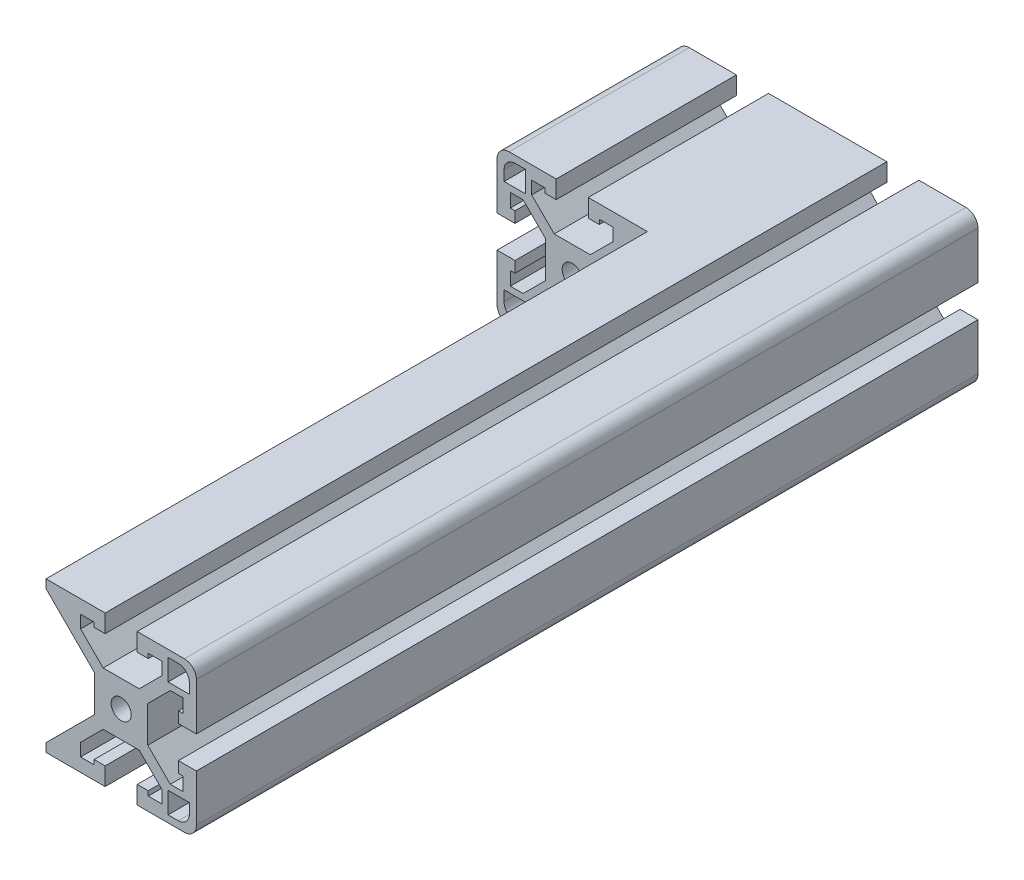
ISO-10303-21;
HEADER;
FILE_DESCRIPTION(('STEP AP214'),'2;1');
FILE_NAME('part.step','',(''),(''),'','','');
FILE_SCHEMA(('AUTOMOTIVE_DESIGN { 1 0 10303 214 1 1 1 1 }'));
ENDSEC;
DATA;
#1=APPLICATION_CONTEXT('core data for automotive mechanical design processes');
#2=APPLICATION_PROTOCOL_DEFINITION('international standard','automotive_design',2000,#1);
#3=PRODUCT_CONTEXT('',#1,'mechanical');
#4=PRODUCT('Part','Part','',(#3));
#5=PRODUCT_RELATED_PRODUCT_CATEGORY('part','',(#4));
#6=PRODUCT_DEFINITION_FORMATION('','',#4);
#7=PRODUCT_DEFINITION_CONTEXT('part definition',#1,'design');
#8=PRODUCT_DEFINITION('design','',#6,#7);
#9=PRODUCT_DEFINITION_SHAPE('','',#8);
#10=(LENGTH_UNIT() NAMED_UNIT(*) SI_UNIT(.MILLI.,.METRE.));
#11=(NAMED_UNIT(*) PLANE_ANGLE_UNIT() SI_UNIT($,.RADIAN.));
#12=(NAMED_UNIT(*) SI_UNIT($,.STERADIAN.) SOLID_ANGLE_UNIT());
#13=UNCERTAINTY_MEASURE_WITH_UNIT(LENGTH_MEASURE(1.E-05),#10,'distance_accuracy_value','');
#14=(GEOMETRIC_REPRESENTATION_CONTEXT(3) GLOBAL_UNCERTAINTY_ASSIGNED_CONTEXT((#13)) GLOBAL_UNIT_ASSIGNED_CONTEXT((#10,
#11,#12)) REPRESENTATION_CONTEXT('',''));
#15=CARTESIAN_POINT('',(0.,0.,0.));
#16=DIRECTION('',(0.,0.,1.));
#17=DIRECTION('',(1.,0.,0.));
#18=AXIS2_PLACEMENT_3D('',#15,#16,#17);
#19=CARTESIAN_POINT('',(-23.6257385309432,6.73100000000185,99.0346));
#20=DIRECTION('',(-0.707106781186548,-0.707106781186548,0.));
#21=DIRECTION('',(0.707106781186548,-0.707106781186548,0.));
#22=AXIS2_PLACEMENT_3D('',#19,#20,#21);
#23=PLANE('',#22);
#24=DIRECTION('',(-0.707106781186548,0.707106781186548,0.));
#25=VECTOR('',#24,1.);
#26=CARTESIAN_POINT('',(-23.6257385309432,6.73100000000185,-53.3654));
#27=LINE('',#26,#25);
#28=CARTESIAN_POINT('',(-23.6257385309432,6.73100000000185,-53.3654));
#29=VERTEX_POINT('',#28);
#30=CARTESIAN_POINT('',(-29.3369999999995,12.4422614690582,-53.3654));
#31=VERTEX_POINT('',#30);
#32=EDGE_CURVE('E854',#29,#31,#27,.T.);
#33=ORIENTED_EDGE('',*,*,#32,.F.);
#34=DIRECTION('',(0.,0.,-1.));
#35=VECTOR('',#34,1.);
#36=CARTESIAN_POINT('',(-23.6257385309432,6.73100000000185,99.0346));
#37=LINE('',#36,#35);
#38=CARTESIAN_POINT('',(-23.6257385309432,6.73100000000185,-99.0346));
#39=VERTEX_POINT('',#38);
#40=EDGE_CURVE('E1191',#29,#39,#37,.T.);
#41=ORIENTED_EDGE('',*,*,#40,.T.);
#42=DIRECTION('',(-0.707106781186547,0.707106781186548,0.));
#43=VECTOR('',#42,1.);
#44=CARTESIAN_POINT('',(-23.6257385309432,6.73100000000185,-99.0346));
#45=LINE('',#44,#43);
#46=CARTESIAN_POINT('',(-29.3369999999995,12.4422614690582,-99.0346));
#47=VERTEX_POINT('',#46);
#48=EDGE_CURVE('E1095',#39,#47,#45,.T.);
#49=ORIENTED_EDGE('',*,*,#48,.T.);
#50=DIRECTION('',(0.,0.,-1.));
#51=VECTOR('',#50,1.);
#52=CARTESIAN_POINT('',(-29.3369999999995,12.4422614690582,99.0346));
#53=LINE('',#52,#51);
#54=EDGE_CURVE('E40',#31,#47,#53,.T.);
#55=ORIENTED_EDGE('',*,*,#54,.F.);
#56=EDGE_LOOP('',(#33,#41,#49,#55));
#57=FACE_BOUND('',#56,.T.);
#58=ADVANCED_FACE('F33',(#57),#23,.F.);
#59=CARTESIAN_POINT('',(-29.3369999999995,12.4422614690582,99.0346));
#60=DIRECTION('',(-1.,0.,0.));
#61=DIRECTION('',(0.,0.,1.));
#62=AXIS2_PLACEMENT_3D('',#59,#60,#61);
#63=PLANE('',#62);
#64=DIRECTION('',(0.,1.,0.));
#65=VECTOR('',#64,1.);
#66=CARTESIAN_POINT('',(-29.3369999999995,12.4422614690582,-53.3654));
#67=LINE('',#66,#65);
#68=CARTESIAN_POINT('',(-29.3369999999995,15.6718000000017,-53.3654));
#69=VERTEX_POINT('',#68);
#70=EDGE_CURVE('E856',#31,#69,#67,.T.);
#71=ORIENTED_EDGE('',*,*,#70,.F.);
#72=ORIENTED_EDGE('',*,*,#54,.T.);
#73=DIRECTION('',(0.,1.,0.));
#74=VECTOR('',#73,1.);
#75=CARTESIAN_POINT('',(-29.3369999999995,12.4422614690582,-99.0346));
#76=LINE('',#75,#74);
#77=CARTESIAN_POINT('',(-29.3369999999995,15.6718000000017,-99.0346));
#78=VERTEX_POINT('',#77);
#79=EDGE_CURVE('E1194',#47,#78,#76,.T.);
#80=ORIENTED_EDGE('',*,*,#79,.T.);
#81=DIRECTION('',(0.,0.,-1.));
#82=VECTOR('',#81,1.);
#83=CARTESIAN_POINT('',(-29.3369999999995,15.6718000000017,99.0346));
#84=LINE('',#83,#82);
#85=EDGE_CURVE('E1645',#69,#78,#84,.T.);
#86=ORIENTED_EDGE('',*,*,#85,.F.);
#87=EDGE_LOOP('',(#71,#72,#80,#86));
#88=FACE_BOUND('',#87,.T.);
#89=ADVANCED_FACE('F1650',(#88),#63,.F.);
#90=CARTESIAN_POINT('',(-29.3369999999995,15.6718000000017,99.0346));
#91=DIRECTION('',(0.,1.,0.));
#92=DIRECTION('',(0.,0.,1.));
#93=AXIS2_PLACEMENT_3D('',#90,#91,#92);
#94=PLANE('',#93);
#95=DIRECTION('',(1.,0.,0.));
#96=VECTOR('',#95,1.);
#97=CARTESIAN_POINT('',(-29.3369999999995,15.6718000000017,-53.3654));
#98=LINE('',#97,#96);
#99=CARTESIAN_POINT('',(-25.9079999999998,15.6718000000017,-53.3654));
#100=VERTEX_POINT('',#99);
#101=EDGE_CURVE('E858',#69,#100,#98,.T.);
#102=ORIENTED_EDGE('',*,*,#101,.F.);
#103=ORIENTED_EDGE('',*,*,#85,.T.);
#104=DIRECTION('',(1.,0.,0.));
#105=VECTOR('',#104,1.);
#106=CARTESIAN_POINT('',(-29.3369999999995,15.6718000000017,-99.0346));
#107=LINE('',#106,#105);
#108=CARTESIAN_POINT('',(-25.9079999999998,15.6718000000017,-99.0346));
#109=VERTEX_POINT('',#108);
#110=EDGE_CURVE('E1197',#78,#109,#107,.T.);
#111=ORIENTED_EDGE('',*,*,#110,.T.);
#112=DIRECTION('',(0.,0.,-1.));
#113=VECTOR('',#112,1.);
#114=CARTESIAN_POINT('',(-25.9079999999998,15.6718000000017,99.0346));
#115=LINE('',#114,#113);
#116=EDGE_CURVE('E1643',#100,#109,#115,.T.);
#117=ORIENTED_EDGE('',*,*,#116,.F.);
#118=EDGE_LOOP('',(#102,#103,#111,#117));
#119=FACE_BOUND('',#118,.T.);
#120=ADVANCED_FACE('F2102',(#119),#94,.F.);
#121=CARTESIAN_POINT('',(-25.9079999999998,15.6718000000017,99.0346));
#122=DIRECTION('',(1.,0.,0.));
#123=DIRECTION('',(0.,0.,-1.));
#124=AXIS2_PLACEMENT_3D('',#121,#122,#123);
#125=PLANE('',#124);
#126=DIRECTION('',(0.,-1.,0.));
#127=VECTOR('',#126,1.);
#128=CARTESIAN_POINT('',(-25.9079999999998,15.6718000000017,-53.3654));
#129=LINE('',#128,#127);
#130=CARTESIAN_POINT('',(-25.9079999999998,14.5034000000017,-53.3654));
#131=VERTEX_POINT('',#130);
#132=EDGE_CURVE('E860',#100,#131,#129,.T.);
#133=ORIENTED_EDGE('',*,*,#132,.F.);
#134=ORIENTED_EDGE('',*,*,#116,.T.);
#135=DIRECTION('',(0.,-1.,0.));
#136=VECTOR('',#135,1.);
#137=CARTESIAN_POINT('',(-25.9079999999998,15.6718000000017,-99.0346));
#138=LINE('',#137,#136);
#139=CARTESIAN_POINT('',(-25.9079999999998,14.5034000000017,-99.0346));
#140=VERTEX_POINT('',#139);
#141=EDGE_CURVE('E1200',#109,#140,#138,.T.);
#142=ORIENTED_EDGE('',*,*,#141,.T.);
#143=DIRECTION('',(0.,0.,-1.));
#144=VECTOR('',#143,1.);
#145=CARTESIAN_POINT('',(-25.9079999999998,14.5034000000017,99.0346));
#146=LINE('',#145,#144);
#147=EDGE_CURVE('E1641',#131,#140,#146,.T.);
#148=ORIENTED_EDGE('',*,*,#147,.F.);
#149=EDGE_LOOP('',(#133,#134,#142,#148));
#150=FACE_BOUND('',#149,.T.);
#151=ADVANCED_FACE('F2098',(#150),#125,.F.);
#152=CARTESIAN_POINT('',(-25.9079999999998,14.5034000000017,99.0346));
#153=DIRECTION('',(0.,1.,0.));
#154=DIRECTION('',(0.,0.,1.));
#155=AXIS2_PLACEMENT_3D('',#152,#153,#154);
#156=PLANE('',#155);
#157=DIRECTION('',(1.,0.,0.));
#158=VECTOR('',#157,1.);
#159=CARTESIAN_POINT('',(-25.9079999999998,14.5034000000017,-53.3654));
#160=LINE('',#159,#158);
#161=CARTESIAN_POINT('',(-23.1139999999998,14.5034000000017,-53.3654));
#162=VERTEX_POINT('',#161);
#163=EDGE_CURVE('E862',#131,#162,#160,.T.);
#164=ORIENTED_EDGE('',*,*,#163,.F.);
#165=ORIENTED_EDGE('',*,*,#147,.T.);
#166=DIRECTION('',(1.,0.,0.));
#167=VECTOR('',#166,1.);
#168=CARTESIAN_POINT('',(-25.9079999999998,14.5034000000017,-99.0346));
#169=LINE('',#168,#167);
#170=CARTESIAN_POINT('',(-23.1139999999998,14.5034000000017,-99.0346));
#171=VERTEX_POINT('',#170);
#172=EDGE_CURVE('E1203',#140,#171,#169,.T.);
#173=ORIENTED_EDGE('',*,*,#172,.T.);
#174=DIRECTION('',(0.,0.,-1.));
#175=VECTOR('',#174,1.);
#176=CARTESIAN_POINT('',(-23.1139999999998,14.5034000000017,99.0346));
#177=LINE('',#176,#175);
#178=EDGE_CURVE('E1639',#162,#171,#177,.T.);
#179=ORIENTED_EDGE('',*,*,#178,.F.);
#180=EDGE_LOOP('',(#164,#165,#173,#179));
#181=FACE_BOUND('',#180,.T.);
#182=ADVANCED_FACE('F2094',(#181),#156,.F.);
#183=CARTESIAN_POINT('',(-23.1139999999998,14.5034000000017,99.0346));
#184=DIRECTION('',(-1.,0.,0.));
#185=DIRECTION('',(0.,0.,1.));
#186=AXIS2_PLACEMENT_3D('',#183,#184,#185);
#187=PLANE('',#186);
#188=DIRECTION('',(0.,1.,0.));
#189=VECTOR('',#188,1.);
#190=CARTESIAN_POINT('',(-23.1139999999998,14.5034000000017,-53.3654));
#191=LINE('',#190,#189);
#192=CARTESIAN_POINT('',(-23.1139999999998,19.0500000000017,-53.3654));
#193=VERTEX_POINT('',#192);
#194=EDGE_CURVE('E864',#162,#193,#191,.T.);
#195=ORIENTED_EDGE('',*,*,#194,.F.);
#196=ORIENTED_EDGE('',*,*,#178,.T.);
#197=DIRECTION('',(0.,1.,0.));
#198=VECTOR('',#197,1.);
#199=CARTESIAN_POINT('',(-23.1139999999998,14.5034000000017,-99.0346));
#200=LINE('',#199,#198);
#201=CARTESIAN_POINT('',(-23.1139999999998,19.0500000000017,-99.0346));
#202=VERTEX_POINT('',#201);
#203=EDGE_CURVE('E1206',#171,#202,#200,.T.);
#204=ORIENTED_EDGE('',*,*,#203,.T.);
#205=DIRECTION('',(0.,0.,-1.));
#206=VECTOR('',#205,1.);
#207=CARTESIAN_POINT('',(-23.1139999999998,19.0500000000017,99.0346));
#208=LINE('',#207,#206);
#209=EDGE_CURVE('E1637',#193,#202,#208,.T.);
#210=ORIENTED_EDGE('',*,*,#209,.F.);
#211=EDGE_LOOP('',(#195,#196,#204,#210));
#212=FACE_BOUND('',#211,.T.);
#213=ADVANCED_FACE('F2090',(#212),#187,.F.);
#214=CARTESIAN_POINT('',(-23.1139999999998,19.0500000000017,99.0346));
#215=DIRECTION('',(0.,-1.,0.));
#216=DIRECTION('',(0.,0.,-1.));
#217=AXIS2_PLACEMENT_3D('',#214,#215,#216);
#218=PLANE('',#217);
#219=DIRECTION('',(-1.,0.,0.));
#220=VECTOR('',#219,1.);
#221=CARTESIAN_POINT('',(-38.0999999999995,19.0500000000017,-53.3654));
#222=LINE('',#221,#220);
#223=CARTESIAN_POINT('',(-35.0519999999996,19.0500000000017,-53.3654));
#224=VERTEX_POINT('',#223);
#225=EDGE_CURVE('E792',#193,#224,#222,.T.);
#226=ORIENTED_EDGE('',*,*,#225,.F.);
#227=ORIENTED_EDGE('',*,*,#209,.T.);
#228=DIRECTION('',(-1.,0.,0.));
#229=VECTOR('',#228,1.);
#230=CARTESIAN_POINT('',(-23.1139999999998,19.0500000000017,-99.0346));
#231=LINE('',#230,#229);
#232=CARTESIAN_POINT('',(-35.0519999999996,19.0500000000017,-99.0346));
#233=VERTEX_POINT('',#232);
#234=EDGE_CURVE('E1209',#202,#233,#231,.T.);
#235=ORIENTED_EDGE('',*,*,#234,.T.);
#236=DIRECTION('',(0.,0.,-1.));
#237=VECTOR('',#236,1.);
#238=CARTESIAN_POINT('',(-35.0519999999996,19.0500000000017,99.0346));
#239=LINE('',#238,#237);
#240=EDGE_CURVE('E1635',#224,#233,#239,.T.);
#241=ORIENTED_EDGE('',*,*,#240,.F.);
#242=EDGE_LOOP('',(#226,#227,#235,#241));
#243=FACE_BOUND('',#242,.T.);
#244=ADVANCED_FACE('F2086',(#243),#218,.F.);
#245=CARTESIAN_POINT('',(-35.0519999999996,16.0020000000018,99.0346));
#246=DIRECTION('',(0.,0.,-1.));
#247=DIRECTION('',(-1.,0.,0.));
#248=AXIS2_PLACEMENT_3D('',#245,#246,#247);
#249=CYLINDRICAL_SURFACE('',#248,3.04799999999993);
#250=CARTESIAN_POINT('',(-35.0519999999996,16.0020000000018,-53.3654));
#251=DIRECTION('',(0.,0.,1.));
#252=DIRECTION('',(1.,0.,0.));
#253=AXIS2_PLACEMENT_3D('',#250,#251,#252);
#254=CIRCLE('',#253,3.04799999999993);
#255=CARTESIAN_POINT('',(-38.0999999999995,16.0020000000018,-53.3654));
#256=VERTEX_POINT('',#255);
#257=EDGE_CURVE('E919',#224,#256,#254,.T.);
#258=ORIENTED_EDGE('',*,*,#257,.F.);
#259=ORIENTED_EDGE('',*,*,#240,.T.);
#260=CARTESIAN_POINT('',(-35.0519999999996,16.0020000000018,-99.0346));
#261=DIRECTION('',(0.,0.,1.));
#262=DIRECTION('',(1.,0.,0.));
#263=AXIS2_PLACEMENT_3D('',#260,#261,#262);
#264=CIRCLE('',#263,3.04799999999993);
#265=CARTESIAN_POINT('',(-38.0999999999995,16.0020000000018,-99.0346));
#266=VERTEX_POINT('',#265);
#267=EDGE_CURVE('E1212',#233,#266,#264,.T.);
#268=ORIENTED_EDGE('',*,*,#267,.T.);
#269=DIRECTION('',(0.,0.,-1.));
#270=VECTOR('',#269,1.);
#271=CARTESIAN_POINT('',(-38.0999999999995,16.0020000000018,99.0346));
#272=LINE('',#271,#270);
#273=EDGE_CURVE('E1633',#256,#266,#272,.T.);
#274=ORIENTED_EDGE('',*,*,#273,.F.);
#275=EDGE_LOOP('',(#258,#259,#268,#274));
#276=FACE_BOUND('',#275,.T.);
#277=ADVANCED_FACE('F2079',(#276),#249,.T.);
#278=CARTESIAN_POINT('',(-38.0999999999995,16.0020000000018,99.0346));
#279=DIRECTION('',(1.,0.,0.));
#280=DIRECTION('',(0.,0.,-1.));
#281=AXIS2_PLACEMENT_3D('',#278,#279,#280);
#282=PLANE('',#281);
#283=DIRECTION('',(0.,-1.,0.));
#284=VECTOR('',#283,1.);
#285=CARTESIAN_POINT('',(-38.0999999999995,19.0500000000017,-53.3654));
#286=LINE('',#285,#284);
#287=CARTESIAN_POINT('',(-38.0999999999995,4.06400000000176,-53.3654));
#288=VERTEX_POINT('',#287);
#289=EDGE_CURVE('E784',#256,#288,#286,.T.);
#290=ORIENTED_EDGE('',*,*,#289,.F.);
#291=ORIENTED_EDGE('',*,*,#273,.T.);
#292=DIRECTION('',(0.,-1.,0.));
#293=VECTOR('',#292,1.);
#294=CARTESIAN_POINT('',(-38.0999999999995,16.0020000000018,-99.0346));
#295=LINE('',#294,#293);
#296=CARTESIAN_POINT('',(-38.0999999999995,4.06400000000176,-99.0346));
#297=VERTEX_POINT('',#296);
#298=EDGE_CURVE('E1215',#266,#297,#295,.T.);
#299=ORIENTED_EDGE('',*,*,#298,.T.);
#300=DIRECTION('',(0.,0.,-1.));
#301=VECTOR('',#300,1.);
#302=CARTESIAN_POINT('',(-38.0999999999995,4.06400000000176,99.0346));
#303=LINE('',#302,#301);
#304=EDGE_CURVE('E1631',#288,#297,#303,.T.);
#305=ORIENTED_EDGE('',*,*,#304,.F.);
#306=EDGE_LOOP('',(#290,#291,#299,#305));
#307=FACE_BOUND('',#306,.T.);
#308=ADVANCED_FACE('F2075',(#307),#282,.F.);
#309=CARTESIAN_POINT('',(-38.0999999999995,4.06400000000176,99.0346));
#310=DIRECTION('',(0.,1.,0.));
#311=DIRECTION('',(0.,0.,1.));
#312=AXIS2_PLACEMENT_3D('',#309,#310,#311);
#313=PLANE('',#312);
#314=DIRECTION('',(1.,0.,0.));
#315=VECTOR('',#314,1.);
#316=CARTESIAN_POINT('',(-38.0999999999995,4.06400000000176,-53.3654));
#317=LINE('',#316,#315);
#318=CARTESIAN_POINT('',(-33.5533999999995,4.06400000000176,-53.3654));
#319=VERTEX_POINT('',#318);
#320=EDGE_CURVE('E917',#288,#319,#317,.T.);
#321=ORIENTED_EDGE('',*,*,#320,.F.);
#322=ORIENTED_EDGE('',*,*,#304,.T.);
#323=DIRECTION('',(1.,0.,0.));
#324=VECTOR('',#323,1.);
#325=CARTESIAN_POINT('',(-38.0999999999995,4.06400000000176,-99.0346));
#326=LINE('',#325,#324);
#327=CARTESIAN_POINT('',(-33.5533999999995,4.06400000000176,-99.0346));
#328=VERTEX_POINT('',#327);
#329=EDGE_CURVE('E1218',#297,#328,#326,.T.);
#330=ORIENTED_EDGE('',*,*,#329,.T.);
#331=DIRECTION('',(0.,0.,-1.));
#332=VECTOR('',#331,1.);
#333=CARTESIAN_POINT('',(-33.5533999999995,4.06400000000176,99.0346));
#334=LINE('',#333,#332);
#335=EDGE_CURVE('E1629',#319,#328,#334,.T.);
#336=ORIENTED_EDGE('',*,*,#335,.F.);
#337=EDGE_LOOP('',(#321,#322,#330,#336));
#338=FACE_BOUND('',#337,.T.);
#339=ADVANCED_FACE('F2071',(#338),#313,.F.);
#340=CARTESIAN_POINT('',(-33.5533999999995,4.06400000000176,99.0346));
#341=DIRECTION('',(-1.,0.,0.));
#342=DIRECTION('',(0.,0.,1.));
#343=AXIS2_PLACEMENT_3D('',#340,#341,#342);
#344=PLANE('',#343);
#345=DIRECTION('',(0.,1.,0.));
#346=VECTOR('',#345,1.);
#347=CARTESIAN_POINT('',(-33.5533999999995,4.06400000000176,-53.3654));
#348=LINE('',#347,#346);
#349=CARTESIAN_POINT('',(-33.5533999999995,6.85800000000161,-53.3654));
#350=VERTEX_POINT('',#349);
#351=EDGE_CURVE('E915',#319,#350,#348,.T.);
#352=ORIENTED_EDGE('',*,*,#351,.F.);
#353=ORIENTED_EDGE('',*,*,#335,.T.);
#354=DIRECTION('',(0.,1.,0.));
#355=VECTOR('',#354,1.);
#356=CARTESIAN_POINT('',(-33.5533999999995,4.06400000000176,-99.0346));
#357=LINE('',#356,#355);
#358=CARTESIAN_POINT('',(-33.5533999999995,6.85800000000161,-99.0346));
#359=VERTEX_POINT('',#358);
#360=EDGE_CURVE('E1221',#328,#359,#357,.T.);
#361=ORIENTED_EDGE('',*,*,#360,.T.);
#362=DIRECTION('',(0.,0.,-1.));
#363=VECTOR('',#362,1.);
#364=CARTESIAN_POINT('',(-33.5533999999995,6.85800000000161,99.0346));
#365=LINE('',#364,#363);
#366=EDGE_CURVE('E1627',#350,#359,#365,.T.);
#367=ORIENTED_EDGE('',*,*,#366,.F.);
#368=EDGE_LOOP('',(#352,#353,#361,#367));
#369=FACE_BOUND('',#368,.T.);
#370=ADVANCED_FACE('F2064',(#369),#344,.F.);
#371=CARTESIAN_POINT('',(-33.5533999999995,6.85800000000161,99.0346));
#372=DIRECTION('',(0.,-1.,0.));
#373=DIRECTION('',(0.,0.,-1.));
#374=AXIS2_PLACEMENT_3D('',#371,#372,#373);
#375=PLANE('',#374);
#376=DIRECTION('',(-1.,0.,0.));
#377=VECTOR('',#376,1.);
#378=CARTESIAN_POINT('',(-33.5533999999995,6.85800000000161,-53.3654));
#379=LINE('',#378,#377);
#380=CARTESIAN_POINT('',(-34.7217999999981,6.85800000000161,-53.3654));
#381=VERTEX_POINT('',#380);
#382=EDGE_CURVE('E913',#350,#381,#379,.T.);
#383=ORIENTED_EDGE('',*,*,#382,.F.);
#384=ORIENTED_EDGE('',*,*,#366,.T.);
#385=DIRECTION('',(-1.,0.,0.));
#386=VECTOR('',#385,1.);
#387=CARTESIAN_POINT('',(-33.5533999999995,6.85800000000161,-99.0346));
#388=LINE('',#387,#386);
#389=CARTESIAN_POINT('',(-34.7217999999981,6.85800000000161,-99.0346));
#390=VERTEX_POINT('',#389);
#391=EDGE_CURVE('E1224',#359,#390,#388,.T.);
#392=ORIENTED_EDGE('',*,*,#391,.T.);
#393=DIRECTION('',(0.,0.,-1.));
#394=VECTOR('',#393,1.);
#395=CARTESIAN_POINT('',(-34.7217999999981,6.85800000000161,99.0346));
#396=LINE('',#395,#394);
#397=EDGE_CURVE('E1625',#381,#390,#396,.T.);
#398=ORIENTED_EDGE('',*,*,#397,.F.);
#399=EDGE_LOOP('',(#383,#384,#392,#398));
#400=FACE_BOUND('',#399,.T.);
#401=ADVANCED_FACE('F2060',(#400),#375,.F.);
#402=CARTESIAN_POINT('',(-34.7217999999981,6.85800000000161,99.0346));
#403=DIRECTION('',(-1.,0.,0.));
#404=DIRECTION('',(0.,0.,1.));
#405=AXIS2_PLACEMENT_3D('',#402,#403,#404);
#406=PLANE('',#405);
#407=DIRECTION('',(0.,1.,0.));
#408=VECTOR('',#407,1.);
#409=CARTESIAN_POINT('',(-34.7217999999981,6.85800000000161,-53.3654));
#410=LINE('',#409,#408);
#411=CARTESIAN_POINT('',(-34.7217999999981,10.2870000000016,-53.3654));
#412=VERTEX_POINT('',#411);
#413=EDGE_CURVE('E911',#381,#412,#410,.T.);
#414=ORIENTED_EDGE('',*,*,#413,.F.);
#415=ORIENTED_EDGE('',*,*,#397,.T.);
#416=DIRECTION('',(0.,1.,0.));
#417=VECTOR('',#416,1.);
#418=CARTESIAN_POINT('',(-34.7217999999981,6.85800000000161,-99.0346));
#419=LINE('',#418,#417);
#420=CARTESIAN_POINT('',(-34.7217999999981,10.2870000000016,-99.0346));
#421=VERTEX_POINT('',#420);
#422=EDGE_CURVE('E1227',#390,#421,#419,.T.);
#423=ORIENTED_EDGE('',*,*,#422,.T.);
#424=DIRECTION('',(0.,0.,-1.));
#425=VECTOR('',#424,1.);
#426=CARTESIAN_POINT('',(-34.7217999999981,10.2870000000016,99.0346));
#427=LINE('',#426,#425);
#428=EDGE_CURVE('E1623',#412,#421,#427,.T.);
#429=ORIENTED_EDGE('',*,*,#428,.F.);
#430=EDGE_LOOP('',(#414,#415,#423,#429));
#431=FACE_BOUND('',#430,.T.);
#432=ADVANCED_FACE('F2056',(#431),#406,.F.);
#433=CARTESIAN_POINT('',(-34.7217999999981,10.2870000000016,99.0346));
#434=DIRECTION('',(0.,1.,0.));
#435=DIRECTION('',(0.,0.,1.));
#436=AXIS2_PLACEMENT_3D('',#433,#434,#435);
#437=PLANE('',#436);
#438=DIRECTION('',(1.,0.,0.));
#439=VECTOR('',#438,1.);
#440=CARTESIAN_POINT('',(-34.7217999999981,10.2870000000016,-53.3654));
#441=LINE('',#440,#439);
#442=CARTESIAN_POINT('',(-31.492261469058,10.2870000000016,-53.3654));
#443=VERTEX_POINT('',#442);
#444=EDGE_CURVE('E909',#412,#443,#441,.T.);
#445=ORIENTED_EDGE('',*,*,#444,.F.);
#446=ORIENTED_EDGE('',*,*,#428,.T.);
#447=DIRECTION('',(1.,0.,0.));
#448=VECTOR('',#447,1.);
#449=CARTESIAN_POINT('',(-34.7217999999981,10.2870000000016,-99.0346));
#450=LINE('',#449,#448);
#451=CARTESIAN_POINT('',(-31.492261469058,10.2870000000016,-99.0346));
#452=VERTEX_POINT('',#451);
#453=EDGE_CURVE('E1230',#421,#452,#450,.T.);
#454=ORIENTED_EDGE('',*,*,#453,.T.);
#455=DIRECTION('',(0.,0.,-1.));
#456=VECTOR('',#455,1.);
#457=CARTESIAN_POINT('',(-31.492261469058,10.2870000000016,99.0346));
#458=LINE('',#457,#456);
#459=EDGE_CURVE('E1621',#443,#452,#458,.T.);
#460=ORIENTED_EDGE('',*,*,#459,.F.);
#461=EDGE_LOOP('',(#445,#446,#454,#460));
#462=FACE_BOUND('',#461,.T.);
#463=ADVANCED_FACE('F2049',(#462),#437,.F.);
#464=CARTESIAN_POINT('',(-31.492261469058,10.2870000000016,99.0346));
#465=DIRECTION('',(0.707106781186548,0.707106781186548,0.));
#466=DIRECTION('',(-0.707106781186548,0.707106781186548,0.));
#467=AXIS2_PLACEMENT_3D('',#464,#465,#466);
#468=PLANE('',#467);
#469=DIRECTION('',(0.707106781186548,-0.707106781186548,0.));
#470=VECTOR('',#469,1.);
#471=CARTESIAN_POINT('',(-31.492261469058,10.2870000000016,-53.3654));
#472=LINE('',#471,#470);
#473=CARTESIAN_POINT('',(-25.7810000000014,4.57573853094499,-53.3654));
#474=VERTEX_POINT('',#473);
#475=EDGE_CURVE('E907',#443,#474,#472,.T.);
#476=ORIENTED_EDGE('',*,*,#475,.F.);
#477=ORIENTED_EDGE('',*,*,#459,.T.);
#478=DIRECTION('',(0.707106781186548,-0.707106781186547,0.));
#479=VECTOR('',#478,1.);
#480=CARTESIAN_POINT('',(-31.492261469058,10.2870000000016,-99.0346));
#481=LINE('',#480,#479);
#482=CARTESIAN_POINT('',(-25.7810000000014,4.57573853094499,-99.0346));
#483=VERTEX_POINT('',#482);
#484=EDGE_CURVE('E1233',#452,#483,#481,.T.);
#485=ORIENTED_EDGE('',*,*,#484,.T.);
#486=DIRECTION('',(0.,0.,-1.));
#487=VECTOR('',#486,1.);
#488=CARTESIAN_POINT('',(-25.7810000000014,4.57573853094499,99.0346));
#489=LINE('',#488,#487);
#490=EDGE_CURVE('E1619',#474,#483,#489,.T.);
#491=ORIENTED_EDGE('',*,*,#490,.F.);
#492=EDGE_LOOP('',(#476,#477,#485,#491));
#493=FACE_BOUND('',#492,.T.);
#494=ADVANCED_FACE('F2045',(#493),#468,.F.);
#495=CARTESIAN_POINT('',(-25.7810000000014,4.57573853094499,99.0346));
#496=DIRECTION('',(1.,0.,0.));
#497=DIRECTION('',(0.,0.,-1.));
#498=AXIS2_PLACEMENT_3D('',#495,#496,#497);
#499=PLANE('',#498);
#500=DIRECTION('',(0.,-1.,0.));
#501=VECTOR('',#500,1.);
#502=CARTESIAN_POINT('',(-25.7810000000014,4.57573853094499,-53.3654));
#503=LINE('',#502,#501);
#504=CARTESIAN_POINT('',(-25.7810000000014,-4.57573853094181,-53.3654));
#505=VERTEX_POINT('',#504);
#506=EDGE_CURVE('E905',#474,#505,#503,.T.);
#507=ORIENTED_EDGE('',*,*,#506,.F.);
#508=ORIENTED_EDGE('',*,*,#490,.T.);
#509=DIRECTION('',(0.,-1.,0.));
#510=VECTOR('',#509,1.);
#511=CARTESIAN_POINT('',(-25.7810000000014,4.57573853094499,-99.0346));
#512=LINE('',#511,#510);
#513=CARTESIAN_POINT('',(-25.7810000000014,-4.57573853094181,-99.0346));
#514=VERTEX_POINT('',#513);
#515=EDGE_CURVE('E1236',#483,#514,#512,.T.);
#516=ORIENTED_EDGE('',*,*,#515,.T.);
#517=DIRECTION('',(0.,0.,-1.));
#518=VECTOR('',#517,1.);
#519=CARTESIAN_POINT('',(-25.7810000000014,-4.57573853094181,99.0346));
#520=LINE('',#519,#518);
#521=EDGE_CURVE('E1617',#505,#514,#520,.T.);
#522=ORIENTED_EDGE('',*,*,#521,.F.);
#523=EDGE_LOOP('',(#507,#508,#516,#522));
#524=FACE_BOUND('',#523,.T.);
#525=ADVANCED_FACE('F2041',(#524),#499,.F.);
#526=CARTESIAN_POINT('',(-25.7810000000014,-4.57573853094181,99.0346));
#527=DIRECTION('',(0.707106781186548,-0.707106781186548,0.));
#528=DIRECTION('',(0.707106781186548,0.707106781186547,0.));
#529=AXIS2_PLACEMENT_3D('',#526,#527,#528);
#530=PLANE('',#529);
#531=DIRECTION('',(-0.707106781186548,-0.707106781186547,0.));
#532=VECTOR('',#531,1.);
#533=CARTESIAN_POINT('',(-25.7810000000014,-4.57573853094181,-53.3654));
#534=LINE('',#533,#532);
#535=CARTESIAN_POINT('',(-31.492261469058,-10.2869999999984,-53.3654));
#536=VERTEX_POINT('',#535);
#537=EDGE_CURVE('E903',#505,#536,#534,.T.);
#538=ORIENTED_EDGE('',*,*,#537,.F.);
#539=ORIENTED_EDGE('',*,*,#521,.T.);
#540=DIRECTION('',(-0.707106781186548,-0.707106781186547,0.));
#541=VECTOR('',#540,1.);
#542=CARTESIAN_POINT('',(-25.7810000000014,-4.57573853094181,-99.0346));
#543=LINE('',#542,#541);
#544=CARTESIAN_POINT('',(-31.492261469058,-10.2869999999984,-99.0346));
#545=VERTEX_POINT('',#544);
#546=EDGE_CURVE('E1239',#514,#545,#543,.T.);
#547=ORIENTED_EDGE('',*,*,#546,.T.);
#548=DIRECTION('',(0.,0.,-1.));
#549=VECTOR('',#548,1.);
#550=CARTESIAN_POINT('',(-31.492261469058,-10.2869999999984,99.0346));
#551=LINE('',#550,#549);
#552=EDGE_CURVE('E1615',#536,#545,#551,.T.);
#553=ORIENTED_EDGE('',*,*,#552,.F.);
#554=EDGE_LOOP('',(#538,#539,#547,#553));
#555=FACE_BOUND('',#554,.T.);
#556=ADVANCED_FACE('F2034',(#555),#530,.F.);
#557=CARTESIAN_POINT('',(-31.492261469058,-10.2869999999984,99.0346));
#558=DIRECTION('',(0.,-1.,0.));
#559=DIRECTION('',(1.,0.,0.));
#560=AXIS2_PLACEMENT_3D('',#557,#558,#559);
#561=PLANE('',#560);
#562=DIRECTION('',(-1.,0.,0.));
#563=VECTOR('',#562,1.);
#564=CARTESIAN_POINT('',(-31.492261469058,-10.2869999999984,-53.3654));
#565=LINE('',#564,#563);
#566=CARTESIAN_POINT('',(-34.7217999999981,-10.2869999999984,-53.3654));
#567=VERTEX_POINT('',#566);
#568=EDGE_CURVE('E901',#536,#567,#565,.T.);
#569=ORIENTED_EDGE('',*,*,#568,.F.);
#570=ORIENTED_EDGE('',*,*,#552,.T.);
#571=DIRECTION('',(-1.,0.,0.));
#572=VECTOR('',#571,1.);
#573=CARTESIAN_POINT('',(-31.492261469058,-10.2869999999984,-99.0346));
#574=LINE('',#573,#572);
#575=CARTESIAN_POINT('',(-34.7217999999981,-10.2869999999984,-99.0346));
#576=VERTEX_POINT('',#575);
#577=EDGE_CURVE('E1242',#545,#576,#574,.T.);
#578=ORIENTED_EDGE('',*,*,#577,.T.);
#579=DIRECTION('',(0.,0.,-1.));
#580=VECTOR('',#579,1.);
#581=CARTESIAN_POINT('',(-34.7217999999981,-10.2869999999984,99.0346));
#582=LINE('',#581,#580);
#583=EDGE_CURVE('E1613',#567,#576,#582,.T.);
#584=ORIENTED_EDGE('',*,*,#583,.F.);
#585=EDGE_LOOP('',(#569,#570,#578,#584));
#586=FACE_BOUND('',#585,.T.);
#587=ADVANCED_FACE('F2030',(#586),#561,.F.);
#588=CARTESIAN_POINT('',(-34.7217999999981,-10.2869999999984,99.0346));
#589=DIRECTION('',(-1.,0.,0.));
#590=DIRECTION('',(0.,-1.,0.));
#591=AXIS2_PLACEMENT_3D('',#588,#589,#590);
#592=PLANE('',#591);
#593=DIRECTION('',(0.,1.,0.));
#594=VECTOR('',#593,1.);
#595=CARTESIAN_POINT('',(-34.7217999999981,-10.2869999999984,-53.3654));
#596=LINE('',#595,#594);
#597=CARTESIAN_POINT('',(-34.7217999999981,-6.85799999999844,-53.3654));
#598=VERTEX_POINT('',#597);
#599=EDGE_CURVE('E899',#567,#598,#596,.T.);
#600=ORIENTED_EDGE('',*,*,#599,.F.);
#601=ORIENTED_EDGE('',*,*,#583,.T.);
#602=DIRECTION('',(0.,1.,0.));
#603=VECTOR('',#602,1.);
#604=CARTESIAN_POINT('',(-34.7217999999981,-10.2869999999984,-99.0346));
#605=LINE('',#604,#603);
#606=CARTESIAN_POINT('',(-34.7217999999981,-6.85799999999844,-99.0346));
#607=VERTEX_POINT('',#606);
#608=EDGE_CURVE('E1245',#576,#607,#605,.T.);
#609=ORIENTED_EDGE('',*,*,#608,.T.);
#610=DIRECTION('',(0.,0.,-1.));
#611=VECTOR('',#610,1.);
#612=CARTESIAN_POINT('',(-34.7217999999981,-6.85799999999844,99.0346));
#613=LINE('',#612,#611);
#614=EDGE_CURVE('E1611',#598,#607,#613,.T.);
#615=ORIENTED_EDGE('',*,*,#614,.F.);
#616=EDGE_LOOP('',(#600,#601,#609,#615));
#617=FACE_BOUND('',#616,.T.);
#618=ADVANCED_FACE('F2026',(#617),#592,.F.);
#619=CARTESIAN_POINT('',(-34.7217999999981,-6.85799999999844,99.0346));
#620=DIRECTION('',(0.,1.,0.));
#621=DIRECTION('',(-1.,0.,0.));
#622=AXIS2_PLACEMENT_3D('',#619,#620,#621);
#623=PLANE('',#622);
#624=DIRECTION('',(1.,0.,0.));
#625=VECTOR('',#624,1.);
#626=CARTESIAN_POINT('',(-34.7217999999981,-6.85799999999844,-53.3654));
#627=LINE('',#626,#625);
#628=CARTESIAN_POINT('',(-33.5533999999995,-6.85799999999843,-53.3654));
#629=VERTEX_POINT('',#628);
#630=EDGE_CURVE('E897',#598,#629,#627,.T.);
#631=ORIENTED_EDGE('',*,*,#630,.F.);
#632=ORIENTED_EDGE('',*,*,#614,.T.);
#633=DIRECTION('',(1.,0.,0.));
#634=VECTOR('',#633,1.);
#635=CARTESIAN_POINT('',(-34.7217999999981,-6.85799999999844,-99.0346));
#636=LINE('',#635,#634);
#637=CARTESIAN_POINT('',(-33.5533999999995,-6.85799999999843,-99.0346));
#638=VERTEX_POINT('',#637);
#639=EDGE_CURVE('E1248',#607,#638,#636,.T.);
#640=ORIENTED_EDGE('',*,*,#639,.T.);
#641=DIRECTION('',(0.,0.,-1.));
#642=VECTOR('',#641,1.);
#643=CARTESIAN_POINT('',(-33.5533999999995,-6.85799999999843,99.0346));
#644=LINE('',#643,#642);
#645=EDGE_CURVE('E1609',#629,#638,#644,.T.);
#646=ORIENTED_EDGE('',*,*,#645,.F.);
#647=EDGE_LOOP('',(#631,#632,#640,#646));
#648=FACE_BOUND('',#647,.T.);
#649=ADVANCED_FACE('F2019',(#648),#623,.F.);
#650=CARTESIAN_POINT('',(-33.5533999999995,-6.85799999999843,99.0346));
#651=DIRECTION('',(-1.,0.,0.));
#652=DIRECTION('',(0.,0.,1.));
#653=AXIS2_PLACEMENT_3D('',#650,#651,#652);
#654=PLANE('',#653);
#655=DIRECTION('',(0.,1.,0.));
#656=VECTOR('',#655,1.);
#657=CARTESIAN_POINT('',(-33.5533999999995,-6.85799999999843,-53.3654));
#658=LINE('',#657,#656);
#659=CARTESIAN_POINT('',(-33.5533999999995,-4.06399999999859,-53.3654));
#660=VERTEX_POINT('',#659);
#661=EDGE_CURVE('E895',#629,#660,#658,.T.);
#662=ORIENTED_EDGE('',*,*,#661,.F.);
#663=ORIENTED_EDGE('',*,*,#645,.T.);
#664=DIRECTION('',(0.,1.,0.));
#665=VECTOR('',#664,1.);
#666=CARTESIAN_POINT('',(-33.5533999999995,-6.85799999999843,-99.0346));
#667=LINE('',#666,#665);
#668=CARTESIAN_POINT('',(-33.5533999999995,-4.06399999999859,-99.0346));
#669=VERTEX_POINT('',#668);
#670=EDGE_CURVE('E1251',#638,#669,#667,.T.);
#671=ORIENTED_EDGE('',*,*,#670,.T.);
#672=DIRECTION('',(0.,0.,-1.));
#673=VECTOR('',#672,1.);
#674=CARTESIAN_POINT('',(-33.5533999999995,-4.06399999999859,99.0346));
#675=LINE('',#674,#673);
#676=EDGE_CURVE('E1607',#660,#669,#675,.T.);
#677=ORIENTED_EDGE('',*,*,#676,.F.);
#678=EDGE_LOOP('',(#662,#663,#671,#677));
#679=FACE_BOUND('',#678,.T.);
#680=ADVANCED_FACE('F2015',(#679),#654,.F.);
#681=CARTESIAN_POINT('',(-33.5533999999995,-4.06399999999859,99.0346));
#682=DIRECTION('',(0.,-1.,0.));
#683=DIRECTION('',(1.,0.,0.));
#684=AXIS2_PLACEMENT_3D('',#681,#682,#683);
#685=PLANE('',#684);
#686=DIRECTION('',(-1.,0.,0.));
#687=VECTOR('',#686,1.);
#688=CARTESIAN_POINT('',(-33.5533999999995,-4.06399999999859,-53.3654));
#689=LINE('',#688,#687);
#690=CARTESIAN_POINT('',(-38.0999999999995,-4.06399999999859,-53.3654));
#691=VERTEX_POINT('',#690);
#692=EDGE_CURVE('E893',#660,#691,#689,.T.);
#693=ORIENTED_EDGE('',*,*,#692,.F.);
#694=ORIENTED_EDGE('',*,*,#676,.T.);
#695=DIRECTION('',(-1.,0.,0.));
#696=VECTOR('',#695,1.);
#697=CARTESIAN_POINT('',(-33.5533999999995,-4.06399999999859,-99.0346));
#698=LINE('',#697,#696);
#699=CARTESIAN_POINT('',(-38.0999999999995,-4.06399999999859,-99.0346));
#700=VERTEX_POINT('',#699);
#701=EDGE_CURVE('E1254',#669,#700,#698,.T.);
#702=ORIENTED_EDGE('',*,*,#701,.T.);
#703=DIRECTION('',(0.,0.,-1.));
#704=VECTOR('',#703,1.);
#705=CARTESIAN_POINT('',(-38.0999999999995,-4.06399999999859,99.0346));
#706=LINE('',#705,#704);
#707=EDGE_CURVE('E1605',#691,#700,#706,.T.);
#708=ORIENTED_EDGE('',*,*,#707,.F.);
#709=EDGE_LOOP('',(#693,#694,#702,#708));
#710=FACE_BOUND('',#709,.T.);
#711=ADVANCED_FACE('F2011',(#710),#685,.F.);
#712=CARTESIAN_POINT('',(-38.0999999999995,-4.06399999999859,99.0346));
#713=DIRECTION('',(1.,0.,0.));
#714=DIRECTION('',(0.,0.,-1.));
#715=AXIS2_PLACEMENT_3D('',#712,#713,#714);
#716=PLANE('',#715);
#717=CARTESIAN_POINT('',(-38.0999999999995,-16.0019999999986,-53.3654));
#718=VERTEX_POINT('',#717);
#719=EDGE_CURVE('E2115',#691,#718,#286,.T.);
#720=ORIENTED_EDGE('',*,*,#719,.F.);
#721=ORIENTED_EDGE('',*,*,#707,.T.);
#722=DIRECTION('',(0.,-1.,0.));
#723=VECTOR('',#722,1.);
#724=CARTESIAN_POINT('',(-38.0999999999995,-4.06399999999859,-99.0346));
#725=LINE('',#724,#723);
#726=CARTESIAN_POINT('',(-38.0999999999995,-16.0019999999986,-99.0346));
#727=VERTEX_POINT('',#726);
#728=EDGE_CURVE('E1257',#700,#727,#725,.T.);
#729=ORIENTED_EDGE('',*,*,#728,.T.);
#730=DIRECTION('',(0.,0.,-1.));
#731=VECTOR('',#730,1.);
#732=CARTESIAN_POINT('',(-38.0999999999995,-16.0019999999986,99.0346));
#733=LINE('',#732,#731);
#734=EDGE_CURVE('E1603',#718,#727,#733,.T.);
#735=ORIENTED_EDGE('',*,*,#734,.F.);
#736=EDGE_LOOP('',(#720,#721,#729,#735));
#737=FACE_BOUND('',#736,.T.);
#738=ADVANCED_FACE('F2004',(#737),#716,.F.);
#739=CARTESIAN_POINT('',(-35.0519999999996,-16.0019999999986,99.0346));
#740=DIRECTION('',(0.,0.,-1.));
#741=DIRECTION('',(-1.,0.,0.));
#742=AXIS2_PLACEMENT_3D('',#739,#740,#741);
#743=CYLINDRICAL_SURFACE('',#742,3.04799999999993);
#744=CARTESIAN_POINT('',(-35.0519999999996,-16.0019999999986,-53.3654));
#745=DIRECTION('',(0.,0.,1.));
#746=DIRECTION('',(1.,0.,0.));
#747=AXIS2_PLACEMENT_3D('',#744,#745,#746);
#748=CIRCLE('',#747,3.04799999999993);
#749=CARTESIAN_POINT('',(-35.0519999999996,-19.0499999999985,-53.3654));
#750=VERTEX_POINT('',#749);
#751=EDGE_CURVE('E891',#718,#750,#748,.T.);
#752=ORIENTED_EDGE('',*,*,#751,.F.);
#753=ORIENTED_EDGE('',*,*,#734,.T.);
#754=CARTESIAN_POINT('',(-35.0519999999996,-16.0019999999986,-99.0346));
#755=DIRECTION('',(0.,0.,1.));
#756=DIRECTION('',(1.,0.,0.));
#757=AXIS2_PLACEMENT_3D('',#754,#755,#756);
#758=CIRCLE('',#757,3.04799999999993);
#759=CARTESIAN_POINT('',(-35.0519999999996,-19.0499999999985,-99.0346));
#760=VERTEX_POINT('',#759);
#761=EDGE_CURVE('E1260',#727,#760,#758,.T.);
#762=ORIENTED_EDGE('',*,*,#761,.T.);
#763=DIRECTION('',(0.,0.,-1.));
#764=VECTOR('',#763,1.);
#765=CARTESIAN_POINT('',(-35.0519999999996,-19.0499999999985,99.0346));
#766=LINE('',#765,#764);
#767=EDGE_CURVE('E1601',#750,#760,#766,.T.);
#768=ORIENTED_EDGE('',*,*,#767,.F.);
#769=EDGE_LOOP('',(#752,#753,#762,#768));
#770=FACE_BOUND('',#769,.T.);
#771=ADVANCED_FACE('F2000',(#770),#743,.T.);
#772=CARTESIAN_POINT('',(-35.0519999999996,-19.0499999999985,99.0346));
#773=DIRECTION('',(0.,1.,0.));
#774=DIRECTION('',(-1.,0.,0.));
#775=AXIS2_PLACEMENT_3D('',#772,#773,#774);
#776=PLANE('',#775);
#777=DIRECTION('',(1.,0.,0.));
#778=VECTOR('',#777,1.);
#779=CARTESIAN_POINT('',(-38.0999999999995,-19.0499999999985,-53.3654));
#780=LINE('',#779,#778);
#781=CARTESIAN_POINT('',(-23.1139999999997,-19.0499999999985,-53.3654));
#782=VERTEX_POINT('',#781);
#783=EDGE_CURVE('E783',#750,#782,#780,.T.);
#784=ORIENTED_EDGE('',*,*,#783,.F.);
#785=ORIENTED_EDGE('',*,*,#767,.T.);
#786=DIRECTION('',(1.,0.,0.));
#787=VECTOR('',#786,1.);
#788=CARTESIAN_POINT('',(-35.0519999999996,-19.0499999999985,-99.0346));
#789=LINE('',#788,#787);
#790=CARTESIAN_POINT('',(-23.1139999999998,-19.0499999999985,-99.0346));
#791=VERTEX_POINT('',#790);
#792=EDGE_CURVE('E1263',#760,#791,#789,.T.);
#793=ORIENTED_EDGE('',*,*,#792,.T.);
#794=DIRECTION('',(0.,0.,-1.));
#795=VECTOR('',#794,1.);
#796=CARTESIAN_POINT('',(-23.1139999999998,-19.0499999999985,99.0346));
#797=LINE('',#796,#795);
#798=EDGE_CURVE('E1599',#782,#791,#797,.T.);
#799=ORIENTED_EDGE('',*,*,#798,.F.);
#800=EDGE_LOOP('',(#784,#785,#793,#799));
#801=FACE_BOUND('',#800,.T.);
#802=ADVANCED_FACE('F1996',(#801),#776,.F.);
#803=CARTESIAN_POINT('',(-23.1139999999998,-19.0499999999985,99.0346));
#804=DIRECTION('',(-1.,0.,0.));
#805=DIRECTION('',(0.,-1.,0.));
#806=AXIS2_PLACEMENT_3D('',#803,#804,#805);
#807=PLANE('',#806);
#808=DIRECTION('',(0.,1.,0.));
#809=VECTOR('',#808,1.);
#810=CARTESIAN_POINT('',(-23.1139999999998,-19.0499999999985,-53.3654));
#811=LINE('',#810,#809);
#812=CARTESIAN_POINT('',(-23.1139999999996,-14.5033999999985,-53.3654));
#813=VERTEX_POINT('',#812);
#814=EDGE_CURVE('E889',#782,#813,#811,.T.);
#815=ORIENTED_EDGE('',*,*,#814,.F.);
#816=ORIENTED_EDGE('',*,*,#798,.T.);
#817=DIRECTION('',(0.,1.,0.));
#818=VECTOR('',#817,1.);
#819=CARTESIAN_POINT('',(-23.1139999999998,-19.0499999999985,-99.0346));
#820=LINE('',#819,#818);
#821=CARTESIAN_POINT('',(-23.1139999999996,-14.5033999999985,-99.0346));
#822=VERTEX_POINT('',#821);
#823=EDGE_CURVE('E1266',#791,#822,#820,.T.);
#824=ORIENTED_EDGE('',*,*,#823,.T.);
#825=DIRECTION('',(0.,0.,-1.));
#826=VECTOR('',#825,1.);
#827=CARTESIAN_POINT('',(-23.1139999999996,-14.5033999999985,99.0346));
#828=LINE('',#827,#826);
#829=EDGE_CURVE('E1597',#813,#822,#828,.T.);
#830=ORIENTED_EDGE('',*,*,#829,.F.);
#831=EDGE_LOOP('',(#815,#816,#824,#830));
#832=FACE_BOUND('',#831,.T.);
#833=ADVANCED_FACE('F1989',(#832),#807,.F.);
#834=CARTESIAN_POINT('',(-23.1139999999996,-14.5033999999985,99.0346));
#835=DIRECTION('',(0.,-1.,0.));
#836=DIRECTION('',(0.,0.,-1.));
#837=AXIS2_PLACEMENT_3D('',#834,#835,#836);
#838=PLANE('',#837);
#839=DIRECTION('',(-1.,0.,0.));
#840=VECTOR('',#839,1.);
#841=CARTESIAN_POINT('',(-23.1139999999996,-14.5033999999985,-53.3654));
#842=LINE('',#841,#840);
#843=CARTESIAN_POINT('',(-25.9079999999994,-14.5033999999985,-53.3654));
#844=VERTEX_POINT('',#843);
#845=EDGE_CURVE('E887',#813,#844,#842,.T.);
#846=ORIENTED_EDGE('',*,*,#845,.F.);
#847=ORIENTED_EDGE('',*,*,#829,.T.);
#848=DIRECTION('',(-1.,0.,0.));
#849=VECTOR('',#848,1.);
#850=CARTESIAN_POINT('',(-23.1139999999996,-14.5033999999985,-99.0346));
#851=LINE('',#850,#849);
#852=CARTESIAN_POINT('',(-25.9079999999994,-14.5033999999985,-99.0346));
#853=VERTEX_POINT('',#852);
#854=EDGE_CURVE('E1269',#822,#853,#851,.T.);
#855=ORIENTED_EDGE('',*,*,#854,.T.);
#856=DIRECTION('',(0.,0.,-1.));
#857=VECTOR('',#856,1.);
#858=CARTESIAN_POINT('',(-25.9079999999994,-14.5033999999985,99.0346));
#859=LINE('',#858,#857);
#860=EDGE_CURVE('E1595',#844,#853,#859,.T.);
#861=ORIENTED_EDGE('',*,*,#860,.F.);
#862=EDGE_LOOP('',(#846,#847,#855,#861));
#863=FACE_BOUND('',#862,.T.);
#864=ADVANCED_FACE('F1985',(#863),#838,.F.);
#865=CARTESIAN_POINT('',(-25.9079999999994,-14.5033999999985,99.0346));
#866=DIRECTION('',(1.,0.,0.));
#867=DIRECTION('',(0.,0.,-1.));
#868=AXIS2_PLACEMENT_3D('',#865,#866,#867);
#869=PLANE('',#868);
#870=DIRECTION('',(0.,-1.,0.));
#871=VECTOR('',#870,1.);
#872=CARTESIAN_POINT('',(-25.9079999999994,-14.5033999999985,-53.3654));
#873=LINE('',#872,#871);
#874=CARTESIAN_POINT('',(-25.9079999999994,-15.6717999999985,-53.3654));
#875=VERTEX_POINT('',#874);
#876=EDGE_CURVE('E885',#844,#875,#873,.T.);
#877=ORIENTED_EDGE('',*,*,#876,.F.);
#878=ORIENTED_EDGE('',*,*,#860,.T.);
#879=DIRECTION('',(0.,-1.,0.));
#880=VECTOR('',#879,1.);
#881=CARTESIAN_POINT('',(-25.9079999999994,-14.5033999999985,-99.0346));
#882=LINE('',#881,#880);
#883=CARTESIAN_POINT('',(-25.9079999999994,-15.6717999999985,-99.0346));
#884=VERTEX_POINT('',#883);
#885=EDGE_CURVE('E1272',#853,#884,#882,.T.);
#886=ORIENTED_EDGE('',*,*,#885,.T.);
#887=DIRECTION('',(0.,0.,-1.));
#888=VECTOR('',#887,1.);
#889=CARTESIAN_POINT('',(-25.9079999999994,-15.6717999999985,99.0346));
#890=LINE('',#889,#888);
#891=EDGE_CURVE('E1593',#875,#884,#890,.T.);
#892=ORIENTED_EDGE('',*,*,#891,.F.);
#893=EDGE_LOOP('',(#877,#878,#886,#892));
#894=FACE_BOUND('',#893,.T.);
#895=ADVANCED_FACE('F1981',(#894),#869,.F.);
#896=CARTESIAN_POINT('',(-25.9079999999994,-15.6717999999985,99.0346));
#897=DIRECTION('',(0.,-1.,0.));
#898=DIRECTION('',(0.,0.,-1.));
#899=AXIS2_PLACEMENT_3D('',#896,#897,#898);
#900=PLANE('',#899);
#901=DIRECTION('',(-1.,0.,0.));
#902=VECTOR('',#901,1.);
#903=CARTESIAN_POINT('',(-25.9079999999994,-15.6717999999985,-53.3654));
#904=LINE('',#903,#902);
#905=CARTESIAN_POINT('',(-29.3369999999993,-15.6717999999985,-53.3654));
#906=VERTEX_POINT('',#905);
#907=EDGE_CURVE('E883',#875,#906,#904,.T.);
#908=ORIENTED_EDGE('',*,*,#907,.F.);
#909=ORIENTED_EDGE('',*,*,#891,.T.);
#910=DIRECTION('',(-1.,0.,0.));
#911=VECTOR('',#910,1.);
#912=CARTESIAN_POINT('',(-25.9079999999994,-15.6717999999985,-99.0346));
#913=LINE('',#912,#911);
#914=CARTESIAN_POINT('',(-29.3369999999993,-15.6717999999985,-99.0346));
#915=VERTEX_POINT('',#914);
#916=EDGE_CURVE('E1275',#884,#915,#913,.T.);
#917=ORIENTED_EDGE('',*,*,#916,.T.);
#918=DIRECTION('',(0.,0.,-1.));
#919=VECTOR('',#918,1.);
#920=CARTESIAN_POINT('',(-29.3369999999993,-15.6717999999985,99.0346));
#921=LINE('',#920,#919);
#922=EDGE_CURVE('E1591',#906,#915,#921,.T.);
#923=ORIENTED_EDGE('',*,*,#922,.F.);
#924=EDGE_LOOP('',(#908,#909,#917,#923));
#925=FACE_BOUND('',#924,.T.);
#926=ADVANCED_FACE('F1974',(#925),#900,.F.);
#927=CARTESIAN_POINT('',(-29.3369999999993,-15.6717999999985,99.0346));
#928=DIRECTION('',(-1.,0.,0.));
#929=DIRECTION('',(0.,0.,1.));
#930=AXIS2_PLACEMENT_3D('',#927,#928,#929);
#931=PLANE('',#930);
#932=DIRECTION('',(0.,1.,0.));
#933=VECTOR('',#932,1.);
#934=CARTESIAN_POINT('',(-29.3369999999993,-15.6717999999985,-53.3654));
#935=LINE('',#934,#933);
#936=CARTESIAN_POINT('',(-29.3369999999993,-12.442261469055,-53.3654));
#937=VERTEX_POINT('',#936);
#938=EDGE_CURVE('E881',#906,#937,#935,.T.);
#939=ORIENTED_EDGE('',*,*,#938,.F.);
#940=ORIENTED_EDGE('',*,*,#922,.T.);
#941=DIRECTION('',(0.,1.,0.));
#942=VECTOR('',#941,1.);
#943=CARTESIAN_POINT('',(-29.3369999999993,-15.6717999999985,-99.0346));
#944=LINE('',#943,#942);
#945=CARTESIAN_POINT('',(-29.3369999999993,-12.442261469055,-99.0346));
#946=VERTEX_POINT('',#945);
#947=EDGE_CURVE('E1278',#915,#946,#944,.T.);
#948=ORIENTED_EDGE('',*,*,#947,.T.);
#949=DIRECTION('',(0.,0.,-1.));
#950=VECTOR('',#949,1.);
#951=CARTESIAN_POINT('',(-29.3369999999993,-12.442261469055,99.0346));
#952=LINE('',#951,#950);
#953=EDGE_CURVE('E1589',#937,#946,#952,.T.);
#954=ORIENTED_EDGE('',*,*,#953,.F.);
#955=EDGE_LOOP('',(#939,#940,#948,#954));
#956=FACE_BOUND('',#955,.T.);
#957=ADVANCED_FACE('F1970',(#956),#931,.F.);
#958=CARTESIAN_POINT('',(-29.3369999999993,-12.442261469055,99.0346));
#959=DIRECTION('',(-0.707106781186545,0.70710678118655,0.));
#960=DIRECTION('',(-0.70710678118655,-0.707106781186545,0.));
#961=AXIS2_PLACEMENT_3D('',#958,#959,#960);
#962=PLANE('',#961);
#963=DIRECTION('',(0.70710678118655,0.707106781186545,0.));
#964=VECTOR('',#963,1.);
#965=CARTESIAN_POINT('',(-29.3369999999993,-12.442261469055,-53.3654));
#966=LINE('',#965,#964);
#967=CARTESIAN_POINT('',(-23.6257385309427,-6.73099999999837,-53.3654));
#968=VERTEX_POINT('',#967);
#969=EDGE_CURVE('E879',#937,#968,#966,.T.);
#970=ORIENTED_EDGE('',*,*,#969,.F.);
#971=ORIENTED_EDGE('',*,*,#953,.T.);
#972=DIRECTION('',(0.70710678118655,0.707106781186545,0.));
#973=VECTOR('',#972,1.);
#974=CARTESIAN_POINT('',(-29.3369999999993,-12.442261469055,-99.0346));
#975=LINE('',#974,#973);
#976=CARTESIAN_POINT('',(-23.6257385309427,-6.73099999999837,-99.0346));
#977=VERTEX_POINT('',#976);
#978=EDGE_CURVE('E1281',#946,#977,#975,.T.);
#979=ORIENTED_EDGE('',*,*,#978,.T.);
#980=DIRECTION('',(0.,0.,-1.));
#981=VECTOR('',#980,1.);
#982=CARTESIAN_POINT('',(-23.6257385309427,-6.73099999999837,99.0346));
#983=LINE('',#982,#981);
#984=EDGE_CURVE('E1587',#968,#977,#983,.T.);
#985=ORIENTED_EDGE('',*,*,#984,.F.);
#986=EDGE_LOOP('',(#970,#971,#979,#985));
#987=FACE_BOUND('',#986,.T.);
#988=ADVANCED_FACE('F1966',(#987),#962,.F.);
#989=CARTESIAN_POINT('',(-23.6257385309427,-6.73099999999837,99.0346));
#990=DIRECTION('',(0.,1.,0.));
#991=DIRECTION('',(-1.,0.,0.));
#992=AXIS2_PLACEMENT_3D('',#989,#990,#991);
#993=PLANE('',#992);
#994=DIRECTION('',(1.,0.,0.));
#995=VECTOR('',#994,1.);
#996=CARTESIAN_POINT('',(-23.6257385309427,-6.73099999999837,-53.3654));
#997=LINE('',#996,#995);
#998=CARTESIAN_POINT('',(-14.4742614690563,-6.73099999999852,-53.3654));
#999=VERTEX_POINT('',#998);
#1000=EDGE_CURVE('E877',#968,#999,#997,.T.);
#1001=ORIENTED_EDGE('',*,*,#1000,.F.);
#1002=ORIENTED_EDGE('',*,*,#984,.T.);
#1003=DIRECTION('',(1.,0.,0.));
#1004=VECTOR('',#1003,1.);
#1005=CARTESIAN_POINT('',(-23.6257385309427,-6.73099999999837,-99.0346));
#1006=LINE('',#1005,#1004);
#1007=CARTESIAN_POINT('',(-14.4742614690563,-6.73099999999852,-99.0346));
#1008=VERTEX_POINT('',#1007);
#1009=EDGE_CURVE('E1284',#977,#1008,#1006,.T.);
#1010=ORIENTED_EDGE('',*,*,#1009,.T.);
#1011=DIRECTION('',(0.,0.,-1.));
#1012=VECTOR('',#1011,1.);
#1013=CARTESIAN_POINT('',(-14.4742614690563,-6.73099999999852,99.0346));
#1014=LINE('',#1013,#1012);
#1015=EDGE_CURVE('E1585',#999,#1008,#1014,.T.);
#1016=ORIENTED_EDGE('',*,*,#1015,.F.);
#1017=EDGE_LOOP('',(#1001,#1002,#1010,#1016));
#1018=FACE_BOUND('',#1017,.T.);
#1019=ADVANCED_FACE('F1959',(#1018),#993,.F.);
#1020=CARTESIAN_POINT('',(-14.4742614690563,-6.73099999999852,99.0346));
#1021=DIRECTION('',(0.707106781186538,0.707106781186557,0.));
#1022=DIRECTION('',(-0.707106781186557,0.707106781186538,0.));
#1023=AXIS2_PLACEMENT_3D('',#1020,#1021,#1022);
#1024=PLANE('',#1023);
#1025=DIRECTION('',(0.707106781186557,-0.707106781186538,0.));
#1026=VECTOR('',#1025,1.);
#1027=CARTESIAN_POINT('',(-14.4742614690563,-6.73099999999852,-53.3654));
#1028=LINE('',#1027,#1026);
#1029=CARTESIAN_POINT('',(-8.76299999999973,-12.442261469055,-53.3654));
#1030=VERTEX_POINT('',#1029);
#1031=EDGE_CURVE('E875',#999,#1030,#1028,.T.);
#1032=ORIENTED_EDGE('',*,*,#1031,.F.);
#1033=ORIENTED_EDGE('',*,*,#1015,.T.);
#1034=DIRECTION('',(0.707106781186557,-0.707106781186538,0.));
#1035=VECTOR('',#1034,1.);
#1036=CARTESIAN_POINT('',(-14.4742614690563,-6.73099999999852,-99.0346));
#1037=LINE('',#1036,#1035);
#1038=CARTESIAN_POINT('',(-8.76299999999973,-12.442261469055,-99.0346));
#1039=VERTEX_POINT('',#1038);
#1040=EDGE_CURVE('E1287',#1008,#1039,#1037,.T.);
#1041=ORIENTED_EDGE('',*,*,#1040,.T.);
#1042=DIRECTION('',(0.,0.,-1.));
#1043=VECTOR('',#1042,1.);
#1044=CARTESIAN_POINT('',(-8.76299999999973,-12.442261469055,99.0346));
#1045=LINE('',#1044,#1043);
#1046=EDGE_CURVE('E1583',#1030,#1039,#1045,.T.);
#1047=ORIENTED_EDGE('',*,*,#1046,.F.);
#1048=EDGE_LOOP('',(#1032,#1033,#1041,#1047));
#1049=FACE_BOUND('',#1048,.T.);
#1050=ADVANCED_FACE('F1955',(#1049),#1024,.F.);
#1051=CARTESIAN_POINT('',(-8.76299999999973,-12.442261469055,99.0346));
#1052=DIRECTION('',(1.,0.,0.));
#1053=DIRECTION('',(0.,0.,-1.));
#1054=AXIS2_PLACEMENT_3D('',#1051,#1052,#1053);
#1055=PLANE('',#1054);
#1056=DIRECTION('',(0.,-1.,0.));
#1057=VECTOR('',#1056,1.);
#1058=CARTESIAN_POINT('',(-8.76299999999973,-12.442261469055,-53.3654));
#1059=LINE('',#1058,#1057);
#1060=CARTESIAN_POINT('',(-8.76299999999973,-15.6717999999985,-53.3654));
#1061=VERTEX_POINT('',#1060);
#1062=EDGE_CURVE('E873',#1030,#1061,#1059,.T.);
#1063=ORIENTED_EDGE('',*,*,#1062,.F.);
#1064=ORIENTED_EDGE('',*,*,#1046,.T.);
#1065=DIRECTION('',(0.,-1.,0.));
#1066=VECTOR('',#1065,1.);
#1067=CARTESIAN_POINT('',(-8.76299999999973,-12.442261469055,-99.0346));
#1068=LINE('',#1067,#1066);
#1069=CARTESIAN_POINT('',(-8.76299999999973,-15.6717999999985,-99.0346));
#1070=VERTEX_POINT('',#1069);
#1071=EDGE_CURVE('E1290',#1039,#1070,#1068,.T.);
#1072=ORIENTED_EDGE('',*,*,#1071,.T.);
#1073=DIRECTION('',(0.,0.,-1.));
#1074=VECTOR('',#1073,1.);
#1075=CARTESIAN_POINT('',(-8.76299999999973,-15.6717999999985,99.0346));
#1076=LINE('',#1075,#1074);
#1077=EDGE_CURVE('E1581',#1061,#1070,#1076,.T.);
#1078=ORIENTED_EDGE('',*,*,#1077,.F.);
#1079=EDGE_LOOP('',(#1063,#1064,#1072,#1078));
#1080=FACE_BOUND('',#1079,.T.);
#1081=ADVANCED_FACE('F1951',(#1080),#1055,.F.);
#1082=CARTESIAN_POINT('',(-8.76299999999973,-15.6717999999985,99.0346));
#1083=DIRECTION('',(0.,-1.,0.));
#1084=DIRECTION('',(0.,0.,-1.));
#1085=AXIS2_PLACEMENT_3D('',#1082,#1083,#1084);
#1086=PLANE('',#1085);
#1087=DIRECTION('',(-1.,0.,0.));
#1088=VECTOR('',#1087,1.);
#1089=CARTESIAN_POINT('',(-8.76299999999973,-15.6717999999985,-53.3654));
#1090=LINE('',#1089,#1088);
#1091=CARTESIAN_POINT('',(-12.1919999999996,-15.6717999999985,-53.3654));
#1092=VERTEX_POINT('',#1091);
#1093=EDGE_CURVE('E871',#1061,#1092,#1090,.T.);
#1094=ORIENTED_EDGE('',*,*,#1093,.F.);
#1095=ORIENTED_EDGE('',*,*,#1077,.T.);
#1096=DIRECTION('',(-1.,0.,0.));
#1097=VECTOR('',#1096,1.);
#1098=CARTESIAN_POINT('',(-8.76299999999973,-15.6717999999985,-99.0346));
#1099=LINE('',#1098,#1097);
#1100=CARTESIAN_POINT('',(-12.1919999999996,-15.6717999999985,-99.0346));
#1101=VERTEX_POINT('',#1100);
#1102=EDGE_CURVE('E1293',#1070,#1101,#1099,.T.);
#1103=ORIENTED_EDGE('',*,*,#1102,.T.);
#1104=DIRECTION('',(0.,0.,-1.));
#1105=VECTOR('',#1104,1.);
#1106=CARTESIAN_POINT('',(-12.1919999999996,-15.6717999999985,99.0346));
#1107=LINE('',#1106,#1105);
#1108=EDGE_CURVE('E1579',#1092,#1101,#1107,.T.);
#1109=ORIENTED_EDGE('',*,*,#1108,.F.);
#1110=EDGE_LOOP('',(#1094,#1095,#1103,#1109));
#1111=FACE_BOUND('',#1110,.T.);
#1112=ADVANCED_FACE('F1944',(#1111),#1086,.F.);
#1113=CARTESIAN_POINT('',(-12.1919999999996,-15.6717999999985,99.0346));
#1114=DIRECTION('',(-1.,0.,0.));
#1115=DIRECTION('',(0.,-1.,0.));
#1116=AXIS2_PLACEMENT_3D('',#1113,#1114,#1115);
#1117=PLANE('',#1116);
#1118=DIRECTION('',(0.,1.,0.));
#1119=VECTOR('',#1118,1.);
#1120=CARTESIAN_POINT('',(-12.1919999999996,-15.6717999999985,-53.3654));
#1121=LINE('',#1120,#1119);
#1122=CARTESIAN_POINT('',(-12.1919999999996,-14.5033999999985,-53.3654));
#1123=VERTEX_POINT('',#1122);
#1124=EDGE_CURVE('E869',#1092,#1123,#1121,.T.);
#1125=ORIENTED_EDGE('',*,*,#1124,.F.);
#1126=ORIENTED_EDGE('',*,*,#1108,.T.);
#1127=DIRECTION('',(0.,1.,0.));
#1128=VECTOR('',#1127,1.);
#1129=CARTESIAN_POINT('',(-12.1919999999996,-15.6717999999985,-99.0346));
#1130=LINE('',#1129,#1128);
#1131=CARTESIAN_POINT('',(-12.1919999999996,-14.5033999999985,-99.0346));
#1132=VERTEX_POINT('',#1131);
#1133=EDGE_CURVE('E1296',#1101,#1132,#1130,.T.);
#1134=ORIENTED_EDGE('',*,*,#1133,.T.);
#1135=DIRECTION('',(0.,0.,-1.));
#1136=VECTOR('',#1135,1.);
#1137=CARTESIAN_POINT('',(-12.1919999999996,-14.5033999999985,99.0346));
#1138=LINE('',#1137,#1136);
#1139=EDGE_CURVE('E1577',#1123,#1132,#1138,.T.);
#1140=ORIENTED_EDGE('',*,*,#1139,.F.);
#1141=EDGE_LOOP('',(#1125,#1126,#1134,#1140));
#1142=FACE_BOUND('',#1141,.T.);
#1143=ADVANCED_FACE('F1940',(#1142),#1117,.F.);
#1144=CARTESIAN_POINT('',(-12.1919999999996,-14.5033999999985,99.0346));
#1145=DIRECTION('',(0.,-1.,0.));
#1146=DIRECTION('',(1.,0.,0.));
#1147=AXIS2_PLACEMENT_3D('',#1144,#1145,#1146);
#1148=PLANE('',#1147);
#1149=DIRECTION('',(-1.,0.,0.));
#1150=VECTOR('',#1149,1.);
#1151=CARTESIAN_POINT('',(-12.1919999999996,-14.5033999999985,-53.3654));
#1152=LINE('',#1151,#1150);
#1153=CARTESIAN_POINT('',(-14.9859999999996,-14.5033999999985,-53.3654));
#1154=VERTEX_POINT('',#1153);
#1155=EDGE_CURVE('E867',#1123,#1154,#1152,.T.);
#1156=ORIENTED_EDGE('',*,*,#1155,.F.);
#1157=ORIENTED_EDGE('',*,*,#1139,.T.);
#1158=DIRECTION('',(-1.,0.,0.));
#1159=VECTOR('',#1158,1.);
#1160=CARTESIAN_POINT('',(-12.1919999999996,-14.5033999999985,-99.0346));
#1161=LINE('',#1160,#1159);
#1162=CARTESIAN_POINT('',(-14.9859999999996,-14.5033999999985,-99.0346));
#1163=VERTEX_POINT('',#1162);
#1164=EDGE_CURVE('E1299',#1132,#1163,#1161,.T.);
#1165=ORIENTED_EDGE('',*,*,#1164,.T.);
#1166=DIRECTION('',(0.,0.,-1.));
#1167=VECTOR('',#1166,1.);
#1168=CARTESIAN_POINT('',(-14.9859999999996,-14.5033999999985,99.0346));
#1169=LINE('',#1168,#1167);
#1170=EDGE_CURVE('E1575',#1154,#1163,#1169,.T.);
#1171=ORIENTED_EDGE('',*,*,#1170,.F.);
#1172=EDGE_LOOP('',(#1156,#1157,#1165,#1171));
#1173=FACE_BOUND('',#1172,.T.);
#1174=ADVANCED_FACE('F1936',(#1173),#1148,.F.);
#1175=CARTESIAN_POINT('',(-14.9859999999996,-14.5033999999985,99.0346));
#1176=DIRECTION('',(1.,0.,0.));
#1177=DIRECTION('',(0.,1.,0.));
#1178=AXIS2_PLACEMENT_3D('',#1175,#1176,#1177);
#1179=PLANE('',#1178);
#1180=DIRECTION('',(0.,-1.,0.));
#1181=VECTOR('',#1180,1.);
#1182=CARTESIAN_POINT('',(-14.9859999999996,-14.5033999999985,-53.3654));
#1183=LINE('',#1182,#1181);
#1184=CARTESIAN_POINT('',(-14.9859999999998,-19.0499999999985,-53.3654));
#1185=VERTEX_POINT('',#1184);
#1186=EDGE_CURVE('E779',#1154,#1185,#1183,.T.);
#1187=ORIENTED_EDGE('',*,*,#1186,.F.);
#1188=ORIENTED_EDGE('',*,*,#1170,.T.);
#1189=DIRECTION('',(0.,-1.,0.));
#1190=VECTOR('',#1189,1.);
#1191=CARTESIAN_POINT('',(-14.9859999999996,-14.5033999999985,-99.0346));
#1192=LINE('',#1191,#1190);
#1193=CARTESIAN_POINT('',(-14.9859999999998,-19.0499999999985,-99.0346));
#1194=VERTEX_POINT('',#1193);
#1195=EDGE_CURVE('E1302',#1163,#1194,#1192,.T.);
#1196=ORIENTED_EDGE('',*,*,#1195,.T.);
#1197=DIRECTION('',(0.,0.,-1.));
#1198=VECTOR('',#1197,1.);
#1199=CARTESIAN_POINT('',(-14.9859999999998,-19.0499999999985,99.0346));
#1200=LINE('',#1199,#1198);
#1201=EDGE_CURVE('E1573',#1185,#1194,#1200,.T.);
#1202=ORIENTED_EDGE('',*,*,#1201,.F.);
#1203=EDGE_LOOP('',(#1187,#1188,#1196,#1202));
#1204=FACE_BOUND('',#1203,.T.);
#1205=ADVANCED_FACE('F1929',(#1204),#1179,.F.);
#1206=CARTESIAN_POINT('',(-14.9859999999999,19.050000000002,99.0346));
#1207=DIRECTION('',(1.,0.,0.));
#1208=DIRECTION('',(0.,0.,-1.));
#1209=AXIS2_PLACEMENT_3D('',#1206,#1207,#1208);
#1210=PLANE('',#1209);
#1211=DIRECTION('',(0.,-1.,0.));
#1212=VECTOR('',#1211,1.);
#1213=CARTESIAN_POINT('',(-14.9859999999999,19.050000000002,-53.3654));
#1214=LINE('',#1213,#1212);
#1215=CARTESIAN_POINT('',(-14.9859999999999,19.0500000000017,-53.3654));
#1216=VERTEX_POINT('',#1215);
#1217=CARTESIAN_POINT('',(-14.9859999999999,14.503400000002,-53.3654));
#1218=VERTEX_POINT('',#1217);
#1219=EDGE_CURVE('E852',#1216,#1218,#1214,.T.);
#1220=ORIENTED_EDGE('',*,*,#1219,.F.);
#1221=DIRECTION('',(0.,0.,-1.));
#1222=VECTOR('',#1221,1.);
#1223=CARTESIAN_POINT('',(-14.9859999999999,19.050000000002,99.0346));
#1224=LINE('',#1223,#1222);
#1225=CARTESIAN_POINT('',(-14.9859999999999,19.050000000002,-99.0346));
#1226=VERTEX_POINT('',#1225);
#1227=EDGE_CURVE('E1433',#1216,#1226,#1224,.T.);
#1228=ORIENTED_EDGE('',*,*,#1227,.T.);
#1229=DIRECTION('',(0.,-1.,0.));
#1230=VECTOR('',#1229,1.);
#1231=CARTESIAN_POINT('',(-14.9859999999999,19.050000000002,-99.0346));
#1232=LINE('',#1231,#1230);
#1233=CARTESIAN_POINT('',(-14.9859999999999,14.503400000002,-99.0346));
#1234=VERTEX_POINT('',#1233);
#1235=EDGE_CURVE('E1400',#1226,#1234,#1232,.T.);
#1236=ORIENTED_EDGE('',*,*,#1235,.T.);
#1237=DIRECTION('',(0.,0.,-1.));
#1238=VECTOR('',#1237,1.);
#1239=CARTESIAN_POINT('',(-14.9859999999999,14.503400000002,99.0346));
#1240=LINE('',#1239,#1238);
#1241=EDGE_CURVE('E1431',#1218,#1234,#1240,.T.);
#1242=ORIENTED_EDGE('',*,*,#1241,.F.);
#1243=EDGE_LOOP('',(#1220,#1228,#1236,#1242));
#1244=FACE_BOUND('',#1243,.T.);
#1245=ADVANCED_FACE('F1694',(#1244),#1210,.F.);
#1246=CARTESIAN_POINT('',(-14.9859999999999,14.503400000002,99.0346));
#1247=DIRECTION('',(0.,1.,0.));
#1248=DIRECTION('',(0.,0.,1.));
#1249=AXIS2_PLACEMENT_3D('',#1246,#1247,#1248);
#1250=PLANE('',#1249);
#1251=DIRECTION('',(1.,0.,0.));
#1252=VECTOR('',#1251,1.);
#1253=CARTESIAN_POINT('',(-14.9859999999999,14.503400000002,-53.3654));
#1254=LINE('',#1253,#1252);
#1255=CARTESIAN_POINT('',(-12.1919999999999,14.503400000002,-53.3654));
#1256=VERTEX_POINT('',#1255);
#1257=EDGE_CURVE('E850',#1218,#1256,#1254,.T.);
#1258=ORIENTED_EDGE('',*,*,#1257,.F.);
#1259=ORIENTED_EDGE('',*,*,#1241,.T.);
#1260=DIRECTION('',(1.,0.,0.));
#1261=VECTOR('',#1260,1.);
#1262=CARTESIAN_POINT('',(-14.9859999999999,14.503400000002,-99.0346));
#1263=LINE('',#1262,#1261);
#1264=CARTESIAN_POINT('',(-12.1919999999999,14.503400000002,-99.0346));
#1265=VERTEX_POINT('',#1264);
#1266=EDGE_CURVE('E1403',#1234,#1265,#1263,.T.);
#1267=ORIENTED_EDGE('',*,*,#1266,.T.);
#1268=DIRECTION('',(0.,0.,-1.));
#1269=VECTOR('',#1268,1.);
#1270=CARTESIAN_POINT('',(-12.1919999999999,14.503400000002,99.0346));
#1271=LINE('',#1270,#1269);
#1272=EDGE_CURVE('E1429',#1256,#1265,#1271,.T.);
#1273=ORIENTED_EDGE('',*,*,#1272,.F.);
#1274=EDGE_LOOP('',(#1258,#1259,#1267,#1273));
#1275=FACE_BOUND('',#1274,.T.);
#1276=ADVANCED_FACE('F1690',(#1275),#1250,.F.);
#1277=CARTESIAN_POINT('',(-12.1919999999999,14.503400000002,99.0346));
#1278=DIRECTION('',(-1.,0.,0.));
#1279=DIRECTION('',(0.,0.,1.));
#1280=AXIS2_PLACEMENT_3D('',#1277,#1278,#1279);
#1281=PLANE('',#1280);
#1282=DIRECTION('',(0.,1.,0.));
#1283=VECTOR('',#1282,1.);
#1284=CARTESIAN_POINT('',(-12.1919999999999,14.503400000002,-53.3654));
#1285=LINE('',#1284,#1283);
#1286=CARTESIAN_POINT('',(-12.1919999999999,15.671800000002,-53.3654));
#1287=VERTEX_POINT('',#1286);
#1288=EDGE_CURVE('E848',#1256,#1287,#1285,.T.);
#1289=ORIENTED_EDGE('',*,*,#1288,.F.);
#1290=ORIENTED_EDGE('',*,*,#1272,.T.);
#1291=DIRECTION('',(0.,1.,0.));
#1292=VECTOR('',#1291,1.);
#1293=CARTESIAN_POINT('',(-12.1919999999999,14.503400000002,-99.0346));
#1294=LINE('',#1293,#1292);
#1295=CARTESIAN_POINT('',(-12.1919999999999,15.671800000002,-99.0346));
#1296=VERTEX_POINT('',#1295);
#1297=EDGE_CURVE('E1406',#1265,#1296,#1294,.T.);
#1298=ORIENTED_EDGE('',*,*,#1297,.T.);
#1299=DIRECTION('',(0.,0.,-1.));
#1300=VECTOR('',#1299,1.);
#1301=CARTESIAN_POINT('',(-12.1919999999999,15.671800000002,99.0346));
#1302=LINE('',#1301,#1300);
#1303=EDGE_CURVE('E1427',#1287,#1296,#1302,.T.);
#1304=ORIENTED_EDGE('',*,*,#1303,.F.);
#1305=EDGE_LOOP('',(#1289,#1290,#1298,#1304));
#1306=FACE_BOUND('',#1305,.T.);
#1307=ADVANCED_FACE('F1686',(#1306),#1281,.F.);
#1308=CARTESIAN_POINT('',(-12.1919999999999,15.671800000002,99.0346));
#1309=DIRECTION('',(0.,1.,0.));
#1310=DIRECTION('',(0.,0.,1.));
#1311=AXIS2_PLACEMENT_3D('',#1308,#1309,#1310);
#1312=PLANE('',#1311);
#1313=DIRECTION('',(1.,0.,0.));
#1314=VECTOR('',#1313,1.);
#1315=CARTESIAN_POINT('',(-12.1919999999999,15.671800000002,-53.3654));
#1316=LINE('',#1315,#1314);
#1317=CARTESIAN_POINT('',(-8.76300000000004,15.671800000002,-53.3654));
#1318=VERTEX_POINT('',#1317);
#1319=EDGE_CURVE('E846',#1287,#1318,#1316,.T.);
#1320=ORIENTED_EDGE('',*,*,#1319,.F.);
#1321=ORIENTED_EDGE('',*,*,#1303,.T.);
#1322=DIRECTION('',(1.,0.,0.));
#1323=VECTOR('',#1322,1.);
#1324=CARTESIAN_POINT('',(-12.1919999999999,15.671800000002,-99.0346));
#1325=LINE('',#1324,#1323);
#1326=CARTESIAN_POINT('',(-8.76300000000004,15.671800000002,-99.0346));
#1327=VERTEX_POINT('',#1326);
#1328=EDGE_CURVE('E1409',#1296,#1327,#1325,.T.);
#1329=ORIENTED_EDGE('',*,*,#1328,.T.);
#1330=DIRECTION('',(0.,0.,-1.));
#1331=VECTOR('',#1330,1.);
#1332=CARTESIAN_POINT('',(-8.76300000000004,15.671800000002,99.0346));
#1333=LINE('',#1332,#1331);
#1334=EDGE_CURVE('E1425',#1318,#1327,#1333,.T.);
#1335=ORIENTED_EDGE('',*,*,#1334,.F.);
#1336=EDGE_LOOP('',(#1320,#1321,#1329,#1335));
#1337=FACE_BOUND('',#1336,.T.);
#1338=ADVANCED_FACE('F1679',(#1337),#1312,.F.);
#1339=CARTESIAN_POINT('',(-8.76300000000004,15.671800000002,99.0346));
#1340=DIRECTION('',(1.,0.,0.));
#1341=DIRECTION('',(0.,0.,-1.));
#1342=AXIS2_PLACEMENT_3D('',#1339,#1340,#1341);
#1343=PLANE('',#1342);
#1344=DIRECTION('',(0.,-1.,0.));
#1345=VECTOR('',#1344,1.);
#1346=CARTESIAN_POINT('',(-8.76300000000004,15.671800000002,-53.3654));
#1347=LINE('',#1346,#1345);
#1348=CARTESIAN_POINT('',(-8.76300000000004,12.4422614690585,-53.3654));
#1349=VERTEX_POINT('',#1348);
#1350=EDGE_CURVE('E844',#1318,#1349,#1347,.T.);
#1351=ORIENTED_EDGE('',*,*,#1350,.F.);
#1352=ORIENTED_EDGE('',*,*,#1334,.T.);
#1353=DIRECTION('',(0.,-1.,0.));
#1354=VECTOR('',#1353,1.);
#1355=CARTESIAN_POINT('',(-8.76300000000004,15.671800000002,-99.0346));
#1356=LINE('',#1355,#1354);
#1357=CARTESIAN_POINT('',(-8.76300000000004,12.4422614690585,-99.0346));
#1358=VERTEX_POINT('',#1357);
#1359=EDGE_CURVE('E1412',#1327,#1358,#1356,.T.);
#1360=ORIENTED_EDGE('',*,*,#1359,.T.);
#1361=DIRECTION('',(0.,0.,-1.));
#1362=VECTOR('',#1361,1.);
#1363=CARTESIAN_POINT('',(-8.76300000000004,12.4422614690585,99.0346));
#1364=LINE('',#1363,#1362);
#1365=EDGE_CURVE('E1423',#1349,#1358,#1364,.T.);
#1366=ORIENTED_EDGE('',*,*,#1365,.F.);
#1367=EDGE_LOOP('',(#1351,#1352,#1360,#1366));
#1368=FACE_BOUND('',#1367,.T.);
#1369=ADVANCED_FACE('F1675',(#1368),#1343,.F.);
#1370=CARTESIAN_POINT('',(-8.76300000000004,12.4422614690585,99.0346));
#1371=DIRECTION('',(0.707106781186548,-0.707106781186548,0.));
#1372=DIRECTION('',(0.707106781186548,0.707106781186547,0.));
#1373=AXIS2_PLACEMENT_3D('',#1370,#1371,#1372);
#1374=PLANE('',#1373);
#1375=DIRECTION('',(-0.707106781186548,-0.707106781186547,0.));
#1376=VECTOR('',#1375,1.);
#1377=CARTESIAN_POINT('',(-8.76300000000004,12.4422614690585,-53.3654));
#1378=LINE('',#1377,#1376);
#1379=CARTESIAN_POINT('',(-14.4742614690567,6.73100000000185,-53.3654));
#1380=VERTEX_POINT('',#1379);
#1381=EDGE_CURVE('E842',#1349,#1380,#1378,.T.);
#1382=ORIENTED_EDGE('',*,*,#1381,.F.);
#1383=ORIENTED_EDGE('',*,*,#1365,.T.);
#1384=DIRECTION('',(-0.707106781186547,-0.707106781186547,0.));
#1385=VECTOR('',#1384,1.);
#1386=CARTESIAN_POINT('',(-8.76300000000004,12.4422614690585,-99.0346));
#1387=LINE('',#1386,#1385);
#1388=CARTESIAN_POINT('',(-14.4742614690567,6.73100000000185,-99.0346));
#1389=VERTEX_POINT('',#1388);
#1390=EDGE_CURVE('E1415',#1358,#1389,#1387,.T.);
#1391=ORIENTED_EDGE('',*,*,#1390,.T.);
#1392=DIRECTION('',(0.,0.,-1.));
#1393=VECTOR('',#1392,1.);
#1394=CARTESIAN_POINT('',(-14.4742614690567,6.73100000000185,99.0346));
#1395=LINE('',#1394,#1393);
#1396=EDGE_CURVE('E1421',#1380,#1389,#1395,.T.);
#1397=ORIENTED_EDGE('',*,*,#1396,.F.);
#1398=EDGE_LOOP('',(#1382,#1383,#1391,#1397));
#1399=FACE_BOUND('',#1398,.T.);
#1400=ADVANCED_FACE('F1671',(#1399),#1374,.F.);
#1401=CARTESIAN_POINT('',(-14.4742614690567,6.73100000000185,99.0346));
#1402=DIRECTION('',(0.,-1.,0.));
#1403=DIRECTION('',(0.,0.,-1.));
#1404=AXIS2_PLACEMENT_3D('',#1401,#1402,#1403);
#1405=PLANE('',#1404);
#1406=DIRECTION('',(-1.,0.,0.));
#1407=VECTOR('',#1406,1.);
#1408=CARTESIAN_POINT('',(-14.4742614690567,6.73100000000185,-53.3654));
#1409=LINE('',#1408,#1407);
#1410=EDGE_CURVE('E840',#1380,#29,#1409,.T.);
#1411=ORIENTED_EDGE('',*,*,#1410,.F.);
#1412=ORIENTED_EDGE('',*,*,#1396,.T.);
#1413=DIRECTION('',(-1.,0.,0.));
#1414=VECTOR('',#1413,1.);
#1415=CARTESIAN_POINT('',(-14.4742614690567,6.73100000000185,-99.0346));
#1416=LINE('',#1415,#1414);
#1417=EDGE_CURVE('E1098',#1389,#39,#1416,.T.);
#1418=ORIENTED_EDGE('',*,*,#1417,.T.);
#1419=ORIENTED_EDGE('',*,*,#40,.F.);
#1420=EDGE_LOOP('',(#1411,#1412,#1418,#1419));
#1421=FACE_BOUND('',#1420,.T.);
#1422=ADVANCED_FACE('F1664',(#1421),#1405,.F.);
#1423=CARTESIAN_POINT('',(-12.3189999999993,-4.57573853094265,99.0346));
#1424=DIRECTION('',(0.707106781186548,0.707106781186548,0.));
#1425=DIRECTION('',(-0.707106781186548,0.707106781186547,0.));
#1426=AXIS2_PLACEMENT_3D('',#1423,#1424,#1425);
#1427=PLANE('',#1426);
#1428=DIRECTION('',(0.,0.,-1.));
#1429=VECTOR('',#1428,1.);
#1430=CARTESIAN_POINT('',(-12.3189999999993,-4.57573853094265,99.0346));
#1431=LINE('',#1430,#1429);
#1432=CARTESIAN_POINT('',(-12.3189999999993,-4.57573853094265,-53.3654));
#1433=VERTEX_POINT('',#1432);
#1434=CARTESIAN_POINT('',(-12.3189999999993,-4.57573853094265,-99.0346));
#1435=VERTEX_POINT('',#1434);
#1436=EDGE_CURVE('E1065',#1433,#1435,#1431,.T.);
#1437=ORIENTED_EDGE('',*,*,#1436,.F.);
#1438=DIRECTION('',(0.707106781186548,-0.707106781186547,0.));
#1439=VECTOR('',#1438,1.);
#1440=CARTESIAN_POINT('',(-12.3189999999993,-4.57573853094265,-53.3654));
#1441=LINE('',#1440,#1439);
#1442=CARTESIAN_POINT('',(0.,-16.8947385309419,-53.3654));
#1443=VERTEX_POINT('',#1442);
#1444=EDGE_CURVE('E47',#1433,#1443,#1441,.T.);
#1445=ORIENTED_EDGE('',*,*,#1444,.T.);
#1446=DIRECTION('',(0.,0.,-1.));
#1447=VECTOR('',#1446,1.);
#1448=CARTESIAN_POINT('',(0.,-16.8947385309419,99.0346));
#1449=LINE('',#1448,#1447);
#1450=CARTESIAN_POINT('',(0.,-16.8947385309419,-99.0346));
#1451=VERTEX_POINT('',#1450);
#1452=EDGE_CURVE('E1093',#1443,#1451,#1449,.T.);
#1453=ORIENTED_EDGE('',*,*,#1452,.T.);
#1454=DIRECTION('',(0.707106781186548,-0.707106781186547,0.));
#1455=VECTOR('',#1454,1.);
#1456=CARTESIAN_POINT('',(-12.3189999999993,-4.57573853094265,-99.0346));
#1457=LINE('',#1456,#1455);
#1458=EDGE_CURVE('E1056',#1435,#1451,#1457,.T.);
#1459=ORIENTED_EDGE('',*,*,#1458,.F.);
#1460=EDGE_LOOP('',(#1437,#1445,#1453,#1459));
#1461=FACE_BOUND('',#1460,.T.);
#1462=ADVANCED_FACE('F2135',(#1461),#1427,.T.);
#1463=CARTESIAN_POINT('',(0.,16.8947385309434,99.0346));
#1464=DIRECTION('',(0.707106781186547,-0.707106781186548,0.));
#1465=DIRECTION('',(0.707106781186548,0.707106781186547,0.));
#1466=AXIS2_PLACEMENT_3D('',#1463,#1464,#1465);
#1467=PLANE('',#1466);
#1468=DIRECTION('',(0.,0.,-1.));
#1469=VECTOR('',#1468,1.);
#1470=CARTESIAN_POINT('',(0.,16.8947385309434,99.0346));
#1471=LINE('',#1470,#1469);
#1472=CARTESIAN_POINT('',(0.,16.8947385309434,-53.3654));
#1473=VERTEX_POINT('',#1472);
#1474=CARTESIAN_POINT('',(0.,16.8947385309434,-99.0346));
#1475=VERTEX_POINT('',#1474);
#1476=EDGE_CURVE('E1085',#1473,#1475,#1471,.T.);
#1477=ORIENTED_EDGE('',*,*,#1476,.F.);
#1478=DIRECTION('',(-0.707106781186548,-0.707106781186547,0.));
#1479=VECTOR('',#1478,1.);
#1480=CARTESIAN_POINT('',(0.,16.8947385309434,-53.3654));
#1481=LINE('',#1480,#1479);
#1482=CARTESIAN_POINT('',(-12.3189999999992,4.57573853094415,-53.3654));
#1483=VERTEX_POINT('',#1482);
#1484=EDGE_CURVE('E836',#1473,#1483,#1481,.T.);
#1485=ORIENTED_EDGE('',*,*,#1484,.T.);
#1486=DIRECTION('',(0.,0.,-1.));
#1487=VECTOR('',#1486,1.);
#1488=CARTESIAN_POINT('',(-12.3189999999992,4.57573853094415,99.0346));
#1489=LINE('',#1488,#1487);
#1490=CARTESIAN_POINT('',(-12.3189999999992,4.57573853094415,-99.0346));
#1491=VERTEX_POINT('',#1490);
#1492=EDGE_CURVE('E1083',#1483,#1491,#1489,.T.);
#1493=ORIENTED_EDGE('',*,*,#1492,.T.);
#1494=DIRECTION('',(-0.707106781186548,-0.707106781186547,0.));
#1495=VECTOR('',#1494,1.);
#1496=CARTESIAN_POINT('',(0.,16.8947385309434,-99.0346));
#1497=LINE('',#1496,#1495);
#1498=EDGE_CURVE('E1077',#1475,#1491,#1497,.T.);
#1499=ORIENTED_EDGE('',*,*,#1498,.F.);
#1500=EDGE_LOOP('',(#1477,#1485,#1493,#1499));
#1501=FACE_BOUND('',#1500,.T.);
#1502=ADVANCED_FACE('F2141',(#1501),#1467,.T.);
#1503=CARTESIAN_POINT('',(-12.3189999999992,4.57573853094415,99.0346));
#1504=DIRECTION('',(1.,0.,0.));
#1505=DIRECTION('',(0.,1.,0.));
#1506=AXIS2_PLACEMENT_3D('',#1503,#1504,#1505);
#1507=PLANE('',#1506);
#1508=ORIENTED_EDGE('',*,*,#1492,.F.);
#1509=DIRECTION('',(0.,-1.,0.));
#1510=VECTOR('',#1509,1.);
#1511=CARTESIAN_POINT('',(-12.3189999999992,4.57573853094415,-53.3654));
#1512=LINE('',#1511,#1510);
#1513=EDGE_CURVE('E834',#1483,#1433,#1512,.T.);
#1514=ORIENTED_EDGE('',*,*,#1513,.T.);
#1515=ORIENTED_EDGE('',*,*,#1436,.T.);
#1516=DIRECTION('',(0.,-1.,0.));
#1517=VECTOR('',#1516,1.);
#1518=CARTESIAN_POINT('',(-12.3189999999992,4.57573853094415,-99.0346));
#1519=LINE('',#1518,#1517);
#1520=EDGE_CURVE('E1060',#1491,#1435,#1519,.T.);
#1521=ORIENTED_EDGE('',*,*,#1520,.F.);
#1522=EDGE_LOOP('',(#1508,#1514,#1515,#1521));
#1523=FACE_BOUND('',#1522,.T.);
#1524=ADVANCED_FACE('F2139',(#1523),#1507,.T.);
#1525=CARTESIAN_POINT('',(-19.0499999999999,7.41594285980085E-13,99.0346));
#1526=DIRECTION('',(0.,0.,-1.));
#1527=DIRECTION('',(-1.,0.,0.));
#1528=AXIS2_PLACEMENT_3D('',#1525,#1526,#1527);
#1529=CYLINDRICAL_SURFACE('',#1528,2.55270000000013);
#1530=CARTESIAN_POINT('',(-19.0499999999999,7.41594285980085E-13,-99.0346));
#1531=DIRECTION('',(0.,0.,1.));
#1532=DIRECTION('',(1.,0.,0.));
#1533=AXIS2_PLACEMENT_3D('',#1530,#1531,#1532);
#1534=CIRCLE('',#1533,2.55270000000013);
#1535=CARTESIAN_POINT('',(-16.4972999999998,7.41594285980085E-13,-99.0346));
#1536=VERTEX_POINT('',#1535);
#1537=EDGE_CURVE('E1051',#1536,#1536,#1534,.T.);
#1538=ORIENTED_EDGE('',*,*,#1537,.F.);
#1539=EDGE_LOOP('',(#1538));
#1540=FACE_BOUND('',#1539,.T.);
#1541=CARTESIAN_POINT('',(-19.0499999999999,7.41594285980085E-13,-53.3654));
#1542=DIRECTION('',(0.,0.,1.));
#1543=DIRECTION('',(1.,0.,0.));
#1544=AXIS2_PLACEMENT_3D('',#1541,#1542,#1543);
#1545=CIRCLE('',#1544,2.55270000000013);
#1546=CARTESIAN_POINT('',(-16.4972999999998,7.41594285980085E-13,-53.3654));
#1547=VERTEX_POINT('',#1546);
#1548=EDGE_CURVE('E831',#1547,#1547,#1545,.T.);
#1549=ORIENTED_EDGE('',*,*,#1548,.T.);
#1550=EDGE_LOOP('',(#1549));
#1551=FACE_BOUND('',#1550,.T.);
#1552=ADVANCED_FACE('F2386',(#1540,#1551),#1529,.F.);
#1553=CARTESIAN_POINT('',(-30.9372,17.272,99.0346));
#1554=DIRECTION('',(0.,-1.,0.));
#1555=DIRECTION('',(1.,0.,0.));
#1556=AXIS2_PLACEMENT_3D('',#1553,#1554,#1555);
#1557=PLANE('',#1556);
#1558=DIRECTION('',(0.,0.,-1.));
#1559=VECTOR('',#1558,1.);
#1560=CARTESIAN_POINT('',(-30.9372,17.272,99.0346));
#1561=LINE('',#1560,#1559);
#1562=CARTESIAN_POINT('',(-30.9372,17.272,-53.3654));
#1563=VERTEX_POINT('',#1562);
#1564=CARTESIAN_POINT('',(-30.9372,17.272,-99.0346));
#1565=VERTEX_POINT('',#1564);
#1566=EDGE_CURVE('E1037',#1563,#1565,#1561,.T.);
#1567=ORIENTED_EDGE('',*,*,#1566,.F.);
#1568=DIRECTION('',(-1.,0.,0.));
#1569=VECTOR('',#1568,1.);
#1570=CARTESIAN_POINT('',(-30.9372,17.272,-53.3654));
#1571=LINE('',#1570,#1569);
#1572=CARTESIAN_POINT('',(-33.5279999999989,17.272,-53.3654));
#1573=VERTEX_POINT('',#1572);
#1574=EDGE_CURVE('E55',#1563,#1573,#1571,.T.);
#1575=ORIENTED_EDGE('',*,*,#1574,.T.);
#1576=DIRECTION('',(0.,0.,-1.));
#1577=VECTOR('',#1576,1.);
#1578=CARTESIAN_POINT('',(-33.5279999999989,17.272,99.0346));
#1579=LINE('',#1578,#1577);
#1580=CARTESIAN_POINT('',(-33.5279999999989,17.272,-99.0346));
#1581=VERTEX_POINT('',#1580);
#1582=EDGE_CURVE('E1045',#1573,#1581,#1579,.T.);
#1583=ORIENTED_EDGE('',*,*,#1582,.T.);
#1584=DIRECTION('',(-1.,0.,0.));
#1585=VECTOR('',#1584,1.);
#1586=CARTESIAN_POINT('',(-30.9372,17.272,-99.0346));
#1587=LINE('',#1586,#1585);
#1588=EDGE_CURVE('E1022',#1565,#1581,#1587,.T.);
#1589=ORIENTED_EDGE('',*,*,#1588,.F.);
#1590=EDGE_LOOP('',(#1567,#1575,#1583,#1589));
#1591=FACE_BOUND('',#1590,.T.);
#1592=ADVANCED_FACE('F2389',(#1591),#1557,.T.);
#1593=CARTESIAN_POINT('',(-33.5279999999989,14.478,99.0346));
#1594=DIRECTION('',(0.,0.,-1.));
#1595=DIRECTION('',(-1.,0.,0.));
#1596=AXIS2_PLACEMENT_3D('',#1593,#1594,#1595);
#1597=CYLINDRICAL_SURFACE('',#1596,2.794);
#1598=ORIENTED_EDGE('',*,*,#1582,.F.);
#1599=CARTESIAN_POINT('',(-33.5279999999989,14.478,-53.3654));
#1600=DIRECTION('',(0.,0.,1.));
#1601=DIRECTION('',(1.,0.,0.));
#1602=AXIS2_PLACEMENT_3D('',#1599,#1600,#1601);
#1603=CIRCLE('',#1602,2.794);
#1604=CARTESIAN_POINT('',(-36.3219999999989,14.478,-53.3654));
#1605=VERTEX_POINT('',#1604);
#1606=EDGE_CURVE('E827',#1573,#1605,#1603,.T.);
#1607=ORIENTED_EDGE('',*,*,#1606,.T.);
#1608=DIRECTION('',(0.,0.,-1.));
#1609=VECTOR('',#1608,1.);
#1610=CARTESIAN_POINT('',(-36.3219999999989,14.478,99.0346));
#1611=LINE('',#1610,#1609);
#1612=CARTESIAN_POINT('',(-36.3219999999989,14.478,-99.0346));
#1613=VERTEX_POINT('',#1612);
#1614=EDGE_CURVE('E1043',#1605,#1613,#1611,.T.);
#1615=ORIENTED_EDGE('',*,*,#1614,.T.);
#1616=CARTESIAN_POINT('',(-33.5279999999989,14.478,-99.0346));
#1617=DIRECTION('',(0.,0.,1.));
#1618=DIRECTION('',(1.,0.,0.));
#1619=AXIS2_PLACEMENT_3D('',#1616,#1617,#1618);
#1620=CIRCLE('',#1619,2.794);
#1621=EDGE_CURVE('E1025',#1581,#1613,#1620,.T.);
#1622=ORIENTED_EDGE('',*,*,#1621,.F.);
#1623=EDGE_LOOP('',(#1598,#1607,#1615,#1622));
#1624=FACE_BOUND('',#1623,.T.);
#1625=ADVANCED_FACE('F2397',(#1624),#1597,.F.);
#1626=CARTESIAN_POINT('',(-36.3219999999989,14.478,99.0346));
#1627=DIRECTION('',(1.,0.,0.));
#1628=DIRECTION('',(0.,0.,-1.));
#1629=AXIS2_PLACEMENT_3D('',#1626,#1627,#1628);
#1630=PLANE('',#1629);
#1631=ORIENTED_EDGE('',*,*,#1614,.F.);
#1632=DIRECTION('',(0.,-1.,0.));
#1633=VECTOR('',#1632,1.);
#1634=CARTESIAN_POINT('',(-36.3219999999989,14.478,-53.3654));
#1635=LINE('',#1634,#1633);
#1636=CARTESIAN_POINT('',(-36.3219999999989,11.8872,-53.3654));
#1637=VERTEX_POINT('',#1636);
#1638=EDGE_CURVE('E824',#1605,#1637,#1635,.T.);
#1639=ORIENTED_EDGE('',*,*,#1638,.T.);
#1640=DIRECTION('',(0.,0.,-1.));
#1641=VECTOR('',#1640,1.);
#1642=CARTESIAN_POINT('',(-36.3219999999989,11.8872,99.0346));
#1643=LINE('',#1642,#1641);
#1644=CARTESIAN_POINT('',(-36.3219999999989,11.8872,-99.0346));
#1645=VERTEX_POINT('',#1644);
#1646=EDGE_CURVE('E1041',#1637,#1645,#1643,.T.);
#1647=ORIENTED_EDGE('',*,*,#1646,.T.);
#1648=DIRECTION('',(0.,-1.,0.));
#1649=VECTOR('',#1648,1.);
#1650=CARTESIAN_POINT('',(-36.3219999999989,14.478,-99.0346));
#1651=LINE('',#1650,#1649);
#1652=EDGE_CURVE('E1028',#1613,#1645,#1651,.T.);
#1653=ORIENTED_EDGE('',*,*,#1652,.F.);
#1654=EDGE_LOOP('',(#1631,#1639,#1647,#1653));
#1655=FACE_BOUND('',#1654,.T.);
#1656=ADVANCED_FACE('F2401',(#1655),#1630,.T.);
#1657=CARTESIAN_POINT('',(-36.3219999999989,11.8872,99.0346));
#1658=DIRECTION('',(0.,1.,0.));
#1659=DIRECTION('',(-1.,0.,0.));
#1660=AXIS2_PLACEMENT_3D('',#1657,#1658,#1659);
#1661=PLANE('',#1660);
#1662=ORIENTED_EDGE('',*,*,#1646,.F.);
#1663=DIRECTION('',(1.,0.,0.));
#1664=VECTOR('',#1663,1.);
#1665=CARTESIAN_POINT('',(-36.3219999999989,11.8872,-53.3654));
#1666=LINE('',#1665,#1664);
#1667=CARTESIAN_POINT('',(-30.9372,11.8872,-53.3654));
#1668=VERTEX_POINT('',#1667);
#1669=EDGE_CURVE('E821',#1637,#1668,#1666,.T.);
#1670=ORIENTED_EDGE('',*,*,#1669,.T.);
#1671=DIRECTION('',(0.,0.,-1.));
#1672=VECTOR('',#1671,1.);
#1673=CARTESIAN_POINT('',(-30.9372,11.8872,99.0346));
#1674=LINE('',#1673,#1672);
#1675=CARTESIAN_POINT('',(-30.9372,11.8872,-99.0346));
#1676=VERTEX_POINT('',#1675);
#1677=EDGE_CURVE('E1039',#1668,#1676,#1674,.T.);
#1678=ORIENTED_EDGE('',*,*,#1677,.T.);
#1679=DIRECTION('',(1.,0.,0.));
#1680=VECTOR('',#1679,1.);
#1681=CARTESIAN_POINT('',(-36.3219999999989,11.8872,-99.0346));
#1682=LINE('',#1681,#1680);
#1683=EDGE_CURVE('E1031',#1645,#1676,#1682,.T.);
#1684=ORIENTED_EDGE('',*,*,#1683,.F.);
#1685=EDGE_LOOP('',(#1662,#1670,#1678,#1684));
#1686=FACE_BOUND('',#1685,.T.);
#1687=ADVANCED_FACE('F2405',(#1686),#1661,.T.);
#1688=CARTESIAN_POINT('',(-30.9372,11.8872,99.0346));
#1689=DIRECTION('',(-1.,0.,0.));
#1690=DIRECTION('',(0.,0.,1.));
#1691=AXIS2_PLACEMENT_3D('',#1688,#1689,#1690);
#1692=PLANE('',#1691);
#1693=ORIENTED_EDGE('',*,*,#1677,.F.);
#1694=DIRECTION('',(0.,1.,0.));
#1695=VECTOR('',#1694,1.);
#1696=CARTESIAN_POINT('',(-30.9372,11.8872,-53.3654));
#1697=LINE('',#1696,#1695);
#1698=EDGE_CURVE('E819',#1668,#1563,#1697,.T.);
#1699=ORIENTED_EDGE('',*,*,#1698,.T.);
#1700=ORIENTED_EDGE('',*,*,#1566,.T.);
#1701=DIRECTION('',(0.,1.,0.));
#1702=VECTOR('',#1701,1.);
#1703=CARTESIAN_POINT('',(-30.9372,11.8872,-99.0346));
#1704=LINE('',#1703,#1702);
#1705=EDGE_CURVE('E1034',#1676,#1565,#1704,.T.);
#1706=ORIENTED_EDGE('',*,*,#1705,.F.);
#1707=EDGE_LOOP('',(#1693,#1699,#1700,#1706));
#1708=FACE_BOUND('',#1707,.T.);
#1709=ADVANCED_FACE('F2409',(#1708),#1692,.T.);
#1710=CARTESIAN_POINT('',(-30.9372,-11.8871999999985,99.0346));
#1711=DIRECTION('',(0.,-1.,0.));
#1712=DIRECTION('',(1.,0.,0.));
#1713=AXIS2_PLACEMENT_3D('',#1710,#1711,#1712);
#1714=PLANE('',#1713);
#1715=DIRECTION('',(0.,0.,-1.));
#1716=VECTOR('',#1715,1.);
#1717=CARTESIAN_POINT('',(-30.9372,-11.8871999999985,99.0346));
#1718=LINE('',#1717,#1716);
#1719=CARTESIAN_POINT('',(-30.9372,-11.8871999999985,-53.3654));
#1720=VERTEX_POINT('',#1719);
#1721=CARTESIAN_POINT('',(-30.9372,-11.8871999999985,-99.0346));
#1722=VERTEX_POINT('',#1721);
#1723=EDGE_CURVE('E1012',#1720,#1722,#1718,.T.);
#1724=ORIENTED_EDGE('',*,*,#1723,.F.);
#1725=DIRECTION('',(-1.,0.,0.));
#1726=VECTOR('',#1725,1.);
#1727=CARTESIAN_POINT('',(-30.9372,-11.8871999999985,-53.3654));
#1728=LINE('',#1727,#1726);
#1729=CARTESIAN_POINT('',(-36.3219999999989,-11.8871999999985,-53.3654));
#1730=VERTEX_POINT('',#1729);
#1731=EDGE_CURVE('E816',#1720,#1730,#1728,.T.);
#1732=ORIENTED_EDGE('',*,*,#1731,.T.);
#1733=DIRECTION('',(0.,0.,-1.));
#1734=VECTOR('',#1733,1.);
#1735=CARTESIAN_POINT('',(-36.3219999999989,-11.8871999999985,99.0346));
#1736=LINE('',#1735,#1734);
#1737=CARTESIAN_POINT('',(-36.3219999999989,-11.8871999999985,-99.0346));
#1738=VERTEX_POINT('',#1737);
#1739=EDGE_CURVE('E1020',#1730,#1738,#1736,.T.);
#1740=ORIENTED_EDGE('',*,*,#1739,.T.);
#1741=DIRECTION('',(-1.,0.,0.));
#1742=VECTOR('',#1741,1.);
#1743=CARTESIAN_POINT('',(-30.9372,-11.8871999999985,-99.0346));
#1744=LINE('',#1743,#1742);
#1745=EDGE_CURVE('E997',#1722,#1738,#1744,.T.);
#1746=ORIENTED_EDGE('',*,*,#1745,.F.);
#1747=EDGE_LOOP('',(#1724,#1732,#1740,#1746));
#1748=FACE_BOUND('',#1747,.T.);
#1749=ADVANCED_FACE('F2413',(#1748),#1714,.T.);
#1750=CARTESIAN_POINT('',(-36.3219999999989,-11.8871999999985,99.0346));
#1751=DIRECTION('',(1.,0.,0.));
#1752=DIRECTION('',(0.,1.,0.));
#1753=AXIS2_PLACEMENT_3D('',#1750,#1751,#1752);
#1754=PLANE('',#1753);
#1755=ORIENTED_EDGE('',*,*,#1739,.F.);
#1756=DIRECTION('',(0.,-1.,0.));
#1757=VECTOR('',#1756,1.);
#1758=CARTESIAN_POINT('',(-36.3219999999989,-11.8871999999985,-53.3654));
#1759=LINE('',#1758,#1757);
#1760=CARTESIAN_POINT('',(-36.3219999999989,-14.4779999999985,-53.3654));
#1761=VERTEX_POINT('',#1760);
#1762=EDGE_CURVE('E813',#1730,#1761,#1759,.T.);
#1763=ORIENTED_EDGE('',*,*,#1762,.T.);
#1764=DIRECTION('',(0.,0.,-1.));
#1765=VECTOR('',#1764,1.);
#1766=CARTESIAN_POINT('',(-36.3219999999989,-14.4779999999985,99.0346));
#1767=LINE('',#1766,#1765);
#1768=CARTESIAN_POINT('',(-36.3219999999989,-14.4779999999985,-99.0346));
#1769=VERTEX_POINT('',#1768);
#1770=EDGE_CURVE('E1018',#1761,#1769,#1767,.T.);
#1771=ORIENTED_EDGE('',*,*,#1770,.T.);
#1772=DIRECTION('',(0.,-1.,0.));
#1773=VECTOR('',#1772,1.);
#1774=CARTESIAN_POINT('',(-36.3219999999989,-11.8871999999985,-99.0346));
#1775=LINE('',#1774,#1773);
#1776=EDGE_CURVE('E1000',#1738,#1769,#1775,.T.);
#1777=ORIENTED_EDGE('',*,*,#1776,.F.);
#1778=EDGE_LOOP('',(#1755,#1763,#1771,#1777));
#1779=FACE_BOUND('',#1778,.T.);
#1780=ADVANCED_FACE('F2417',(#1779),#1754,.T.);
#1781=CARTESIAN_POINT('',(-33.5279999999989,-14.4779999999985,99.0346));
#1782=DIRECTION('',(0.,0.,-1.));
#1783=DIRECTION('',(-1.,0.,0.));
#1784=AXIS2_PLACEMENT_3D('',#1781,#1782,#1783);
#1785=CYLINDRICAL_SURFACE('',#1784,2.794);
#1786=ORIENTED_EDGE('',*,*,#1770,.F.);
#1787=CARTESIAN_POINT('',(-33.5279999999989,-14.4779999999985,-53.3654));
#1788=DIRECTION('',(0.,0.,1.));
#1789=DIRECTION('',(1.,0.,0.));
#1790=AXIS2_PLACEMENT_3D('',#1787,#1788,#1789);
#1791=CIRCLE('',#1790,2.794);
#1792=CARTESIAN_POINT('',(-33.5279999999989,-17.2719999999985,-53.3654));
#1793=VERTEX_POINT('',#1792);
#1794=EDGE_CURVE('E810',#1761,#1793,#1791,.T.);
#1795=ORIENTED_EDGE('',*,*,#1794,.T.);
#1796=DIRECTION('',(0.,0.,-1.));
#1797=VECTOR('',#1796,1.);
#1798=CARTESIAN_POINT('',(-33.5279999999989,-17.2719999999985,99.0346));
#1799=LINE('',#1798,#1797);
#1800=CARTESIAN_POINT('',(-33.5279999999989,-17.2719999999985,-99.0346));
#1801=VERTEX_POINT('',#1800);
#1802=EDGE_CURVE('E1016',#1793,#1801,#1799,.T.);
#1803=ORIENTED_EDGE('',*,*,#1802,.T.);
#1804=CARTESIAN_POINT('',(-33.5279999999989,-14.4779999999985,-99.0346));
#1805=DIRECTION('',(0.,0.,1.));
#1806=DIRECTION('',(1.,0.,0.));
#1807=AXIS2_PLACEMENT_3D('',#1804,#1805,#1806);
#1808=CIRCLE('',#1807,2.794);
#1809=EDGE_CURVE('E1003',#1769,#1801,#1808,.T.);
#1810=ORIENTED_EDGE('',*,*,#1809,.F.);
#1811=EDGE_LOOP('',(#1786,#1795,#1803,#1810));
#1812=FACE_BOUND('',#1811,.T.);
#1813=ADVANCED_FACE('F2421',(#1812),#1785,.F.);
#1814=CARTESIAN_POINT('',(-33.5279999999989,-17.2719999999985,99.0346));
#1815=DIRECTION('',(0.,1.,0.));
#1816=DIRECTION('',(0.,0.,1.));
#1817=AXIS2_PLACEMENT_3D('',#1814,#1815,#1816);
#1818=PLANE('',#1817);
#1819=ORIENTED_EDGE('',*,*,#1802,.F.);
#1820=DIRECTION('',(1.,0.,0.));
#1821=VECTOR('',#1820,1.);
#1822=CARTESIAN_POINT('',(-33.5279999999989,-17.2719999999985,-53.3654));
#1823=LINE('',#1822,#1821);
#1824=CARTESIAN_POINT('',(-30.9372,-17.2719999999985,-53.3654));
#1825=VERTEX_POINT('',#1824);
#1826=EDGE_CURVE('E803',#1793,#1825,#1823,.T.);
#1827=ORIENTED_EDGE('',*,*,#1826,.T.);
#1828=DIRECTION('',(0.,0.,-1.));
#1829=VECTOR('',#1828,1.);
#1830=CARTESIAN_POINT('',(-30.9372,-17.2719999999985,99.0346));
#1831=LINE('',#1830,#1829);
#1832=CARTESIAN_POINT('',(-30.9372,-17.2719999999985,-99.0346));
#1833=VERTEX_POINT('',#1832);
#1834=EDGE_CURVE('E1014',#1825,#1833,#1831,.T.);
#1835=ORIENTED_EDGE('',*,*,#1834,.T.);
#1836=DIRECTION('',(1.,0.,0.));
#1837=VECTOR('',#1836,1.);
#1838=CARTESIAN_POINT('',(-33.5279999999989,-17.2719999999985,-99.0346));
#1839=LINE('',#1838,#1837);
#1840=EDGE_CURVE('E1006',#1801,#1833,#1839,.T.);
#1841=ORIENTED_EDGE('',*,*,#1840,.F.);
#1842=EDGE_LOOP('',(#1819,#1827,#1835,#1841));
#1843=FACE_BOUND('',#1842,.T.);
#1844=ADVANCED_FACE('F2425',(#1843),#1818,.T.);
#1845=CARTESIAN_POINT('',(-30.9372,-17.2719999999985,99.0346));
#1846=DIRECTION('',(-1.,0.,0.));
#1847=DIRECTION('',(0.,-1.,0.));
#1848=AXIS2_PLACEMENT_3D('',#1845,#1846,#1847);
#1849=PLANE('',#1848);
#1850=ORIENTED_EDGE('',*,*,#1834,.F.);
#1851=DIRECTION('',(0.,1.,0.));
#1852=VECTOR('',#1851,1.);
#1853=CARTESIAN_POINT('',(-30.9372,-17.2719999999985,-53.3654));
#1854=LINE('',#1853,#1852);
#1855=EDGE_CURVE('E11',#1825,#1720,#1854,.T.);
#1856=ORIENTED_EDGE('',*,*,#1855,.T.);
#1857=ORIENTED_EDGE('',*,*,#1723,.T.);
#1858=DIRECTION('',(0.,1.,0.));
#1859=VECTOR('',#1858,1.);
#1860=CARTESIAN_POINT('',(-30.9372,-17.2719999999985,-99.0346));
#1861=LINE('',#1860,#1859);
#1862=EDGE_CURVE('E1009',#1833,#1722,#1861,.T.);
#1863=ORIENTED_EDGE('',*,*,#1862,.F.);
#1864=EDGE_LOOP('',(#1850,#1856,#1857,#1863));
#1865=FACE_BOUND('',#1864,.T.);
#1866=ADVANCED_FACE('F2372',(#1865),#1849,.T.);
#1867=CARTESIAN_POINT('',(-35.0519999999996,16.0020000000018,99.0346));
#1868=DIRECTION('',(0.,0.,1.));
#1869=DIRECTION('',(1.,0.,0.));
#1870=AXIS2_PLACEMENT_3D('',#1867,#1868,#1869);
#1871=PLANE('',#1870);
#1872=DIRECTION('',(0.,1.,0.));
#1873=VECTOR('',#1872,1.);
#1874=CARTESIAN_POINT('',(0.,19.0500000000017,99.0346));
#1875=LINE('',#1874,#1873);
#1876=CARTESIAN_POINT('',(0.,-19.0499999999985,99.0346));
#1877=VERTEX_POINT('',#1876);
#1878=CARTESIAN_POINT('',(0.,-16.8947385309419,99.0346));
#1879=VERTEX_POINT('',#1878);
#1880=EDGE_CURVE('E2113',#1877,#1879,#1875,.T.);
#1881=ORIENTED_EDGE('',*,*,#1880,.F.);
#1882=DIRECTION('',(1.,0.,0.));
#1883=VECTOR('',#1882,1.);
#1884=CARTESIAN_POINT('',(-14.9859999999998,-19.0499999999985,99.0346));
#1885=LINE('',#1884,#1883);
#1886=CARTESIAN_POINT('',(14.986,-19.0499999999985,99.0346));
#1887=VERTEX_POINT('',#1886);
#1888=EDGE_CURVE('E798',#1877,#1887,#1885,.T.);
#1889=ORIENTED_EDGE('',*,*,#1888,.T.);
#1890=DIRECTION('',(0.,1.,0.));
#1891=VECTOR('',#1890,1.);
#1892=CARTESIAN_POINT('',(14.986,-19.0499999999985,99.0346));
#1893=LINE('',#1892,#1891);
#1894=CARTESIAN_POINT('',(14.9859999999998,-14.5033999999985,99.0346));
#1895=VERTEX_POINT('',#1894);
#1896=EDGE_CURVE('E1097',#1887,#1895,#1893,.T.);
#1897=ORIENTED_EDGE('',*,*,#1896,.T.);
#1898=DIRECTION('',(-1.,0.,0.));
#1899=VECTOR('',#1898,1.);
#1900=CARTESIAN_POINT('',(14.9859999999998,-14.5033999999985,99.0346));
#1901=LINE('',#1900,#1899);
#1902=CARTESIAN_POINT('',(12.1919999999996,-14.5033999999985,99.0346));
#1903=VERTEX_POINT('',#1902);
#1904=EDGE_CURVE('E1100',#1895,#1903,#1901,.T.);
#1905=ORIENTED_EDGE('',*,*,#1904,.T.);
#1906=DIRECTION('',(0.,-1.,0.));
#1907=VECTOR('',#1906,1.);
#1908=CARTESIAN_POINT('',(12.1919999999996,-14.5033999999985,99.0346));
#1909=LINE('',#1908,#1907);
#1910=CARTESIAN_POINT('',(12.1919999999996,-15.6717999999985,99.0346));
#1911=VERTEX_POINT('',#1910);
#1912=EDGE_CURVE('E1102',#1903,#1911,#1909,.T.);
#1913=ORIENTED_EDGE('',*,*,#1912,.T.);
#1914=DIRECTION('',(-1.,0.,0.));
#1915=VECTOR('',#1914,1.);
#1916=CARTESIAN_POINT('',(12.1919999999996,-15.6717999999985,99.0346));
#1917=LINE('',#1916,#1915);
#1918=CARTESIAN_POINT('',(8.76299999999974,-15.6717999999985,99.0346));
#1919=VERTEX_POINT('',#1918);
#1920=EDGE_CURVE('E1104',#1911,#1919,#1917,.T.);
#1921=ORIENTED_EDGE('',*,*,#1920,.T.);
#1922=DIRECTION('',(0.,1.,0.));
#1923=VECTOR('',#1922,1.);
#1924=CARTESIAN_POINT('',(8.76299999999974,-15.6717999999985,99.0346));
#1925=LINE('',#1924,#1923);
#1926=CARTESIAN_POINT('',(8.76299999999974,-12.442261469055,99.0346));
#1927=VERTEX_POINT('',#1926);
#1928=EDGE_CURVE('E1106',#1919,#1927,#1925,.T.);
#1929=ORIENTED_EDGE('',*,*,#1928,.T.);
#1930=DIRECTION('',(0.70710678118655,0.707106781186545,0.));
#1931=VECTOR('',#1930,1.);
#1932=CARTESIAN_POINT('',(8.76299999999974,-12.442261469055,99.0346));
#1933=LINE('',#1932,#1931);
#1934=CARTESIAN_POINT('',(14.4742614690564,-6.73099999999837,99.0346));
#1935=VERTEX_POINT('',#1934);
#1936=EDGE_CURVE('E1108',#1927,#1935,#1933,.T.);
#1937=ORIENTED_EDGE('',*,*,#1936,.T.);
#1938=DIRECTION('',(1.,0.,0.));
#1939=VECTOR('',#1938,1.);
#1940=CARTESIAN_POINT('',(14.4742614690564,-6.73099999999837,99.0346));
#1941=LINE('',#1940,#1939);
#1942=CARTESIAN_POINT('',(23.6257385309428,-6.73099999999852,99.0346));
#1943=VERTEX_POINT('',#1942);
#1944=EDGE_CURVE('E1110',#1935,#1943,#1941,.T.);
#1945=ORIENTED_EDGE('',*,*,#1944,.T.);
#1946=DIRECTION('',(0.707106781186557,-0.707106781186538,0.));
#1947=VECTOR('',#1946,1.);
#1948=CARTESIAN_POINT('',(23.6257385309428,-6.73099999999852,99.0346));
#1949=LINE('',#1948,#1947);
#1950=CARTESIAN_POINT('',(29.3369999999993,-12.442261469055,99.0346));
#1951=VERTEX_POINT('',#1950);
#1952=EDGE_CURVE('E1112',#1943,#1951,#1949,.T.);
#1953=ORIENTED_EDGE('',*,*,#1952,.T.);
#1954=DIRECTION('',(0.,-1.,0.));
#1955=VECTOR('',#1954,1.);
#1956=CARTESIAN_POINT('',(29.3369999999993,-12.442261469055,99.0346));
#1957=LINE('',#1956,#1955);
#1958=CARTESIAN_POINT('',(29.3369999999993,-15.6717999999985,99.0346));
#1959=VERTEX_POINT('',#1958);
#1960=EDGE_CURVE('E1114',#1951,#1959,#1957,.T.);
#1961=ORIENTED_EDGE('',*,*,#1960,.T.);
#1962=DIRECTION('',(-1.,0.,0.));
#1963=VECTOR('',#1962,1.);
#1964=CARTESIAN_POINT('',(29.3369999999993,-15.6717999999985,99.0346));
#1965=LINE('',#1964,#1963);
#1966=CARTESIAN_POINT('',(25.9079999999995,-15.6717999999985,99.0346));
#1967=VERTEX_POINT('',#1966);
#1968=EDGE_CURVE('E1116',#1959,#1967,#1965,.T.);
#1969=ORIENTED_EDGE('',*,*,#1968,.T.);
#1970=DIRECTION('',(0.,1.,0.));
#1971=VECTOR('',#1970,1.);
#1972=CARTESIAN_POINT('',(25.9079999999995,-15.6717999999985,99.0346));
#1973=LINE('',#1972,#1971);
#1974=CARTESIAN_POINT('',(25.9079999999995,-14.5033999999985,99.0346));
#1975=VERTEX_POINT('',#1974);
#1976=EDGE_CURVE('E1118',#1967,#1975,#1973,.T.);
#1977=ORIENTED_EDGE('',*,*,#1976,.T.);
#1978=DIRECTION('',(-1.,0.,0.));
#1979=VECTOR('',#1978,1.);
#1980=CARTESIAN_POINT('',(25.9079999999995,-14.5033999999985,99.0346));
#1981=LINE('',#1980,#1979);
#1982=CARTESIAN_POINT('',(23.1139999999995,-14.5033999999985,99.0346));
#1983=VERTEX_POINT('',#1982);
#1984=EDGE_CURVE('E1120',#1975,#1983,#1981,.T.);
#1985=ORIENTED_EDGE('',*,*,#1984,.T.);
#1986=DIRECTION('',(0.,-1.,0.));
#1987=VECTOR('',#1986,1.);
#1988=CARTESIAN_POINT('',(23.1139999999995,-14.5033999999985,99.0346));
#1989=LINE('',#1988,#1987);
#1990=CARTESIAN_POINT('',(23.1139999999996,-19.0499999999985,99.0346));
#1991=VERTEX_POINT('',#1990);
#1992=EDGE_CURVE('E1122',#1983,#1991,#1989,.T.);
#1993=ORIENTED_EDGE('',*,*,#1992,.T.);
#1994=DIRECTION('',(1.,0.,0.));
#1995=VECTOR('',#1994,1.);
#1996=CARTESIAN_POINT('',(23.1139999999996,-19.0499999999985,99.0346));
#1997=LINE('',#1996,#1995);
#1998=CARTESIAN_POINT('',(35.0519999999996,-19.0499999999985,99.0346));
#1999=VERTEX_POINT('',#1998);
#2000=EDGE_CURVE('E1124',#1991,#1999,#1997,.T.);
#2001=ORIENTED_EDGE('',*,*,#2000,.T.);
#2002=CARTESIAN_POINT('',(35.0519999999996,-16.0019999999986,99.0346));
#2003=DIRECTION('',(0.,0.,1.));
#2004=DIRECTION('',(1.,0.,0.));
#2005=AXIS2_PLACEMENT_3D('',#2002,#2003,#2004);
#2006=CIRCLE('',#2005,3.04799999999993);
#2007=CARTESIAN_POINT('',(38.0999999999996,-16.0019999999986,99.0346));
#2008=VERTEX_POINT('',#2007);
#2009=EDGE_CURVE('E1126',#1999,#2008,#2006,.T.);
#2010=ORIENTED_EDGE('',*,*,#2009,.T.);
#2011=DIRECTION('',(0.,1.,0.));
#2012=VECTOR('',#2011,1.);
#2013=CARTESIAN_POINT('',(38.0999999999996,-16.0019999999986,99.0346));
#2014=LINE('',#2013,#2012);
#2015=CARTESIAN_POINT('',(38.0999999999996,-4.06399999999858,99.0346));
#2016=VERTEX_POINT('',#2015);
#2017=EDGE_CURVE('E1128',#2008,#2016,#2014,.T.);
#2018=ORIENTED_EDGE('',*,*,#2017,.T.);
#2019=DIRECTION('',(-1.,0.,0.));
#2020=VECTOR('',#2019,1.);
#2021=CARTESIAN_POINT('',(38.0999999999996,-4.06399999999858,99.0346));
#2022=LINE('',#2021,#2020);
#2023=CARTESIAN_POINT('',(33.5533999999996,-4.06399999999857,99.0346));
#2024=VERTEX_POINT('',#2023);
#2025=EDGE_CURVE('E1130',#2016,#2024,#2022,.T.);
#2026=ORIENTED_EDGE('',*,*,#2025,.T.);
#2027=DIRECTION('',(0.,-1.,0.));
#2028=VECTOR('',#2027,1.);
#2029=CARTESIAN_POINT('',(33.5533999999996,-4.06399999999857,99.0346));
#2030=LINE('',#2029,#2028);
#2031=CARTESIAN_POINT('',(33.5533999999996,-6.85799999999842,99.0346));
#2032=VERTEX_POINT('',#2031);
#2033=EDGE_CURVE('E1132',#2024,#2032,#2030,.T.);
#2034=ORIENTED_EDGE('',*,*,#2033,.T.);
#2035=DIRECTION('',(1.,0.,0.));
#2036=VECTOR('',#2035,1.);
#2037=CARTESIAN_POINT('',(33.5533999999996,-6.85799999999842,99.0346));
#2038=LINE('',#2037,#2036);
#2039=CARTESIAN_POINT('',(34.7217999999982,-6.85799999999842,99.0346));
#2040=VERTEX_POINT('',#2039);
#2041=EDGE_CURVE('E1134',#2032,#2040,#2038,.T.);
#2042=ORIENTED_EDGE('',*,*,#2041,.T.);
#2043=DIRECTION('',(0.,-1.,0.));
#2044=VECTOR('',#2043,1.);
#2045=CARTESIAN_POINT('',(34.7217999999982,-6.85799999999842,99.0346));
#2046=LINE('',#2045,#2044);
#2047=CARTESIAN_POINT('',(34.7217999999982,-10.2869999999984,99.0346));
#2048=VERTEX_POINT('',#2047);
#2049=EDGE_CURVE('E1136',#2040,#2048,#2046,.T.);
#2050=ORIENTED_EDGE('',*,*,#2049,.T.);
#2051=DIRECTION('',(-1.,0.,0.));
#2052=VECTOR('',#2051,1.);
#2053=CARTESIAN_POINT('',(34.7217999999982,-10.2869999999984,99.0346));
#2054=LINE('',#2053,#2052);
#2055=CARTESIAN_POINT('',(31.492261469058,-10.2869999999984,99.0346));
#2056=VERTEX_POINT('',#2055);
#2057=EDGE_CURVE('E1138',#2048,#2056,#2054,.T.);
#2058=ORIENTED_EDGE('',*,*,#2057,.T.);
#2059=DIRECTION('',(-0.707106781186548,0.707106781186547,0.));
#2060=VECTOR('',#2059,1.);
#2061=CARTESIAN_POINT('',(31.492261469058,-10.2869999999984,99.0346));
#2062=LINE('',#2061,#2060);
#2063=CARTESIAN_POINT('',(25.7810000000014,-4.5757385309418,99.0346));
#2064=VERTEX_POINT('',#2063);
#2065=EDGE_CURVE('E1140',#2056,#2064,#2062,.T.);
#2066=ORIENTED_EDGE('',*,*,#2065,.T.);
#2067=DIRECTION('',(0.,1.,0.));
#2068=VECTOR('',#2067,1.);
#2069=CARTESIAN_POINT('',(25.7810000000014,-4.5757385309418,99.0346));
#2070=LINE('',#2069,#2068);
#2071=CARTESIAN_POINT('',(25.7810000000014,4.57573853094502,99.0346));
#2072=VERTEX_POINT('',#2071);
#2073=EDGE_CURVE('E1142',#2064,#2072,#2070,.T.);
#2074=ORIENTED_EDGE('',*,*,#2073,.T.);
#2075=DIRECTION('',(0.707106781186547,0.707106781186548,0.));
#2076=VECTOR('',#2075,1.);
#2077=CARTESIAN_POINT('',(25.7810000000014,4.57573853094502,99.0346));
#2078=LINE('',#2077,#2076);
#2079=CARTESIAN_POINT('',(31.492261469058,10.2870000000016,99.0346));
#2080=VERTEX_POINT('',#2079);
#2081=EDGE_CURVE('E1144',#2072,#2080,#2078,.T.);
#2082=ORIENTED_EDGE('',*,*,#2081,.T.);
#2083=DIRECTION('',(1.,0.,0.));
#2084=VECTOR('',#2083,1.);
#2085=CARTESIAN_POINT('',(31.492261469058,10.2870000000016,99.0346));
#2086=LINE('',#2085,#2084);
#2087=CARTESIAN_POINT('',(34.7217999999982,10.2870000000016,99.0346));
#2088=VERTEX_POINT('',#2087);
#2089=EDGE_CURVE('E1146',#2080,#2088,#2086,.T.);
#2090=ORIENTED_EDGE('',*,*,#2089,.T.);
#2091=DIRECTION('',(0.,-1.,0.));
#2092=VECTOR('',#2091,1.);
#2093=CARTESIAN_POINT('',(34.7217999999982,10.2870000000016,99.0346));
#2094=LINE('',#2093,#2092);
#2095=CARTESIAN_POINT('',(34.7217999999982,6.85800000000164,99.0346));
#2096=VERTEX_POINT('',#2095);
#2097=EDGE_CURVE('E1148',#2088,#2096,#2094,.T.);
#2098=ORIENTED_EDGE('',*,*,#2097,.T.);
#2099=DIRECTION('',(-1.,0.,0.));
#2100=VECTOR('',#2099,1.);
#2101=CARTESIAN_POINT('',(34.7217999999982,6.85800000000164,99.0346));
#2102=LINE('',#2101,#2100);
#2103=CARTESIAN_POINT('',(33.5533999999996,6.85800000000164,99.0346));
#2104=VERTEX_POINT('',#2103);
#2105=EDGE_CURVE('E1150',#2096,#2104,#2102,.T.);
#2106=ORIENTED_EDGE('',*,*,#2105,.T.);
#2107=DIRECTION('',(0.,-1.,0.));
#2108=VECTOR('',#2107,1.);
#2109=CARTESIAN_POINT('',(33.5533999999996,6.85800000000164,99.0346));
#2110=LINE('',#2109,#2108);
#2111=CARTESIAN_POINT('',(33.5533999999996,4.06400000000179,99.0346));
#2112=VERTEX_POINT('',#2111);
#2113=EDGE_CURVE('E1152',#2104,#2112,#2110,.T.);
#2114=ORIENTED_EDGE('',*,*,#2113,.T.);
#2115=DIRECTION('',(1.,0.,0.));
#2116=VECTOR('',#2115,1.);
#2117=CARTESIAN_POINT('',(33.5533999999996,4.06400000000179,99.0346));
#2118=LINE('',#2117,#2116);
#2119=CARTESIAN_POINT('',(38.0999999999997,4.06400000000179,99.0346));
#2120=VERTEX_POINT('',#2119);
#2121=EDGE_CURVE('E1154',#2112,#2120,#2118,.T.);
#2122=ORIENTED_EDGE('',*,*,#2121,.T.);
#2123=DIRECTION('',(0.,1.,0.));
#2124=VECTOR('',#2123,1.);
#2125=CARTESIAN_POINT('',(38.0999999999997,4.06400000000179,99.0346));
#2126=LINE('',#2125,#2124);
#2127=CARTESIAN_POINT('',(38.0999999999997,16.0020000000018,99.0346));
#2128=VERTEX_POINT('',#2127);
#2129=EDGE_CURVE('E1156',#2120,#2128,#2126,.T.);
#2130=ORIENTED_EDGE('',*,*,#2129,.T.);
#2131=CARTESIAN_POINT('',(35.0519999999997,16.0020000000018,99.0346));
#2132=DIRECTION('',(0.,0.,1.));
#2133=DIRECTION('',(1.,0.,0.));
#2134=AXIS2_PLACEMENT_3D('',#2131,#2132,#2133);
#2135=CIRCLE('',#2134,3.04799999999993);
#2136=CARTESIAN_POINT('',(35.0519999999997,19.0500000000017,99.0346));
#2137=VERTEX_POINT('',#2136);
#2138=EDGE_CURVE('E1158',#2128,#2137,#2135,.T.);
#2139=ORIENTED_EDGE('',*,*,#2138,.T.);
#2140=DIRECTION('',(-1.,0.,0.));
#2141=VECTOR('',#2140,1.);
#2142=CARTESIAN_POINT('',(35.0519999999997,19.0500000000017,99.0346));
#2143=LINE('',#2142,#2141);
#2144=CARTESIAN_POINT('',(23.114,19.0500000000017,99.0346));
#2145=VERTEX_POINT('',#2144);
#2146=EDGE_CURVE('E1160',#2137,#2145,#2143,.T.);
#2147=ORIENTED_EDGE('',*,*,#2146,.T.);
#2148=DIRECTION('',(0.,-1.,0.));
#2149=VECTOR('',#2148,1.);
#2150=CARTESIAN_POINT('',(23.114,19.0500000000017,99.0346));
#2151=LINE('',#2150,#2149);
#2152=CARTESIAN_POINT('',(23.114,14.5034000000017,99.0346));
#2153=VERTEX_POINT('',#2152);
#2154=EDGE_CURVE('E1162',#2145,#2153,#2151,.T.);
#2155=ORIENTED_EDGE('',*,*,#2154,.T.);
#2156=DIRECTION('',(1.,0.,0.));
#2157=VECTOR('',#2156,1.);
#2158=CARTESIAN_POINT('',(23.114,14.5034000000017,99.0346));
#2159=LINE('',#2158,#2157);
#2160=CARTESIAN_POINT('',(25.908,14.5034000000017,99.0346));
#2161=VERTEX_POINT('',#2160);
#2162=EDGE_CURVE('E1164',#2153,#2161,#2159,.T.);
#2163=ORIENTED_EDGE('',*,*,#2162,.T.);
#2164=DIRECTION('',(0.,1.,0.));
#2165=VECTOR('',#2164,1.);
#2166=CARTESIAN_POINT('',(25.908,14.5034000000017,99.0346));
#2167=LINE('',#2166,#2165);
#2168=CARTESIAN_POINT('',(25.908,15.6718000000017,99.0346));
#2169=VERTEX_POINT('',#2168);
#2170=EDGE_CURVE('E1166',#2161,#2169,#2167,.T.);
#2171=ORIENTED_EDGE('',*,*,#2170,.T.);
#2172=DIRECTION('',(1.,0.,0.));
#2173=VECTOR('',#2172,1.);
#2174=CARTESIAN_POINT('',(25.908,15.6718000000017,99.0346));
#2175=LINE('',#2174,#2173);
#2176=CARTESIAN_POINT('',(29.3369999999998,15.6718000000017,99.0346));
#2177=VERTEX_POINT('',#2176);
#2178=EDGE_CURVE('E1168',#2169,#2177,#2175,.T.);
#2179=ORIENTED_EDGE('',*,*,#2178,.T.);
#2180=DIRECTION('',(0.,-1.,0.));
#2181=VECTOR('',#2180,1.);
#2182=CARTESIAN_POINT('',(29.3369999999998,15.6718000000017,99.0346));
#2183=LINE('',#2182,#2181);
#2184=CARTESIAN_POINT('',(29.3369999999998,12.4422614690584,99.0346));
#2185=VERTEX_POINT('',#2184);
#2186=EDGE_CURVE('E1170',#2177,#2185,#2183,.T.);
#2187=ORIENTED_EDGE('',*,*,#2186,.T.);
#2188=DIRECTION('',(-0.707106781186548,-0.707106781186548,0.));
#2189=VECTOR('',#2188,1.);
#2190=CARTESIAN_POINT('',(29.3369999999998,12.4422614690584,99.0346));
#2191=LINE('',#2190,#2189);
#2192=CARTESIAN_POINT('',(23.6257385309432,6.73100000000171,99.0346));
#2193=VERTEX_POINT('',#2192);
#2194=EDGE_CURVE('E1172',#2185,#2193,#2191,.T.);
#2195=ORIENTED_EDGE('',*,*,#2194,.T.);
#2196=DIRECTION('',(-1.,0.,0.));
#2197=VECTOR('',#2196,1.);
#2198=CARTESIAN_POINT('',(23.6257385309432,6.73100000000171,99.0346));
#2199=LINE('',#2198,#2197);
#2200=CARTESIAN_POINT('',(14.4742614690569,6.73100000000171,99.0346));
#2201=VERTEX_POINT('',#2200);
#2202=EDGE_CURVE('E1174',#2193,#2201,#2199,.T.);
#2203=ORIENTED_EDGE('',*,*,#2202,.T.);
#2204=DIRECTION('',(-0.707106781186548,0.707106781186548,0.));
#2205=VECTOR('',#2204,1.);
#2206=CARTESIAN_POINT('',(14.4742614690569,6.73100000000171,99.0346));
#2207=LINE('',#2206,#2205);
#2208=CARTESIAN_POINT('',(8.7630000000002,12.4422614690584,99.0346));
#2209=VERTEX_POINT('',#2208);
#2210=EDGE_CURVE('E1176',#2201,#2209,#2207,.T.);
#2211=ORIENTED_EDGE('',*,*,#2210,.T.);
#2212=DIRECTION('',(0.,1.,0.));
#2213=VECTOR('',#2212,1.);
#2214=CARTESIAN_POINT('',(8.7630000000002,12.4422614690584,99.0346));
#2215=LINE('',#2214,#2213);
#2216=CARTESIAN_POINT('',(8.7630000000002,15.671800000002,99.0346));
#2217=VERTEX_POINT('',#2216);
#2218=EDGE_CURVE('E1178',#2209,#2217,#2215,.T.);
#2219=ORIENTED_EDGE('',*,*,#2218,.T.);
#2220=DIRECTION('',(1.,0.,0.));
#2221=VECTOR('',#2220,1.);
#2222=CARTESIAN_POINT('',(8.7630000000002,15.671800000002,99.0346));
#2223=LINE('',#2222,#2221);
#2224=CARTESIAN_POINT('',(12.1920000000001,15.671800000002,99.0346));
#2225=VERTEX_POINT('',#2224);
#2226=EDGE_CURVE('E1180',#2217,#2225,#2223,.T.);
#2227=ORIENTED_EDGE('',*,*,#2226,.T.);
#2228=DIRECTION('',(0.,-1.,0.));
#2229=VECTOR('',#2228,1.);
#2230=CARTESIAN_POINT('',(12.1920000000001,15.671800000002,99.0346));
#2231=LINE('',#2230,#2229);
#2232=CARTESIAN_POINT('',(12.1920000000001,14.503400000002,99.0346));
#2233=VERTEX_POINT('',#2232);
#2234=EDGE_CURVE('E1182',#2225,#2233,#2231,.T.);
#2235=ORIENTED_EDGE('',*,*,#2234,.T.);
#2236=DIRECTION('',(1.,0.,0.));
#2237=VECTOR('',#2236,1.);
#2238=CARTESIAN_POINT('',(12.1920000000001,14.503400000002,99.0346));
#2239=LINE('',#2238,#2237);
#2240=CARTESIAN_POINT('',(14.9860000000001,14.503400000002,99.0346));
#2241=VERTEX_POINT('',#2240);
#2242=EDGE_CURVE('E1184',#2233,#2241,#2239,.T.);
#2243=ORIENTED_EDGE('',*,*,#2242,.T.);
#2244=DIRECTION('',(0.,1.,0.));
#2245=VECTOR('',#2244,1.);
#2246=CARTESIAN_POINT('',(14.9860000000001,14.503400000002,99.0346));
#2247=LINE('',#2246,#2245);
#2248=CARTESIAN_POINT('',(14.9860000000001,19.050000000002,99.0346));
#2249=VERTEX_POINT('',#2248);
#2250=EDGE_CURVE('E1186',#2241,#2249,#2247,.T.);
#2251=ORIENTED_EDGE('',*,*,#2250,.T.);
#2252=DIRECTION('',(-1.,0.,0.));
#2253=VECTOR('',#2252,1.);
#2254=CARTESIAN_POINT('',(14.9860000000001,19.050000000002,99.0346));
#2255=LINE('',#2254,#2253);
#2256=CARTESIAN_POINT('',(0.,19.0500000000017,99.0346));
#2257=VERTEX_POINT('',#2256);
#2258=EDGE_CURVE('E1188',#2249,#2257,#2255,.T.);
#2259=ORIENTED_EDGE('',*,*,#2258,.T.);
#2260=CARTESIAN_POINT('',(0.,16.8947385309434,99.0346));
#2261=VERTEX_POINT('',#2260);
#2262=EDGE_CURVE('E2111',#2261,#2257,#1875,.T.);
#2263=ORIENTED_EDGE('',*,*,#2262,.F.);
#2264=DIRECTION('',(-0.707106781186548,0.707106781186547,0.));
#2265=VECTOR('',#2264,1.);
#2266=CARTESIAN_POINT('',(12.3189999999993,4.57573853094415,99.0346));
#2267=LINE('',#2266,#2265);
#2268=CARTESIAN_POINT('',(12.3189999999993,4.57573853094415,99.0346));
#2269=VERTEX_POINT('',#2268);
#2270=EDGE_CURVE('E1062',#2269,#2261,#2267,.T.);
#2271=ORIENTED_EDGE('',*,*,#2270,.F.);
#2272=DIRECTION('',(0.,1.,0.));
#2273=VECTOR('',#2272,1.);
#2274=CARTESIAN_POINT('',(12.3189999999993,-4.57573853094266,99.0346));
#2275=LINE('',#2274,#2273);
#2276=CARTESIAN_POINT('',(12.3189999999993,-4.57573853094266,99.0346));
#2277=VERTEX_POINT('',#2276);
#2278=EDGE_CURVE('E1059',#2277,#2269,#2275,.T.);
#2279=ORIENTED_EDGE('',*,*,#2278,.F.);
#2280=DIRECTION('',(0.707106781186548,0.707106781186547,0.));
#2281=VECTOR('',#2280,1.);
#2282=CARTESIAN_POINT('',(0.,-16.8947385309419,99.0346));
#2283=LINE('',#2282,#2281);
#2284=EDGE_CURVE('E1057',#1879,#2277,#2283,.T.);
#2285=ORIENTED_EDGE('',*,*,#2284,.F.);
#2286=EDGE_LOOP('',(#1881,#1889,#1897,#1905,#1913,#1921,#1929,#1937,#1945,#1953,#1961,#1969,
#1977,#1985,#1993,#2001,#2010,#2018,#2026,#2034,#2042,#2050,#2058,#2066,#2074,#2082,#2090,#2098,
#2106,#2114,#2122,#2130,#2139,#2147,#2155,#2163,#2171,#2179,#2187,#2195,#2203,#2211,#2219,#2227,
#2235,#2243,#2251,#2259,#2263,#2271,#2279,#2285));
#2287=FACE_BOUND('',#2286,.T.);
#2288=CARTESIAN_POINT('',(19.0499999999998,7.50267903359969E-13,99.0346));
#2289=DIRECTION('',(0.,0.,1.));
#2290=DIRECTION('',(1.,0.,0.));
#2291=AXIS2_PLACEMENT_3D('',#2288,#2289,#2290);
#2292=CIRCLE('',#2291,2.5527);
#2293=CARTESIAN_POINT('',(21.6026999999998,7.50267903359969E-13,99.0346));
#2294=VERTEX_POINT('',#2293);
#2295=EDGE_CURVE('E1048',#2294,#2294,#2292,.T.);
#2296=ORIENTED_EDGE('',*,*,#2295,.F.);
#2297=EDGE_LOOP('',(#2296));
#2298=FACE_BOUND('',#2297,.T.);
#2299=DIRECTION('',(1.,0.,0.));
#2300=VECTOR('',#2299,1.);
#2301=CARTESIAN_POINT('',(30.9372,-17.2719999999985,99.0346));
#2302=LINE('',#2301,#2300);
#2303=CARTESIAN_POINT('',(30.9372,-17.2719999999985,99.0346));
#2304=VERTEX_POINT('',#2303);
#2305=CARTESIAN_POINT('',(33.5279999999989,-17.2719999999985,99.0346));
#2306=VERTEX_POINT('',#2305);
#2307=EDGE_CURVE('E962',#2304,#2306,#2302,.T.);
#2308=ORIENTED_EDGE('',*,*,#2307,.F.);
#2309=DIRECTION('',(0.,-1.,0.));
#2310=VECTOR('',#2309,1.);
#2311=CARTESIAN_POINT('',(30.9372,-11.8871999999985,99.0346));
#2312=LINE('',#2311,#2310);
#2313=CARTESIAN_POINT('',(30.9372,-11.8871999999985,99.0346));
#2314=VERTEX_POINT('',#2313);
#2315=EDGE_CURVE('E960',#2314,#2304,#2312,.T.);
#2316=ORIENTED_EDGE('',*,*,#2315,.F.);
#2317=DIRECTION('',(-1.,0.,0.));
#2318=VECTOR('',#2317,1.);
#2319=CARTESIAN_POINT('',(36.3219999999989,-11.8871999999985,99.0346));
#2320=LINE('',#2319,#2318);
#2321=CARTESIAN_POINT('',(36.3219999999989,-11.8871999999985,99.0346));
#2322=VERTEX_POINT('',#2321);
#2323=EDGE_CURVE('E970',#2322,#2314,#2320,.T.);
#2324=ORIENTED_EDGE('',*,*,#2323,.F.);
#2325=DIRECTION('',(0.,1.,0.));
#2326=VECTOR('',#2325,1.);
#2327=CARTESIAN_POINT('',(36.3219999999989,-14.4779999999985,99.0346));
#2328=LINE('',#2327,#2326);
#2329=CARTESIAN_POINT('',(36.3219999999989,-14.4779999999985,99.0346));
#2330=VERTEX_POINT('',#2329);
#2331=EDGE_CURVE('E967',#2330,#2322,#2328,.T.);
#2332=ORIENTED_EDGE('',*,*,#2331,.F.);
#2333=CARTESIAN_POINT('',(33.5279999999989,-14.4779999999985,99.0346));
#2334=DIRECTION('',(0.,0.,1.));
#2335=DIRECTION('',(1.,0.,0.));
#2336=AXIS2_PLACEMENT_3D('',#2333,#2334,#2335);
#2337=CIRCLE('',#2336,2.79399999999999);
#2338=EDGE_CURVE('E965',#2306,#2330,#2337,.T.);
#2339=ORIENTED_EDGE('',*,*,#2338,.F.);
#2340=EDGE_LOOP('',(#2308,#2316,#2324,#2332,#2339));
#2341=FACE_BOUND('',#2340,.T.);
#2342=DIRECTION('',(0.,1.,0.));
#2343=VECTOR('',#2342,1.);
#2344=CARTESIAN_POINT('',(36.3219999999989,11.8872,99.0346));
#2345=LINE('',#2344,#2343);
#2346=CARTESIAN_POINT('',(36.3219999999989,11.8872,99.0346));
#2347=VERTEX_POINT('',#2346);
#2348=CARTESIAN_POINT('',(36.3219999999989,14.478,99.0346));
#2349=VERTEX_POINT('',#2348);
#2350=EDGE_CURVE('E924',#2347,#2349,#2345,.T.);
#2351=ORIENTED_EDGE('',*,*,#2350,.F.);
#2352=DIRECTION('',(1.,0.,0.));
#2353=VECTOR('',#2352,1.);
#2354=CARTESIAN_POINT('',(30.9372,11.8872,99.0346));
#2355=LINE('',#2354,#2353);
#2356=CARTESIAN_POINT('',(30.9372,11.8872,99.0346));
#2357=VERTEX_POINT('',#2356);
#2358=EDGE_CURVE('E922',#2357,#2347,#2355,.T.);
#2359=ORIENTED_EDGE('',*,*,#2358,.F.);
#2360=DIRECTION('',(0.,-1.,0.));
#2361=VECTOR('',#2360,1.);
#2362=CARTESIAN_POINT('',(30.9372,17.272,99.0346));
#2363=LINE('',#2362,#2361);
#2364=CARTESIAN_POINT('',(30.9372,17.272,99.0346));
#2365=VERTEX_POINT('',#2364);
#2366=EDGE_CURVE('E932',#2365,#2357,#2363,.T.);
#2367=ORIENTED_EDGE('',*,*,#2366,.F.);
#2368=DIRECTION('',(-1.,0.,0.));
#2369=VECTOR('',#2368,1.);
#2370=CARTESIAN_POINT('',(33.5279999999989,17.272,99.0346));
#2371=LINE('',#2370,#2369);
#2372=CARTESIAN_POINT('',(33.5279999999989,17.272,99.0346));
#2373=VERTEX_POINT('',#2372);
#2374=EDGE_CURVE('E929',#2373,#2365,#2371,.T.);
#2375=ORIENTED_EDGE('',*,*,#2374,.F.);
#2376=CARTESIAN_POINT('',(33.5279999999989,14.478,99.0346));
#2377=DIRECTION('',(0.,0.,1.));
#2378=DIRECTION('',(1.,0.,0.));
#2379=AXIS2_PLACEMENT_3D('',#2376,#2377,#2378);
#2380=CIRCLE('',#2379,2.794);
#2381=EDGE_CURVE('E927',#2349,#2373,#2380,.T.);
#2382=ORIENTED_EDGE('',*,*,#2381,.F.);
#2383=EDGE_LOOP('',(#2351,#2359,#2367,#2375,#2382));
#2384=FACE_BOUND('',#2383,.T.);
#2385=ADVANCED_FACE('F2108',(#2287,#2298,#2341,#2384),#1871,.T.);
#2386=CARTESIAN_POINT('',(-35.0519999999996,16.0020000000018,-99.0346));
#2387=DIRECTION('',(0.,0.,1.));
#2388=DIRECTION('',(1.,0.,0.));
#2389=AXIS2_PLACEMENT_3D('',#2386,#2387,#2388);
#2390=PLANE('',#2389);
#2391=DIRECTION('',(0.,-1.,0.));
#2392=VECTOR('',#2391,1.);
#2393=CARTESIAN_POINT('',(30.9372,-11.8871999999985,-99.0346));
#2394=LINE('',#2393,#2392);
#2395=CARTESIAN_POINT('',(30.9372,-11.8871999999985,-99.0346));
#2396=VERTEX_POINT('',#2395);
#2397=CARTESIAN_POINT('',(30.9372,-17.2719999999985,-99.0346));
#2398=VERTEX_POINT('',#2397);
#2399=EDGE_CURVE('E959',#2396,#2398,#2394,.T.);
#2400=ORIENTED_EDGE('',*,*,#2399,.T.);
#2401=DIRECTION('',(1.,0.,0.));
#2402=VECTOR('',#2401,1.);
#2403=CARTESIAN_POINT('',(30.9372,-17.2719999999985,-99.0346));
#2404=LINE('',#2403,#2402);
#2405=CARTESIAN_POINT('',(33.5279999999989,-17.2719999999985,-99.0346));
#2406=VERTEX_POINT('',#2405);
#2407=EDGE_CURVE('E975',#2398,#2406,#2404,.T.);
#2408=ORIENTED_EDGE('',*,*,#2407,.T.);
#2409=CARTESIAN_POINT('',(33.5279999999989,-14.4779999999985,-99.0346));
#2410=DIRECTION('',(0.,0.,1.));
#2411=DIRECTION('',(1.,0.,0.));
#2412=AXIS2_PLACEMENT_3D('',#2409,#2410,#2411);
#2413=CIRCLE('',#2412,2.79399999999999);
#2414=CARTESIAN_POINT('',(36.3219999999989,-14.4779999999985,-99.0346));
#2415=VERTEX_POINT('',#2414);
#2416=EDGE_CURVE('E978',#2406,#2415,#2413,.T.);
#2417=ORIENTED_EDGE('',*,*,#2416,.T.);
#2418=DIRECTION('',(0.,1.,0.));
#2419=VECTOR('',#2418,1.);
#2420=CARTESIAN_POINT('',(36.3219999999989,-14.4779999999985,-99.0346));
#2421=LINE('',#2420,#2419);
#2422=CARTESIAN_POINT('',(36.3219999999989,-11.8871999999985,-99.0346));
#2423=VERTEX_POINT('',#2422);
#2424=EDGE_CURVE('E981',#2415,#2423,#2421,.T.);
#2425=ORIENTED_EDGE('',*,*,#2424,.T.);
#2426=DIRECTION('',(-1.,0.,0.));
#2427=VECTOR('',#2426,1.);
#2428=CARTESIAN_POINT('',(36.3219999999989,-11.8871999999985,-99.0346));
#2429=LINE('',#2428,#2427);
#2430=EDGE_CURVE('E963',#2423,#2396,#2429,.T.);
#2431=ORIENTED_EDGE('',*,*,#2430,.T.);
#2432=EDGE_LOOP('',(#2400,#2408,#2417,#2425,#2431));
#2433=FACE_BOUND('',#2432,.T.);
#2434=ORIENTED_EDGE('',*,*,#1588,.T.);
#2435=ORIENTED_EDGE('',*,*,#1621,.T.);
#2436=ORIENTED_EDGE('',*,*,#1652,.T.);
#2437=ORIENTED_EDGE('',*,*,#1683,.T.);
#2438=ORIENTED_EDGE('',*,*,#1705,.T.);
#2439=EDGE_LOOP('',(#2434,#2435,#2436,#2437,#2438));
#2440=FACE_BOUND('',#2439,.T.);
#2441=ORIENTED_EDGE('',*,*,#48,.F.);
#2442=ORIENTED_EDGE('',*,*,#1417,.F.);
#2443=ORIENTED_EDGE('',*,*,#1390,.F.);
#2444=ORIENTED_EDGE('',*,*,#1359,.F.);
#2445=ORIENTED_EDGE('',*,*,#1328,.F.);
#2446=ORIENTED_EDGE('',*,*,#1297,.F.);
#2447=ORIENTED_EDGE('',*,*,#1266,.F.);
#2448=ORIENTED_EDGE('',*,*,#1235,.F.);
#2449=DIRECTION('',(-1.,0.,0.));
#2450=VECTOR('',#2449,1.);
#2451=CARTESIAN_POINT('',(14.9860000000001,19.050000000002,-99.0346));
#2452=LINE('',#2451,#2450);
#2453=CARTESIAN_POINT('',(14.9860000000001,19.050000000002,-99.0346));
#2454=VERTEX_POINT('',#2453);
#2455=EDGE_CURVE('E1397',#2454,#1226,#2452,.T.);
#2456=ORIENTED_EDGE('',*,*,#2455,.F.);
#2457=DIRECTION('',(0.,1.,0.));
#2458=VECTOR('',#2457,1.);
#2459=CARTESIAN_POINT('',(14.9860000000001,14.503400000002,-99.0346));
#2460=LINE('',#2459,#2458);
#2461=CARTESIAN_POINT('',(14.9860000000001,14.503400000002,-99.0346));
#2462=VERTEX_POINT('',#2461);
#2463=EDGE_CURVE('E1395',#2462,#2454,#2460,.T.);
#2464=ORIENTED_EDGE('',*,*,#2463,.F.);
#2465=DIRECTION('',(1.,0.,0.));
#2466=VECTOR('',#2465,1.);
#2467=CARTESIAN_POINT('',(12.1920000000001,14.503400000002,-99.0346));
#2468=LINE('',#2467,#2466);
#2469=CARTESIAN_POINT('',(12.1920000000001,14.503400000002,-99.0346));
#2470=VERTEX_POINT('',#2469);
#2471=EDGE_CURVE('E1393',#2470,#2462,#2468,.T.);
#2472=ORIENTED_EDGE('',*,*,#2471,.F.);
#2473=DIRECTION('',(0.,-1.,0.));
#2474=VECTOR('',#2473,1.);
#2475=CARTESIAN_POINT('',(12.1920000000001,15.671800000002,-99.0346));
#2476=LINE('',#2475,#2474);
#2477=CARTESIAN_POINT('',(12.1920000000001,15.671800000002,-99.0346));
#2478=VERTEX_POINT('',#2477);
#2479=EDGE_CURVE('E1391',#2478,#2470,#2476,.T.);
#2480=ORIENTED_EDGE('',*,*,#2479,.F.);
#2481=DIRECTION('',(1.,0.,0.));
#2482=VECTOR('',#2481,1.);
#2483=CARTESIAN_POINT('',(8.7630000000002,15.671800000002,-99.0346));
#2484=LINE('',#2483,#2482);
#2485=CARTESIAN_POINT('',(8.7630000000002,15.671800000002,-99.0346));
#2486=VERTEX_POINT('',#2485);
#2487=EDGE_CURVE('E1389',#2486,#2478,#2484,.T.);
#2488=ORIENTED_EDGE('',*,*,#2487,.F.);
#2489=DIRECTION('',(0.,1.,0.));
#2490=VECTOR('',#2489,1.);
#2491=CARTESIAN_POINT('',(8.7630000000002,12.4422614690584,-99.0346));
#2492=LINE('',#2491,#2490);
#2493=CARTESIAN_POINT('',(8.7630000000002,12.4422614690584,-99.0346));
#2494=VERTEX_POINT('',#2493);
#2495=EDGE_CURVE('E1387',#2494,#2486,#2492,.T.);
#2496=ORIENTED_EDGE('',*,*,#2495,.F.);
#2497=DIRECTION('',(-0.707106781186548,0.707106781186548,0.));
#2498=VECTOR('',#2497,1.);
#2499=CARTESIAN_POINT('',(14.4742614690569,6.73100000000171,-99.0346));
#2500=LINE('',#2499,#2498);
#2501=CARTESIAN_POINT('',(14.4742614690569,6.73100000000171,-99.0346));
#2502=VERTEX_POINT('',#2501);
#2503=EDGE_CURVE('E1385',#2502,#2494,#2500,.T.);
#2504=ORIENTED_EDGE('',*,*,#2503,.F.);
#2505=DIRECTION('',(-1.,0.,0.));
#2506=VECTOR('',#2505,1.);
#2507=CARTESIAN_POINT('',(23.6257385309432,6.73100000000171,-99.0346));
#2508=LINE('',#2507,#2506);
#2509=CARTESIAN_POINT('',(23.6257385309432,6.73100000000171,-99.0346));
#2510=VERTEX_POINT('',#2509);
#2511=EDGE_CURVE('E1383',#2510,#2502,#2508,.T.);
#2512=ORIENTED_EDGE('',*,*,#2511,.F.);
#2513=DIRECTION('',(-0.707106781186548,-0.707106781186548,0.));
#2514=VECTOR('',#2513,1.);
#2515=CARTESIAN_POINT('',(29.3369999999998,12.4422614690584,-99.0346));
#2516=LINE('',#2515,#2514);
#2517=CARTESIAN_POINT('',(29.3369999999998,12.4422614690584,-99.0346));
#2518=VERTEX_POINT('',#2517);
#2519=EDGE_CURVE('E1381',#2518,#2510,#2516,.T.);
#2520=ORIENTED_EDGE('',*,*,#2519,.F.);
#2521=DIRECTION('',(0.,-1.,0.));
#2522=VECTOR('',#2521,1.);
#2523=CARTESIAN_POINT('',(29.3369999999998,15.6718000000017,-99.0346));
#2524=LINE('',#2523,#2522);
#2525=CARTESIAN_POINT('',(29.3369999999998,15.6718000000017,-99.0346));
#2526=VERTEX_POINT('',#2525);
#2527=EDGE_CURVE('E1379',#2526,#2518,#2524,.T.);
#2528=ORIENTED_EDGE('',*,*,#2527,.F.);
#2529=DIRECTION('',(1.,0.,0.));
#2530=VECTOR('',#2529,1.);
#2531=CARTESIAN_POINT('',(25.908,15.6718000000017,-99.0346));
#2532=LINE('',#2531,#2530);
#2533=CARTESIAN_POINT('',(25.908,15.6718000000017,-99.0346));
#2534=VERTEX_POINT('',#2533);
#2535=EDGE_CURVE('E1377',#2534,#2526,#2532,.T.);
#2536=ORIENTED_EDGE('',*,*,#2535,.F.);
#2537=DIRECTION('',(0.,1.,0.));
#2538=VECTOR('',#2537,1.);
#2539=CARTESIAN_POINT('',(25.908,14.5034000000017,-99.0346));
#2540=LINE('',#2539,#2538);
#2541=CARTESIAN_POINT('',(25.908,14.5034000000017,-99.0346));
#2542=VERTEX_POINT('',#2541);
#2543=EDGE_CURVE('E1375',#2542,#2534,#2540,.T.);
#2544=ORIENTED_EDGE('',*,*,#2543,.F.);
#2545=DIRECTION('',(1.,0.,0.));
#2546=VECTOR('',#2545,1.);
#2547=CARTESIAN_POINT('',(23.114,14.5034000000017,-99.0346));
#2548=LINE('',#2547,#2546);
#2549=CARTESIAN_POINT('',(23.114,14.5034000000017,-99.0346));
#2550=VERTEX_POINT('',#2549);
#2551=EDGE_CURVE('E1373',#2550,#2542,#2548,.T.);
#2552=ORIENTED_EDGE('',*,*,#2551,.F.);
#2553=DIRECTION('',(0.,-1.,0.));
#2554=VECTOR('',#2553,1.);
#2555=CARTESIAN_POINT('',(23.114,19.0500000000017,-99.0346));
#2556=LINE('',#2555,#2554);
#2557=CARTESIAN_POINT('',(23.114,19.0500000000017,-99.0346));
#2558=VERTEX_POINT('',#2557);
#2559=EDGE_CURVE('E1371',#2558,#2550,#2556,.T.);
#2560=ORIENTED_EDGE('',*,*,#2559,.F.);
#2561=DIRECTION('',(-1.,0.,0.));
#2562=VECTOR('',#2561,1.);
#2563=CARTESIAN_POINT('',(35.0519999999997,19.0500000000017,-99.0346));
#2564=LINE('',#2563,#2562);
#2565=CARTESIAN_POINT('',(35.0519999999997,19.0500000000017,-99.0346));
#2566=VERTEX_POINT('',#2565);
#2567=EDGE_CURVE('E1369',#2566,#2558,#2564,.T.);
#2568=ORIENTED_EDGE('',*,*,#2567,.F.);
#2569=CARTESIAN_POINT('',(35.0519999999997,16.0020000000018,-99.0346));
#2570=DIRECTION('',(0.,0.,1.));
#2571=DIRECTION('',(1.,0.,0.));
#2572=AXIS2_PLACEMENT_3D('',#2569,#2570,#2571);
#2573=CIRCLE('',#2572,3.04799999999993);
#2574=CARTESIAN_POINT('',(38.0999999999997,16.0020000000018,-99.0346));
#2575=VERTEX_POINT('',#2574);
#2576=EDGE_CURVE('E1367',#2575,#2566,#2573,.T.);
#2577=ORIENTED_EDGE('',*,*,#2576,.F.);
#2578=DIRECTION('',(0.,1.,0.));
#2579=VECTOR('',#2578,1.);
#2580=CARTESIAN_POINT('',(38.0999999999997,4.06400000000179,-99.0346));
#2581=LINE('',#2580,#2579);
#2582=CARTESIAN_POINT('',(38.0999999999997,4.06400000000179,-99.0346));
#2583=VERTEX_POINT('',#2582);
#2584=EDGE_CURVE('E1365',#2583,#2575,#2581,.T.);
#2585=ORIENTED_EDGE('',*,*,#2584,.F.);
#2586=DIRECTION('',(1.,0.,0.));
#2587=VECTOR('',#2586,1.);
#2588=CARTESIAN_POINT('',(33.5533999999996,4.06400000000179,-99.0346));
#2589=LINE('',#2588,#2587);
#2590=CARTESIAN_POINT('',(33.5533999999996,4.06400000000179,-99.0346));
#2591=VERTEX_POINT('',#2590);
#2592=EDGE_CURVE('E1363',#2591,#2583,#2589,.T.);
#2593=ORIENTED_EDGE('',*,*,#2592,.F.);
#2594=DIRECTION('',(0.,-1.,0.));
#2595=VECTOR('',#2594,1.);
#2596=CARTESIAN_POINT('',(33.5533999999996,6.85800000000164,-99.0346));
#2597=LINE('',#2596,#2595);
#2598=CARTESIAN_POINT('',(33.5533999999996,6.85800000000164,-99.0346));
#2599=VERTEX_POINT('',#2598);
#2600=EDGE_CURVE('E1361',#2599,#2591,#2597,.T.);
#2601=ORIENTED_EDGE('',*,*,#2600,.F.);
#2602=DIRECTION('',(-1.,0.,0.));
#2603=VECTOR('',#2602,1.);
#2604=CARTESIAN_POINT('',(34.7217999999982,6.85800000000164,-99.0346));
#2605=LINE('',#2604,#2603);
#2606=CARTESIAN_POINT('',(34.7217999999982,6.85800000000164,-99.0346));
#2607=VERTEX_POINT('',#2606);
#2608=EDGE_CURVE('E1359',#2607,#2599,#2605,.T.);
#2609=ORIENTED_EDGE('',*,*,#2608,.F.);
#2610=DIRECTION('',(0.,-1.,0.));
#2611=VECTOR('',#2610,1.);
#2612=CARTESIAN_POINT('',(34.7217999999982,10.2870000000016,-99.0346));
#2613=LINE('',#2612,#2611);
#2614=CARTESIAN_POINT('',(34.7217999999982,10.2870000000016,-99.0346));
#2615=VERTEX_POINT('',#2614);
#2616=EDGE_CURVE('E1357',#2615,#2607,#2613,.T.);
#2617=ORIENTED_EDGE('',*,*,#2616,.F.);
#2618=DIRECTION('',(1.,0.,0.));
#2619=VECTOR('',#2618,1.);
#2620=CARTESIAN_POINT('',(31.492261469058,10.2870000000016,-99.0346));
#2621=LINE('',#2620,#2619);
#2622=CARTESIAN_POINT('',(31.492261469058,10.2870000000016,-99.0346));
#2623=VERTEX_POINT('',#2622);
#2624=EDGE_CURVE('E1355',#2623,#2615,#2621,.T.);
#2625=ORIENTED_EDGE('',*,*,#2624,.F.);
#2626=DIRECTION('',(0.707106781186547,0.707106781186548,0.));
#2627=VECTOR('',#2626,1.);
#2628=CARTESIAN_POINT('',(25.7810000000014,4.57573853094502,-99.0346));
#2629=LINE('',#2628,#2627);
#2630=CARTESIAN_POINT('',(25.7810000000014,4.57573853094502,-99.0346));
#2631=VERTEX_POINT('',#2630);
#2632=EDGE_CURVE('E1353',#2631,#2623,#2629,.T.);
#2633=ORIENTED_EDGE('',*,*,#2632,.F.);
#2634=DIRECTION('',(0.,1.,0.));
#2635=VECTOR('',#2634,1.);
#2636=CARTESIAN_POINT('',(25.7810000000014,-4.5757385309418,-99.0346));
#2637=LINE('',#2636,#2635);
#2638=CARTESIAN_POINT('',(25.7810000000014,-4.5757385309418,-99.0346));
#2639=VERTEX_POINT('',#2638);
#2640=EDGE_CURVE('E1351',#2639,#2631,#2637,.T.);
#2641=ORIENTED_EDGE('',*,*,#2640,.F.);
#2642=DIRECTION('',(-0.707106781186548,0.707106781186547,0.));
#2643=VECTOR('',#2642,1.);
#2644=CARTESIAN_POINT('',(31.492261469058,-10.2869999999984,-99.0346));
#2645=LINE('',#2644,#2643);
#2646=CARTESIAN_POINT('',(31.492261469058,-10.2869999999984,-99.0346));
#2647=VERTEX_POINT('',#2646);
#2648=EDGE_CURVE('E1349',#2647,#2639,#2645,.T.);
#2649=ORIENTED_EDGE('',*,*,#2648,.F.);
#2650=DIRECTION('',(-1.,0.,0.));
#2651=VECTOR('',#2650,1.);
#2652=CARTESIAN_POINT('',(34.7217999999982,-10.2869999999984,-99.0346));
#2653=LINE('',#2652,#2651);
#2654=CARTESIAN_POINT('',(34.7217999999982,-10.2869999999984,-99.0346));
#2655=VERTEX_POINT('',#2654);
#2656=EDGE_CURVE('E1347',#2655,#2647,#2653,.T.);
#2657=ORIENTED_EDGE('',*,*,#2656,.F.);
#2658=DIRECTION('',(0.,-1.,0.));
#2659=VECTOR('',#2658,1.);
#2660=CARTESIAN_POINT('',(34.7217999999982,-6.85799999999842,-99.0346));
#2661=LINE('',#2660,#2659);
#2662=CARTESIAN_POINT('',(34.7217999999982,-6.85799999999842,-99.0346));
#2663=VERTEX_POINT('',#2662);
#2664=EDGE_CURVE('E1345',#2663,#2655,#2661,.T.);
#2665=ORIENTED_EDGE('',*,*,#2664,.F.);
#2666=DIRECTION('',(1.,0.,0.));
#2667=VECTOR('',#2666,1.);
#2668=CARTESIAN_POINT('',(33.5533999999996,-6.85799999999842,-99.0346));
#2669=LINE('',#2668,#2667);
#2670=CARTESIAN_POINT('',(33.5533999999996,-6.85799999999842,-99.0346));
#2671=VERTEX_POINT('',#2670);
#2672=EDGE_CURVE('E1343',#2671,#2663,#2669,.T.);
#2673=ORIENTED_EDGE('',*,*,#2672,.F.);
#2674=DIRECTION('',(0.,-1.,0.));
#2675=VECTOR('',#2674,1.);
#2676=CARTESIAN_POINT('',(33.5533999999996,-4.06399999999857,-99.0346));
#2677=LINE('',#2676,#2675);
#2678=CARTESIAN_POINT('',(33.5533999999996,-4.06399999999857,-99.0346));
#2679=VERTEX_POINT('',#2678);
#2680=EDGE_CURVE('E1341',#2679,#2671,#2677,.T.);
#2681=ORIENTED_EDGE('',*,*,#2680,.F.);
#2682=DIRECTION('',(-1.,0.,0.));
#2683=VECTOR('',#2682,1.);
#2684=CARTESIAN_POINT('',(38.0999999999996,-4.06399999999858,-99.0346));
#2685=LINE('',#2684,#2683);
#2686=CARTESIAN_POINT('',(38.0999999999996,-4.06399999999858,-99.0346));
#2687=VERTEX_POINT('',#2686);
#2688=EDGE_CURVE('E1339',#2687,#2679,#2685,.T.);
#2689=ORIENTED_EDGE('',*,*,#2688,.F.);
#2690=DIRECTION('',(0.,1.,0.));
#2691=VECTOR('',#2690,1.);
#2692=CARTESIAN_POINT('',(38.0999999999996,-16.0019999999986,-99.0346));
#2693=LINE('',#2692,#2691);
#2694=CARTESIAN_POINT('',(38.0999999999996,-16.0019999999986,-99.0346));
#2695=VERTEX_POINT('',#2694);
#2696=EDGE_CURVE('E1337',#2695,#2687,#2693,.T.);
#2697=ORIENTED_EDGE('',*,*,#2696,.F.);
#2698=CARTESIAN_POINT('',(35.0519999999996,-16.0019999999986,-99.0346));
#2699=DIRECTION('',(0.,0.,1.));
#2700=DIRECTION('',(1.,0.,0.));
#2701=AXIS2_PLACEMENT_3D('',#2698,#2699,#2700);
#2702=CIRCLE('',#2701,3.04799999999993);
#2703=CARTESIAN_POINT('',(35.0519999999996,-19.0499999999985,-99.0346));
#2704=VERTEX_POINT('',#2703);
#2705=EDGE_CURVE('E1335',#2704,#2695,#2702,.T.);
#2706=ORIENTED_EDGE('',*,*,#2705,.F.);
#2707=DIRECTION('',(1.,0.,0.));
#2708=VECTOR('',#2707,1.);
#2709=CARTESIAN_POINT('',(23.1139999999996,-19.0499999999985,-99.0346));
#2710=LINE('',#2709,#2708);
#2711=CARTESIAN_POINT('',(23.1139999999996,-19.0499999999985,-99.0346));
#2712=VERTEX_POINT('',#2711);
#2713=EDGE_CURVE('E1333',#2712,#2704,#2710,.T.);
#2714=ORIENTED_EDGE('',*,*,#2713,.F.);
#2715=DIRECTION('',(0.,-1.,0.));
#2716=VECTOR('',#2715,1.);
#2717=CARTESIAN_POINT('',(23.1139999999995,-14.5033999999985,-99.0346));
#2718=LINE('',#2717,#2716);
#2719=CARTESIAN_POINT('',(23.1139999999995,-14.5033999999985,-99.0346));
#2720=VERTEX_POINT('',#2719);
#2721=EDGE_CURVE('E1331',#2720,#2712,#2718,.T.);
#2722=ORIENTED_EDGE('',*,*,#2721,.F.);
#2723=DIRECTION('',(-1.,0.,0.));
#2724=VECTOR('',#2723,1.);
#2725=CARTESIAN_POINT('',(25.9079999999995,-14.5033999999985,-99.0346));
#2726=LINE('',#2725,#2724);
#2727=CARTESIAN_POINT('',(25.9079999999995,-14.5033999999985,-99.0346));
#2728=VERTEX_POINT('',#2727);
#2729=EDGE_CURVE('E1329',#2728,#2720,#2726,.T.);
#2730=ORIENTED_EDGE('',*,*,#2729,.F.);
#2731=DIRECTION('',(0.,1.,0.));
#2732=VECTOR('',#2731,1.);
#2733=CARTESIAN_POINT('',(25.9079999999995,-15.6717999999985,-99.0346));
#2734=LINE('',#2733,#2732);
#2735=CARTESIAN_POINT('',(25.9079999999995,-15.6717999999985,-99.0346));
#2736=VERTEX_POINT('',#2735);
#2737=EDGE_CURVE('E1327',#2736,#2728,#2734,.T.);
#2738=ORIENTED_EDGE('',*,*,#2737,.F.);
#2739=DIRECTION('',(-1.,0.,0.));
#2740=VECTOR('',#2739,1.);
#2741=CARTESIAN_POINT('',(29.3369999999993,-15.6717999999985,-99.0346));
#2742=LINE('',#2741,#2740);
#2743=CARTESIAN_POINT('',(29.3369999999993,-15.6717999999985,-99.0346));
#2744=VERTEX_POINT('',#2743);
#2745=EDGE_CURVE('E1325',#2744,#2736,#2742,.T.);
#2746=ORIENTED_EDGE('',*,*,#2745,.F.);
#2747=DIRECTION('',(0.,-1.,0.));
#2748=VECTOR('',#2747,1.);
#2749=CARTESIAN_POINT('',(29.3369999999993,-12.442261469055,-99.0346));
#2750=LINE('',#2749,#2748);
#2751=CARTESIAN_POINT('',(29.3369999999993,-12.442261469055,-99.0346));
#2752=VERTEX_POINT('',#2751);
#2753=EDGE_CURVE('E1323',#2752,#2744,#2750,.T.);
#2754=ORIENTED_EDGE('',*,*,#2753,.F.);
#2755=DIRECTION('',(0.707106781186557,-0.707106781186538,0.));
#2756=VECTOR('',#2755,1.);
#2757=CARTESIAN_POINT('',(23.6257385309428,-6.73099999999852,-99.0346));
#2758=LINE('',#2757,#2756);
#2759=CARTESIAN_POINT('',(23.6257385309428,-6.73099999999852,-99.0346));
#2760=VERTEX_POINT('',#2759);
#2761=EDGE_CURVE('E1321',#2760,#2752,#2758,.T.);
#2762=ORIENTED_EDGE('',*,*,#2761,.F.);
#2763=DIRECTION('',(1.,0.,0.));
#2764=VECTOR('',#2763,1.);
#2765=CARTESIAN_POINT('',(14.4742614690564,-6.73099999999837,-99.0346));
#2766=LINE('',#2765,#2764);
#2767=CARTESIAN_POINT('',(14.4742614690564,-6.73099999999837,-99.0346));
#2768=VERTEX_POINT('',#2767);
#2769=EDGE_CURVE('E1319',#2768,#2760,#2766,.T.);
#2770=ORIENTED_EDGE('',*,*,#2769,.F.);
#2771=DIRECTION('',(0.70710678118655,0.707106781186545,0.));
#2772=VECTOR('',#2771,1.);
#2773=CARTESIAN_POINT('',(8.76299999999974,-12.442261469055,-99.0346));
#2774=LINE('',#2773,#2772);
#2775=CARTESIAN_POINT('',(8.76299999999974,-12.442261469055,-99.0346));
#2776=VERTEX_POINT('',#2775);
#2777=EDGE_CURVE('E1317',#2776,#2768,#2774,.T.);
#2778=ORIENTED_EDGE('',*,*,#2777,.F.);
#2779=DIRECTION('',(0.,1.,0.));
#2780=VECTOR('',#2779,1.);
#2781=CARTESIAN_POINT('',(8.76299999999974,-15.6717999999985,-99.0346));
#2782=LINE('',#2781,#2780);
#2783=CARTESIAN_POINT('',(8.76299999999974,-15.6717999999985,-99.0346));
#2784=VERTEX_POINT('',#2783);
#2785=EDGE_CURVE('E1315',#2784,#2776,#2782,.T.);
#2786=ORIENTED_EDGE('',*,*,#2785,.F.);
#2787=DIRECTION('',(-1.,0.,0.));
#2788=VECTOR('',#2787,1.);
#2789=CARTESIAN_POINT('',(12.1919999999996,-15.6717999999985,-99.0346));
#2790=LINE('',#2789,#2788);
#2791=CARTESIAN_POINT('',(12.1919999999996,-15.6717999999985,-99.0346));
#2792=VERTEX_POINT('',#2791);
#2793=EDGE_CURVE('E1313',#2792,#2784,#2790,.T.);
#2794=ORIENTED_EDGE('',*,*,#2793,.F.);
#2795=DIRECTION('',(0.,-1.,0.));
#2796=VECTOR('',#2795,1.);
#2797=CARTESIAN_POINT('',(12.1919999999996,-14.5033999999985,-99.0346));
#2798=LINE('',#2797,#2796);
#2799=CARTESIAN_POINT('',(12.1919999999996,-14.5033999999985,-99.0346));
#2800=VERTEX_POINT('',#2799);
#2801=EDGE_CURVE('E1311',#2800,#2792,#2798,.T.);
#2802=ORIENTED_EDGE('',*,*,#2801,.F.);
#2803=DIRECTION('',(-1.,0.,0.));
#2804=VECTOR('',#2803,1.);
#2805=CARTESIAN_POINT('',(14.9859999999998,-14.5033999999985,-99.0346));
#2806=LINE('',#2805,#2804);
#2807=CARTESIAN_POINT('',(14.9859999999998,-14.5033999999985,-99.0346));
#2808=VERTEX_POINT('',#2807);
#2809=EDGE_CURVE('E1309',#2808,#2800,#2806,.T.);
#2810=ORIENTED_EDGE('',*,*,#2809,.F.);
#2811=DIRECTION('',(0.,1.,0.));
#2812=VECTOR('',#2811,1.);
#2813=CARTESIAN_POINT('',(14.986,-19.0499999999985,-99.0346));
#2814=LINE('',#2813,#2812);
#2815=CARTESIAN_POINT('',(14.986,-19.0499999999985,-99.0346));
#2816=VERTEX_POINT('',#2815);
#2817=EDGE_CURVE('E1307',#2816,#2808,#2814,.T.);
#2818=ORIENTED_EDGE('',*,*,#2817,.F.);
#2819=DIRECTION('',(1.,0.,0.));
#2820=VECTOR('',#2819,1.);
#2821=CARTESIAN_POINT('',(-14.9859999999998,-19.0499999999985,-99.0346));
#2822=LINE('',#2821,#2820);
#2823=EDGE_CURVE('E1305',#1194,#2816,#2822,.T.);
#2824=ORIENTED_EDGE('',*,*,#2823,.F.);
#2825=ORIENTED_EDGE('',*,*,#1195,.F.);
#2826=ORIENTED_EDGE('',*,*,#1164,.F.);
#2827=ORIENTED_EDGE('',*,*,#1133,.F.);
#2828=ORIENTED_EDGE('',*,*,#1102,.F.);
#2829=ORIENTED_EDGE('',*,*,#1071,.F.);
#2830=ORIENTED_EDGE('',*,*,#1040,.F.);
#2831=ORIENTED_EDGE('',*,*,#1009,.F.);
#2832=ORIENTED_EDGE('',*,*,#978,.F.);
#2833=ORIENTED_EDGE('',*,*,#947,.F.);
#2834=ORIENTED_EDGE('',*,*,#916,.F.);
#2835=ORIENTED_EDGE('',*,*,#885,.F.);
#2836=ORIENTED_EDGE('',*,*,#854,.F.);
#2837=ORIENTED_EDGE('',*,*,#823,.F.);
#2838=ORIENTED_EDGE('',*,*,#792,.F.);
#2839=ORIENTED_EDGE('',*,*,#761,.F.);
#2840=ORIENTED_EDGE('',*,*,#728,.F.);
#2841=ORIENTED_EDGE('',*,*,#701,.F.);
#2842=ORIENTED_EDGE('',*,*,#670,.F.);
#2843=ORIENTED_EDGE('',*,*,#639,.F.);
#2844=ORIENTED_EDGE('',*,*,#608,.F.);
#2845=ORIENTED_EDGE('',*,*,#577,.F.);
#2846=ORIENTED_EDGE('',*,*,#546,.F.);
#2847=ORIENTED_EDGE('',*,*,#515,.F.);
#2848=ORIENTED_EDGE('',*,*,#484,.F.);
#2849=ORIENTED_EDGE('',*,*,#453,.F.);
#2850=ORIENTED_EDGE('',*,*,#422,.F.);
#2851=ORIENTED_EDGE('',*,*,#391,.F.);
#2852=ORIENTED_EDGE('',*,*,#360,.F.);
#2853=ORIENTED_EDGE('',*,*,#329,.F.);
#2854=ORIENTED_EDGE('',*,*,#298,.F.);
#2855=ORIENTED_EDGE('',*,*,#267,.F.);
#2856=ORIENTED_EDGE('',*,*,#234,.F.);
#2857=ORIENTED_EDGE('',*,*,#203,.F.);
#2858=ORIENTED_EDGE('',*,*,#172,.F.);
#2859=ORIENTED_EDGE('',*,*,#141,.F.);
#2860=ORIENTED_EDGE('',*,*,#110,.F.);
#2861=ORIENTED_EDGE('',*,*,#79,.F.);
#2862=EDGE_LOOP('',(#2441,#2442,#2443,#2444,#2445,#2446,#2447,#2448,#2456,#2464,#2472,#2480,
#2488,#2496,#2504,#2512,#2520,#2528,#2536,#2544,#2552,#2560,#2568,#2577,#2585,#2593,#2601,#2609,
#2617,#2625,#2633,#2641,#2649,#2657,#2665,#2673,#2681,#2689,#2697,#2706,#2714,#2722,#2730,#2738,
#2746,#2754,#2762,#2770,#2778,#2786,#2794,#2802,#2810,#2818,#2824,#2825,#2826,#2827,#2828,#2829,
#2830,#2831,#2832,#2833,#2834,#2835,#2836,#2837,#2838,#2839,#2840,#2841,#2842,#2843,#2844,#2845,
#2846,#2847,#2848,#2849,#2850,#2851,#2852,#2853,#2854,#2855,#2856,#2857,#2858,#2859,#2860,#2861));
#2863=FACE_BOUND('',#2862,.T.);
#2864=ORIENTED_EDGE('',*,*,#1458,.T.);
#2865=DIRECTION('',(0.707106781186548,0.707106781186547,0.));
#2866=VECTOR('',#2865,1.);
#2867=CARTESIAN_POINT('',(0.,-16.8947385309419,-99.0346));
#2868=LINE('',#2867,#2866);
#2869=CARTESIAN_POINT('',(12.3189999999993,-4.57573853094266,-99.0346));
#2870=VERTEX_POINT('',#2869);
#2871=EDGE_CURVE('E1068',#1451,#2870,#2868,.T.);
#2872=ORIENTED_EDGE('',*,*,#2871,.T.);
#2873=DIRECTION('',(0.,1.,0.));
#2874=VECTOR('',#2873,1.);
#2875=CARTESIAN_POINT('',(12.3189999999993,-4.57573853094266,-99.0346));
#2876=LINE('',#2875,#2874);
#2877=CARTESIAN_POINT('',(12.3189999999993,4.57573853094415,-99.0346));
#2878=VERTEX_POINT('',#2877);
#2879=EDGE_CURVE('E1071',#2870,#2878,#2876,.T.);
#2880=ORIENTED_EDGE('',*,*,#2879,.T.);
#2881=DIRECTION('',(-0.707106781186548,0.707106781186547,0.));
#2882=VECTOR('',#2881,1.);
#2883=CARTESIAN_POINT('',(12.3189999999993,4.57573853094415,-99.0346));
#2884=LINE('',#2883,#2882);
#2885=EDGE_CURVE('E1074',#2878,#1475,#2884,.T.);
#2886=ORIENTED_EDGE('',*,*,#2885,.T.);
#2887=ORIENTED_EDGE('',*,*,#1498,.T.);
#2888=ORIENTED_EDGE('',*,*,#1520,.T.);
#2889=EDGE_LOOP('',(#2864,#2872,#2880,#2886,#2887,#2888));
#2890=FACE_BOUND('',#2889,.T.);
#2891=ORIENTED_EDGE('',*,*,#1537,.T.);
#2892=EDGE_LOOP('',(#2891));
#2893=FACE_BOUND('',#2892,.T.);
#2894=CARTESIAN_POINT('',(19.0499999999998,7.50267903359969E-13,-99.0346));
#2895=DIRECTION('',(0.,0.,1.));
#2896=DIRECTION('',(1.,0.,0.));
#2897=AXIS2_PLACEMENT_3D('',#2894,#2895,#2896);
#2898=CIRCLE('',#2897,2.5527);
#2899=CARTESIAN_POINT('',(21.6026999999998,7.50267903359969E-13,-99.0346));
#2900=VERTEX_POINT('',#2899);
#2901=EDGE_CURVE('E1047',#2900,#2900,#2898,.T.);
#2902=ORIENTED_EDGE('',*,*,#2901,.T.);
#2903=EDGE_LOOP('',(#2902));
#2904=FACE_BOUND('',#2903,.T.);
#2905=ORIENTED_EDGE('',*,*,#1745,.T.);
#2906=ORIENTED_EDGE('',*,*,#1776,.T.);
#2907=ORIENTED_EDGE('',*,*,#1809,.T.);
#2908=ORIENTED_EDGE('',*,*,#1840,.T.);
#2909=ORIENTED_EDGE('',*,*,#1862,.T.);
#2910=EDGE_LOOP('',(#2905,#2906,#2907,#2908,#2909));
#2911=FACE_BOUND('',#2910,.T.);
#2912=DIRECTION('',(1.,0.,0.));
#2913=VECTOR('',#2912,1.);
#2914=CARTESIAN_POINT('',(30.9372,11.8872,-99.0346));
#2915=LINE('',#2914,#2913);
#2916=CARTESIAN_POINT('',(30.9372,11.8872,-99.0346));
#2917=VERTEX_POINT('',#2916);
#2918=CARTESIAN_POINT('',(36.3219999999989,11.8872,-99.0346));
#2919=VERTEX_POINT('',#2918);
#2920=EDGE_CURVE('E921',#2917,#2919,#2915,.T.);
#2921=ORIENTED_EDGE('',*,*,#2920,.T.);
#2922=DIRECTION('',(0.,1.,0.));
#2923=VECTOR('',#2922,1.);
#2924=CARTESIAN_POINT('',(36.3219999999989,11.8872,-99.0346));
#2925=LINE('',#2924,#2923);
#2926=CARTESIAN_POINT('',(36.3219999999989,14.478,-99.0346));
#2927=VERTEX_POINT('',#2926);
#2928=EDGE_CURVE('E937',#2919,#2927,#2925,.T.);
#2929=ORIENTED_EDGE('',*,*,#2928,.T.);
#2930=CARTESIAN_POINT('',(33.5279999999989,14.478,-99.0346));
#2931=DIRECTION('',(0.,0.,1.));
#2932=DIRECTION('',(1.,0.,0.));
#2933=AXIS2_PLACEMENT_3D('',#2930,#2931,#2932);
#2934=CIRCLE('',#2933,2.794);
#2935=CARTESIAN_POINT('',(33.5279999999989,17.272,-99.0346));
#2936=VERTEX_POINT('',#2935);
#2937=EDGE_CURVE('E940',#2927,#2936,#2934,.T.);
#2938=ORIENTED_EDGE('',*,*,#2937,.T.);
#2939=DIRECTION('',(-1.,0.,0.));
#2940=VECTOR('',#2939,1.);
#2941=CARTESIAN_POINT('',(33.5279999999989,17.272,-99.0346));
#2942=LINE('',#2941,#2940);
#2943=CARTESIAN_POINT('',(30.9372,17.272,-99.0346));
#2944=VERTEX_POINT('',#2943);
#2945=EDGE_CURVE('E943',#2936,#2944,#2942,.T.);
#2946=ORIENTED_EDGE('',*,*,#2945,.T.);
#2947=DIRECTION('',(0.,-1.,0.));
#2948=VECTOR('',#2947,1.);
#2949=CARTESIAN_POINT('',(30.9372,17.272,-99.0346));
#2950=LINE('',#2949,#2948);
#2951=EDGE_CURVE('E925',#2944,#2917,#2950,.T.);
#2952=ORIENTED_EDGE('',*,*,#2951,.T.);
#2953=EDGE_LOOP('',(#2921,#2929,#2938,#2946,#2952));
#2954=FACE_BOUND('',#2953,.T.);
#2955=ADVANCED_FACE('F1657',(#2433,#2440,#2863,#2890,#2893,#2904,#2911,#2954),#2390,.F.);
#2956=CARTESIAN_POINT('',(-14.9859999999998,-19.0499999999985,99.0346));
#2957=DIRECTION('',(0.,1.,0.));
#2958=DIRECTION('',(0.,0.,1.));
#2959=AXIS2_PLACEMENT_3D('',#2956,#2957,#2958);
#2960=PLANE('',#2959);
#2961=ORIENTED_EDGE('',*,*,#1888,.F.);
#2962=DIRECTION('',(0.,0.,1.));
#2963=VECTOR('',#2962,1.);
#2964=CARTESIAN_POINT('',(0.,-19.0499999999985,-53.3654));
#2965=LINE('',#2964,#2963);
#2966=CARTESIAN_POINT('',(0.,-19.0499999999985,-53.3654));
#2967=VERTEX_POINT('',#2966);
#2968=EDGE_CURVE('E788',#2967,#1877,#2965,.T.);
#2969=ORIENTED_EDGE('',*,*,#2968,.F.);
#2970=EDGE_CURVE('E774',#1185,#2967,#780,.T.);
#2971=ORIENTED_EDGE('',*,*,#2970,.F.);
#2972=ORIENTED_EDGE('',*,*,#1201,.T.);
#2973=ORIENTED_EDGE('',*,*,#2823,.T.);
#2974=DIRECTION('',(0.,0.,-1.));
#2975=VECTOR('',#2974,1.);
#2976=CARTESIAN_POINT('',(14.986,-19.0499999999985,99.0346));
#2977=LINE('',#2976,#2975);
#2978=EDGE_CURVE('E1570',#1887,#2816,#2977,.T.);
#2979=ORIENTED_EDGE('',*,*,#2978,.F.);
#2980=EDGE_LOOP('',(#2961,#2969,#2971,#2972,#2973,#2979));
#2981=FACE_BOUND('',#2980,.T.);
#2982=ADVANCED_FACE('F796',(#2981),#2960,.F.);
#2983=CARTESIAN_POINT('',(14.986,-19.0499999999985,99.0346));
#2984=DIRECTION('',(-1.,0.,0.));
#2985=DIRECTION('',(0.,-1.,0.));
#2986=AXIS2_PLACEMENT_3D('',#2983,#2984,#2985);
#2987=PLANE('',#2986);
#2988=ORIENTED_EDGE('',*,*,#2817,.T.);
#2989=DIRECTION('',(0.,0.,-1.));
#2990=VECTOR('',#2989,1.);
#2991=CARTESIAN_POINT('',(14.9859999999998,-14.5033999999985,99.0346));
#2992=LINE('',#2991,#2990);
#2993=EDGE_CURVE('E1567',#1895,#2808,#2992,.T.);
#2994=ORIENTED_EDGE('',*,*,#2993,.F.);
#2995=ORIENTED_EDGE('',*,*,#1896,.F.);
#2996=ORIENTED_EDGE('',*,*,#2978,.T.);
#2997=EDGE_LOOP('',(#2988,#2994,#2995,#2996));
#2998=FACE_BOUND('',#2997,.T.);
#2999=ADVANCED_FACE('F1926',(#2998),#2987,.F.);
#3000=CARTESIAN_POINT('',(14.9859999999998,-14.5033999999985,99.0346));
#3001=DIRECTION('',(0.,-1.,0.));
#3002=DIRECTION('',(1.,0.,0.));
#3003=AXIS2_PLACEMENT_3D('',#3000,#3001,#3002);
#3004=PLANE('',#3003);
#3005=ORIENTED_EDGE('',*,*,#2809,.T.);
#3006=DIRECTION('',(0.,0.,-1.));
#3007=VECTOR('',#3006,1.);
#3008=CARTESIAN_POINT('',(12.1919999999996,-14.5033999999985,99.0346));
#3009=LINE('',#3008,#3007);
#3010=EDGE_CURVE('E1564',#1903,#2800,#3009,.T.);
#3011=ORIENTED_EDGE('',*,*,#3010,.F.);
#3012=ORIENTED_EDGE('',*,*,#1904,.F.);
#3013=ORIENTED_EDGE('',*,*,#2993,.T.);
#3014=EDGE_LOOP('',(#3005,#3011,#3012,#3013));
#3015=FACE_BOUND('',#3014,.T.);
#3016=ADVANCED_FACE('F1920',(#3015),#3004,.F.);
#3017=CARTESIAN_POINT('',(12.1919999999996,-14.5033999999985,99.0346));
#3018=DIRECTION('',(1.,0.,0.));
#3019=DIRECTION('',(0.,0.,-1.));
#3020=AXIS2_PLACEMENT_3D('',#3017,#3018,#3019);
#3021=PLANE('',#3020);
#3022=ORIENTED_EDGE('',*,*,#2801,.T.);
#3023=DIRECTION('',(0.,0.,-1.));
#3024=VECTOR('',#3023,1.);
#3025=CARTESIAN_POINT('',(12.1919999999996,-15.6717999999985,99.0346));
#3026=LINE('',#3025,#3024);
#3027=EDGE_CURVE('E1561',#1911,#2792,#3026,.T.);
#3028=ORIENTED_EDGE('',*,*,#3027,.F.);
#3029=ORIENTED_EDGE('',*,*,#1912,.F.);
#3030=ORIENTED_EDGE('',*,*,#3010,.T.);
#3031=EDGE_LOOP('',(#3022,#3028,#3029,#3030));
#3032=FACE_BOUND('',#3031,.T.);
#3033=ADVANCED_FACE('F1916',(#3032),#3021,.F.);
#3034=CARTESIAN_POINT('',(12.1919999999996,-15.6717999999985,99.0346));
#3035=DIRECTION('',(0.,-1.,0.));
#3036=DIRECTION('',(0.,0.,-1.));
#3037=AXIS2_PLACEMENT_3D('',#3034,#3035,#3036);
#3038=PLANE('',#3037);
#3039=ORIENTED_EDGE('',*,*,#2793,.T.);
#3040=DIRECTION('',(0.,0.,-1.));
#3041=VECTOR('',#3040,1.);
#3042=CARTESIAN_POINT('',(8.76299999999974,-15.6717999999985,99.0346));
#3043=LINE('',#3042,#3041);
#3044=EDGE_CURVE('E1558',#1919,#2784,#3043,.T.);
#3045=ORIENTED_EDGE('',*,*,#3044,.F.);
#3046=ORIENTED_EDGE('',*,*,#1920,.F.);
#3047=ORIENTED_EDGE('',*,*,#3027,.T.);
#3048=EDGE_LOOP('',(#3039,#3045,#3046,#3047));
#3049=FACE_BOUND('',#3048,.T.);
#3050=ADVANCED_FACE('F1911',(#3049),#3038,.F.);
#3051=CARTESIAN_POINT('',(8.76299999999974,-15.6717999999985,99.0346));
#3052=DIRECTION('',(-1.,0.,0.));
#3053=DIRECTION('',(0.,-1.,0.));
#3054=AXIS2_PLACEMENT_3D('',#3051,#3052,#3053);
#3055=PLANE('',#3054);
#3056=ORIENTED_EDGE('',*,*,#2785,.T.);
#3057=DIRECTION('',(0.,0.,-1.));
#3058=VECTOR('',#3057,1.);
#3059=CARTESIAN_POINT('',(8.76299999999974,-12.442261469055,99.0346));
#3060=LINE('',#3059,#3058);
#3061=EDGE_CURVE('E1555',#1927,#2776,#3060,.T.);
#3062=ORIENTED_EDGE('',*,*,#3061,.F.);
#3063=ORIENTED_EDGE('',*,*,#1928,.F.);
#3064=ORIENTED_EDGE('',*,*,#3044,.T.);
#3065=EDGE_LOOP('',(#3056,#3062,#3063,#3064));
#3066=FACE_BOUND('',#3065,.T.);
#3067=ADVANCED_FACE('F1905',(#3066),#3055,.F.);
#3068=CARTESIAN_POINT('',(8.76299999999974,-12.442261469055,99.0346));
#3069=DIRECTION('',(-0.707106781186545,0.70710678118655,0.));
#3070=DIRECTION('',(-0.70710678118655,-0.707106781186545,0.));
#3071=AXIS2_PLACEMENT_3D('',#3068,#3069,#3070);
#3072=PLANE('',#3071);
#3073=ORIENTED_EDGE('',*,*,#2777,.T.);
#3074=DIRECTION('',(0.,0.,-1.));
#3075=VECTOR('',#3074,1.);
#3076=CARTESIAN_POINT('',(14.4742614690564,-6.73099999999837,99.0346));
#3077=LINE('',#3076,#3075);
#3078=EDGE_CURVE('E1552',#1935,#2768,#3077,.T.);
#3079=ORIENTED_EDGE('',*,*,#3078,.F.);
#3080=ORIENTED_EDGE('',*,*,#1936,.F.);
#3081=ORIENTED_EDGE('',*,*,#3061,.T.);
#3082=EDGE_LOOP('',(#3073,#3079,#3080,#3081));
#3083=FACE_BOUND('',#3082,.T.);
#3084=ADVANCED_FACE('F1901',(#3083),#3072,.F.);
#3085=CARTESIAN_POINT('',(14.4742614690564,-6.73099999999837,99.0346));
#3086=DIRECTION('',(0.,1.,0.));
#3087=DIRECTION('',(-1.,0.,0.));
#3088=AXIS2_PLACEMENT_3D('',#3085,#3086,#3087);
#3089=PLANE('',#3088);
#3090=ORIENTED_EDGE('',*,*,#2769,.T.);
#3091=DIRECTION('',(0.,0.,-1.));
#3092=VECTOR('',#3091,1.);
#3093=CARTESIAN_POINT('',(23.6257385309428,-6.73099999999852,99.0346));
#3094=LINE('',#3093,#3092);
#3095=EDGE_CURVE('E1549',#1943,#2760,#3094,.T.);
#3096=ORIENTED_EDGE('',*,*,#3095,.F.);
#3097=ORIENTED_EDGE('',*,*,#1944,.F.);
#3098=ORIENTED_EDGE('',*,*,#3078,.T.);
#3099=EDGE_LOOP('',(#3090,#3096,#3097,#3098));
#3100=FACE_BOUND('',#3099,.T.);
#3101=ADVANCED_FACE('F1896',(#3100),#3089,.F.);
#3102=CARTESIAN_POINT('',(23.6257385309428,-6.73099999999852,99.0346));
#3103=DIRECTION('',(0.707106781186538,0.707106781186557,0.));
#3104=DIRECTION('',(-0.707106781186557,0.707106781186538,0.));
#3105=AXIS2_PLACEMENT_3D('',#3102,#3103,#3104);
#3106=PLANE('',#3105);
#3107=ORIENTED_EDGE('',*,*,#2761,.T.);
#3108=DIRECTION('',(0.,0.,-1.));
#3109=VECTOR('',#3108,1.);
#3110=CARTESIAN_POINT('',(29.3369999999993,-12.442261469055,99.0346));
#3111=LINE('',#3110,#3109);
#3112=EDGE_CURVE('E1546',#1951,#2752,#3111,.T.);
#3113=ORIENTED_EDGE('',*,*,#3112,.F.);
#3114=ORIENTED_EDGE('',*,*,#1952,.F.);
#3115=ORIENTED_EDGE('',*,*,#3095,.T.);
#3116=EDGE_LOOP('',(#3107,#3113,#3114,#3115));
#3117=FACE_BOUND('',#3116,.T.);
#3118=ADVANCED_FACE('F1890',(#3117),#3106,.F.);
#3119=CARTESIAN_POINT('',(29.3369999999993,-12.442261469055,99.0346));
#3120=DIRECTION('',(1.,0.,0.));
#3121=DIRECTION('',(0.,0.,-1.));
#3122=AXIS2_PLACEMENT_3D('',#3119,#3120,#3121);
#3123=PLANE('',#3122);
#3124=ORIENTED_EDGE('',*,*,#2753,.T.);
#3125=DIRECTION('',(0.,0.,-1.));
#3126=VECTOR('',#3125,1.);
#3127=CARTESIAN_POINT('',(29.3369999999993,-15.6717999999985,99.0346));
#3128=LINE('',#3127,#3126);
#3129=EDGE_CURVE('E1543',#1959,#2744,#3128,.T.);
#3130=ORIENTED_EDGE('',*,*,#3129,.F.);
#3131=ORIENTED_EDGE('',*,*,#1960,.F.);
#3132=ORIENTED_EDGE('',*,*,#3112,.T.);
#3133=EDGE_LOOP('',(#3124,#3130,#3131,#3132));
#3134=FACE_BOUND('',#3133,.T.);
#3135=ADVANCED_FACE('F1886',(#3134),#3123,.F.);
#3136=CARTESIAN_POINT('',(29.3369999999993,-15.6717999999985,99.0346));
#3137=DIRECTION('',(0.,-1.,0.));
#3138=DIRECTION('',(1.,0.,0.));
#3139=AXIS2_PLACEMENT_3D('',#3136,#3137,#3138);
#3140=PLANE('',#3139);
#3141=ORIENTED_EDGE('',*,*,#2745,.T.);
#3142=DIRECTION('',(0.,0.,-1.));
#3143=VECTOR('',#3142,1.);
#3144=CARTESIAN_POINT('',(25.9079999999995,-15.6717999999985,99.0346));
#3145=LINE('',#3144,#3143);
#3146=EDGE_CURVE('E1540',#1967,#2736,#3145,.T.);
#3147=ORIENTED_EDGE('',*,*,#3146,.F.);
#3148=ORIENTED_EDGE('',*,*,#1968,.F.);
#3149=ORIENTED_EDGE('',*,*,#3129,.T.);
#3150=EDGE_LOOP('',(#3141,#3147,#3148,#3149));
#3151=FACE_BOUND('',#3150,.T.);
#3152=ADVANCED_FACE('F1881',(#3151),#3140,.F.);
#3153=CARTESIAN_POINT('',(25.9079999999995,-15.6717999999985,99.0346));
#3154=DIRECTION('',(-1.,0.,0.));
#3155=DIRECTION('',(0.,0.,1.));
#3156=AXIS2_PLACEMENT_3D('',#3153,#3154,#3155);
#3157=PLANE('',#3156);
#3158=ORIENTED_EDGE('',*,*,#2737,.T.);
#3159=DIRECTION('',(0.,0.,-1.));
#3160=VECTOR('',#3159,1.);
#3161=CARTESIAN_POINT('',(25.9079999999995,-14.5033999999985,99.0346));
#3162=LINE('',#3161,#3160);
#3163=EDGE_CURVE('E1537',#1975,#2728,#3162,.T.);
#3164=ORIENTED_EDGE('',*,*,#3163,.F.);
#3165=ORIENTED_EDGE('',*,*,#1976,.F.);
#3166=ORIENTED_EDGE('',*,*,#3146,.T.);
#3167=EDGE_LOOP('',(#3158,#3164,#3165,#3166));
#3168=FACE_BOUND('',#3167,.T.);
#3169=ADVANCED_FACE('F1875',(#3168),#3157,.F.);
#3170=CARTESIAN_POINT('',(25.9079999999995,-14.5033999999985,99.0346));
#3171=DIRECTION('',(0.,-1.,0.));
#3172=DIRECTION('',(0.,0.,-1.));
#3173=AXIS2_PLACEMENT_3D('',#3170,#3171,#3172);
#3174=PLANE('',#3173);
#3175=ORIENTED_EDGE('',*,*,#2729,.T.);
#3176=DIRECTION('',(0.,0.,-1.));
#3177=VECTOR('',#3176,1.);
#3178=CARTESIAN_POINT('',(23.1139999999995,-14.5033999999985,99.0346));
#3179=LINE('',#3178,#3177);
#3180=EDGE_CURVE('E1534',#1983,#2720,#3179,.T.);
#3181=ORIENTED_EDGE('',*,*,#3180,.F.);
#3182=ORIENTED_EDGE('',*,*,#1984,.F.);
#3183=ORIENTED_EDGE('',*,*,#3163,.T.);
#3184=EDGE_LOOP('',(#3175,#3181,#3182,#3183));
#3185=FACE_BOUND('',#3184,.T.);
#3186=ADVANCED_FACE('F1871',(#3185),#3174,.F.);
#3187=CARTESIAN_POINT('',(23.1139999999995,-14.5033999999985,99.0346));
#3188=DIRECTION('',(1.,0.,0.));
#3189=DIRECTION('',(0.,1.,0.));
#3190=AXIS2_PLACEMENT_3D('',#3187,#3188,#3189);
#3191=PLANE('',#3190);
#3192=ORIENTED_EDGE('',*,*,#2721,.T.);
#3193=DIRECTION('',(0.,0.,-1.));
#3194=VECTOR('',#3193,1.);
#3195=CARTESIAN_POINT('',(23.1139999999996,-19.0499999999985,99.0346));
#3196=LINE('',#3195,#3194);
#3197=EDGE_CURVE('E1531',#1991,#2712,#3196,.T.);
#3198=ORIENTED_EDGE('',*,*,#3197,.F.);
#3199=ORIENTED_EDGE('',*,*,#1992,.F.);
#3200=ORIENTED_EDGE('',*,*,#3180,.T.);
#3201=EDGE_LOOP('',(#3192,#3198,#3199,#3200));
#3202=FACE_BOUND('',#3201,.T.);
#3203=ADVANCED_FACE('F1866',(#3202),#3191,.F.);
#3204=CARTESIAN_POINT('',(23.1139999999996,-19.0499999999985,99.0346));
#3205=DIRECTION('',(0.,1.,0.));
#3206=DIRECTION('',(-1.,0.,0.));
#3207=AXIS2_PLACEMENT_3D('',#3204,#3205,#3206);
#3208=PLANE('',#3207);
#3209=ORIENTED_EDGE('',*,*,#2713,.T.);
#3210=DIRECTION('',(0.,0.,-1.));
#3211=VECTOR('',#3210,1.);
#3212=CARTESIAN_POINT('',(35.0519999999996,-19.0499999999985,99.0346));
#3213=LINE('',#3212,#3211);
#3214=EDGE_CURVE('E1528',#1999,#2704,#3213,.T.);
#3215=ORIENTED_EDGE('',*,*,#3214,.F.);
#3216=ORIENTED_EDGE('',*,*,#2000,.F.);
#3217=ORIENTED_EDGE('',*,*,#3197,.T.);
#3218=EDGE_LOOP('',(#3209,#3215,#3216,#3217));
#3219=FACE_BOUND('',#3218,.T.);
#3220=ADVANCED_FACE('F1860',(#3219),#3208,.F.);
#3221=CARTESIAN_POINT('',(35.0519999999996,-16.0019999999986,99.0346));
#3222=DIRECTION('',(0.,0.,-1.));
#3223=DIRECTION('',(-1.,0.,0.));
#3224=AXIS2_PLACEMENT_3D('',#3221,#3222,#3223);
#3225=CYLINDRICAL_SURFACE('',#3224,3.04799999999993);
#3226=ORIENTED_EDGE('',*,*,#2705,.T.);
#3227=DIRECTION('',(0.,0.,-1.));
#3228=VECTOR('',#3227,1.);
#3229=CARTESIAN_POINT('',(38.0999999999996,-16.0019999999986,99.0346));
#3230=LINE('',#3229,#3228);
#3231=EDGE_CURVE('E1525',#2008,#2695,#3230,.T.);
#3232=ORIENTED_EDGE('',*,*,#3231,.F.);
#3233=ORIENTED_EDGE('',*,*,#2009,.F.);
#3234=ORIENTED_EDGE('',*,*,#3214,.T.);
#3235=EDGE_LOOP('',(#3226,#3232,#3233,#3234));
#3236=FACE_BOUND('',#3235,.T.);
#3237=ADVANCED_FACE('F1856',(#3236),#3225,.T.);
#3238=CARTESIAN_POINT('',(38.0999999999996,-16.0019999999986,99.0346));
#3239=DIRECTION('',(-1.,0.,0.));
#3240=DIRECTION('',(0.,0.,1.));
#3241=AXIS2_PLACEMENT_3D('',#3238,#3239,#3240);
#3242=PLANE('',#3241);
#3243=ORIENTED_EDGE('',*,*,#2696,.T.);
#3244=DIRECTION('',(0.,0.,-1.));
#3245=VECTOR('',#3244,1.);
#3246=CARTESIAN_POINT('',(38.0999999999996,-4.06399999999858,99.0346));
#3247=LINE('',#3246,#3245);
#3248=EDGE_CURVE('E1522',#2016,#2687,#3247,.T.);
#3249=ORIENTED_EDGE('',*,*,#3248,.F.);
#3250=ORIENTED_EDGE('',*,*,#2017,.F.);
#3251=ORIENTED_EDGE('',*,*,#3231,.T.);
#3252=EDGE_LOOP('',(#3243,#3249,#3250,#3251));
#3253=FACE_BOUND('',#3252,.T.);
#3254=ADVANCED_FACE('F1851',(#3253),#3242,.F.);
#3255=CARTESIAN_POINT('',(38.0999999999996,-4.06399999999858,99.0346));
#3256=DIRECTION('',(0.,-1.,0.));
#3257=DIRECTION('',(1.,0.,0.));
#3258=AXIS2_PLACEMENT_3D('',#3255,#3256,#3257);
#3259=PLANE('',#3258);
#3260=ORIENTED_EDGE('',*,*,#2688,.T.);
#3261=DIRECTION('',(0.,0.,-1.));
#3262=VECTOR('',#3261,1.);
#3263=CARTESIAN_POINT('',(33.5533999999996,-4.06399999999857,99.0346));
#3264=LINE('',#3263,#3262);
#3265=EDGE_CURVE('E1519',#2024,#2679,#3264,.T.);
#3266=ORIENTED_EDGE('',*,*,#3265,.F.);
#3267=ORIENTED_EDGE('',*,*,#2025,.F.);
#3268=ORIENTED_EDGE('',*,*,#3248,.T.);
#3269=EDGE_LOOP('',(#3260,#3266,#3267,#3268));
#3270=FACE_BOUND('',#3269,.T.);
#3271=ADVANCED_FACE('F1845',(#3270),#3259,.F.);
#3272=CARTESIAN_POINT('',(33.5533999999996,-4.06399999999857,99.0346));
#3273=DIRECTION('',(1.,0.,0.));
#3274=DIRECTION('',(0.,0.,-1.));
#3275=AXIS2_PLACEMENT_3D('',#3272,#3273,#3274);
#3276=PLANE('',#3275);
#3277=ORIENTED_EDGE('',*,*,#2680,.T.);
#3278=DIRECTION('',(0.,0.,-1.));
#3279=VECTOR('',#3278,1.);
#3280=CARTESIAN_POINT('',(33.5533999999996,-6.85799999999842,99.0346));
#3281=LINE('',#3280,#3279);
#3282=EDGE_CURVE('E1516',#2032,#2671,#3281,.T.);
#3283=ORIENTED_EDGE('',*,*,#3282,.F.);
#3284=ORIENTED_EDGE('',*,*,#2033,.F.);
#3285=ORIENTED_EDGE('',*,*,#3265,.T.);
#3286=EDGE_LOOP('',(#3277,#3283,#3284,#3285));
#3287=FACE_BOUND('',#3286,.T.);
#3288=ADVANCED_FACE('F1841',(#3287),#3276,.F.);
#3289=CARTESIAN_POINT('',(33.5533999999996,-6.85799999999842,99.0346));
#3290=DIRECTION('',(0.,1.,0.));
#3291=DIRECTION('',(-1.,0.,0.));
#3292=AXIS2_PLACEMENT_3D('',#3289,#3290,#3291);
#3293=PLANE('',#3292);
#3294=ORIENTED_EDGE('',*,*,#2672,.T.);
#3295=DIRECTION('',(0.,0.,-1.));
#3296=VECTOR('',#3295,1.);
#3297=CARTESIAN_POINT('',(34.7217999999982,-6.85799999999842,99.0346));
#3298=LINE('',#3297,#3296);
#3299=EDGE_CURVE('E1513',#2040,#2663,#3298,.T.);
#3300=ORIENTED_EDGE('',*,*,#3299,.F.);
#3301=ORIENTED_EDGE('',*,*,#2041,.F.);
#3302=ORIENTED_EDGE('',*,*,#3282,.T.);
#3303=EDGE_LOOP('',(#3294,#3300,#3301,#3302));
#3304=FACE_BOUND('',#3303,.T.);
#3305=ADVANCED_FACE('F1836',(#3304),#3293,.F.);
#3306=CARTESIAN_POINT('',(34.7217999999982,-6.85799999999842,99.0346));
#3307=DIRECTION('',(1.,0.,0.));
#3308=DIRECTION('',(0.,1.,0.));
#3309=AXIS2_PLACEMENT_3D('',#3306,#3307,#3308);
#3310=PLANE('',#3309);
#3311=ORIENTED_EDGE('',*,*,#2664,.T.);
#3312=DIRECTION('',(0.,0.,-1.));
#3313=VECTOR('',#3312,1.);
#3314=CARTESIAN_POINT('',(34.7217999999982,-10.2869999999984,99.0346));
#3315=LINE('',#3314,#3313);
#3316=EDGE_CURVE('E1510',#2048,#2655,#3315,.T.);
#3317=ORIENTED_EDGE('',*,*,#3316,.F.);
#3318=ORIENTED_EDGE('',*,*,#2049,.F.);
#3319=ORIENTED_EDGE('',*,*,#3299,.T.);
#3320=EDGE_LOOP('',(#3311,#3317,#3318,#3319));
#3321=FACE_BOUND('',#3320,.T.);
#3322=ADVANCED_FACE('F1830',(#3321),#3310,.F.);
#3323=CARTESIAN_POINT('',(34.7217999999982,-10.2869999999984,99.0346));
#3324=DIRECTION('',(0.,-1.,0.));
#3325=DIRECTION('',(1.,0.,0.));
#3326=AXIS2_PLACEMENT_3D('',#3323,#3324,#3325);
#3327=PLANE('',#3326);
#3328=ORIENTED_EDGE('',*,*,#2656,.T.);
#3329=DIRECTION('',(0.,0.,-1.));
#3330=VECTOR('',#3329,1.);
#3331=CARTESIAN_POINT('',(31.492261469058,-10.2869999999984,99.0346));
#3332=LINE('',#3331,#3330);
#3333=EDGE_CURVE('E1507',#2056,#2647,#3332,.T.);
#3334=ORIENTED_EDGE('',*,*,#3333,.F.);
#3335=ORIENTED_EDGE('',*,*,#2057,.F.);
#3336=ORIENTED_EDGE('',*,*,#3316,.T.);
#3337=EDGE_LOOP('',(#3328,#3334,#3335,#3336));
#3338=FACE_BOUND('',#3337,.T.);
#3339=ADVANCED_FACE('F1826',(#3338),#3327,.F.);
#3340=CARTESIAN_POINT('',(31.492261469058,-10.2869999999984,99.0346));
#3341=DIRECTION('',(-0.707106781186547,-0.707106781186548,0.));
#3342=DIRECTION('',(0.707106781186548,-0.707106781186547,0.));
#3343=AXIS2_PLACEMENT_3D('',#3340,#3341,#3342);
#3344=PLANE('',#3343);
#3345=ORIENTED_EDGE('',*,*,#2648,.T.);
#3346=DIRECTION('',(0.,0.,-1.));
#3347=VECTOR('',#3346,1.);
#3348=CARTESIAN_POINT('',(25.7810000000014,-4.5757385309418,99.0346));
#3349=LINE('',#3348,#3347);
#3350=EDGE_CURVE('E1504',#2064,#2639,#3349,.T.);
#3351=ORIENTED_EDGE('',*,*,#3350,.F.);
#3352=ORIENTED_EDGE('',*,*,#2065,.F.);
#3353=ORIENTED_EDGE('',*,*,#3333,.T.);
#3354=EDGE_LOOP('',(#3345,#3351,#3352,#3353));
#3355=FACE_BOUND('',#3354,.T.);
#3356=ADVANCED_FACE('F1821',(#3355),#3344,.F.);
#3357=CARTESIAN_POINT('',(25.7810000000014,-4.5757385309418,99.0346));
#3358=DIRECTION('',(-1.,0.,0.));
#3359=DIRECTION('',(0.,0.,1.));
#3360=AXIS2_PLACEMENT_3D('',#3357,#3358,#3359);
#3361=PLANE('',#3360);
#3362=ORIENTED_EDGE('',*,*,#2640,.T.);
#3363=DIRECTION('',(0.,0.,-1.));
#3364=VECTOR('',#3363,1.);
#3365=CARTESIAN_POINT('',(25.7810000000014,4.57573853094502,99.0346));
#3366=LINE('',#3365,#3364);
#3367=EDGE_CURVE('E1501',#2072,#2631,#3366,.T.);
#3368=ORIENTED_EDGE('',*,*,#3367,.F.);
#3369=ORIENTED_EDGE('',*,*,#2073,.F.);
#3370=ORIENTED_EDGE('',*,*,#3350,.T.);
#3371=EDGE_LOOP('',(#3362,#3368,#3369,#3370));
#3372=FACE_BOUND('',#3371,.T.);
#3373=ADVANCED_FACE('F1815',(#3372),#3361,.F.);
#3374=CARTESIAN_POINT('',(25.7810000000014,4.57573853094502,99.0346));
#3375=DIRECTION('',(-0.707106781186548,0.707106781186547,0.));
#3376=DIRECTION('',(-0.707106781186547,-0.707106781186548,0.));
#3377=AXIS2_PLACEMENT_3D('',#3374,#3375,#3376);
#3378=PLANE('',#3377);
#3379=ORIENTED_EDGE('',*,*,#2632,.T.);
#3380=DIRECTION('',(0.,0.,-1.));
#3381=VECTOR('',#3380,1.);
#3382=CARTESIAN_POINT('',(31.492261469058,10.2870000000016,99.0346));
#3383=LINE('',#3382,#3381);
#3384=EDGE_CURVE('E1498',#2080,#2623,#3383,.T.);
#3385=ORIENTED_EDGE('',*,*,#3384,.F.);
#3386=ORIENTED_EDGE('',*,*,#2081,.F.);
#3387=ORIENTED_EDGE('',*,*,#3367,.T.);
#3388=EDGE_LOOP('',(#3379,#3385,#3386,#3387));
#3389=FACE_BOUND('',#3388,.T.);
#3390=ADVANCED_FACE('F1811',(#3389),#3378,.F.);
#3391=CARTESIAN_POINT('',(31.492261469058,10.2870000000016,99.0346));
#3392=DIRECTION('',(0.,1.,0.));
#3393=DIRECTION('',(0.,0.,1.));
#3394=AXIS2_PLACEMENT_3D('',#3391,#3392,#3393);
#3395=PLANE('',#3394);
#3396=ORIENTED_EDGE('',*,*,#2624,.T.);
#3397=DIRECTION('',(0.,0.,-1.));
#3398=VECTOR('',#3397,1.);
#3399=CARTESIAN_POINT('',(34.7217999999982,10.2870000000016,99.0346));
#3400=LINE('',#3399,#3398);
#3401=EDGE_CURVE('E1495',#2088,#2615,#3400,.T.);
#3402=ORIENTED_EDGE('',*,*,#3401,.F.);
#3403=ORIENTED_EDGE('',*,*,#2089,.F.);
#3404=ORIENTED_EDGE('',*,*,#3384,.T.);
#3405=EDGE_LOOP('',(#3396,#3402,#3403,#3404));
#3406=FACE_BOUND('',#3405,.T.);
#3407=ADVANCED_FACE('F1806',(#3406),#3395,.F.);
#3408=CARTESIAN_POINT('',(34.7217999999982,10.2870000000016,99.0346));
#3409=DIRECTION('',(1.,0.,0.));
#3410=DIRECTION('',(0.,0.,-1.));
#3411=AXIS2_PLACEMENT_3D('',#3408,#3409,#3410);
#3412=PLANE('',#3411);
#3413=ORIENTED_EDGE('',*,*,#2616,.T.);
#3414=DIRECTION('',(0.,0.,-1.));
#3415=VECTOR('',#3414,1.);
#3416=CARTESIAN_POINT('',(34.7217999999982,6.85800000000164,99.0346));
#3417=LINE('',#3416,#3415);
#3418=EDGE_CURVE('E1492',#2096,#2607,#3417,.T.);
#3419=ORIENTED_EDGE('',*,*,#3418,.F.);
#3420=ORIENTED_EDGE('',*,*,#2097,.F.);
#3421=ORIENTED_EDGE('',*,*,#3401,.T.);
#3422=EDGE_LOOP('',(#3413,#3419,#3420,#3421));
#3423=FACE_BOUND('',#3422,.T.);
#3424=ADVANCED_FACE('F1800',(#3423),#3412,.F.);
#3425=CARTESIAN_POINT('',(34.7217999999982,6.85800000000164,99.0346));
#3426=DIRECTION('',(0.,-1.,0.));
#3427=DIRECTION('',(0.,0.,-1.));
#3428=AXIS2_PLACEMENT_3D('',#3425,#3426,#3427);
#3429=PLANE('',#3428);
#3430=ORIENTED_EDGE('',*,*,#2608,.T.);
#3431=DIRECTION('',(0.,0.,-1.));
#3432=VECTOR('',#3431,1.);
#3433=CARTESIAN_POINT('',(33.5533999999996,6.85800000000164,99.0346));
#3434=LINE('',#3433,#3432);
#3435=EDGE_CURVE('E1489',#2104,#2599,#3434,.T.);
#3436=ORIENTED_EDGE('',*,*,#3435,.F.);
#3437=ORIENTED_EDGE('',*,*,#2105,.F.);
#3438=ORIENTED_EDGE('',*,*,#3418,.T.);
#3439=EDGE_LOOP('',(#3430,#3436,#3437,#3438));
#3440=FACE_BOUND('',#3439,.T.);
#3441=ADVANCED_FACE('F1796',(#3440),#3429,.F.);
#3442=CARTESIAN_POINT('',(33.5533999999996,6.85800000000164,99.0346));
#3443=DIRECTION('',(1.,0.,0.));
#3444=DIRECTION('',(0.,0.,-1.));
#3445=AXIS2_PLACEMENT_3D('',#3442,#3443,#3444);
#3446=PLANE('',#3445);
#3447=ORIENTED_EDGE('',*,*,#2600,.T.);
#3448=DIRECTION('',(0.,0.,-1.));
#3449=VECTOR('',#3448,1.);
#3450=CARTESIAN_POINT('',(33.5533999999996,4.06400000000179,99.0346));
#3451=LINE('',#3450,#3449);
#3452=EDGE_CURVE('E1486',#2112,#2591,#3451,.T.);
#3453=ORIENTED_EDGE('',*,*,#3452,.F.);
#3454=ORIENTED_EDGE('',*,*,#2113,.F.);
#3455=ORIENTED_EDGE('',*,*,#3435,.T.);
#3456=EDGE_LOOP('',(#3447,#3453,#3454,#3455));
#3457=FACE_BOUND('',#3456,.T.);
#3458=ADVANCED_FACE('F1791',(#3457),#3446,.F.);
#3459=CARTESIAN_POINT('',(33.5533999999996,4.06400000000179,99.0346));
#3460=DIRECTION('',(0.,1.,0.));
#3461=DIRECTION('',(0.,0.,1.));
#3462=AXIS2_PLACEMENT_3D('',#3459,#3460,#3461);
#3463=PLANE('',#3462);
#3464=ORIENTED_EDGE('',*,*,#2592,.T.);
#3465=DIRECTION('',(0.,0.,-1.));
#3466=VECTOR('',#3465,1.);
#3467=CARTESIAN_POINT('',(38.0999999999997,4.06400000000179,99.0346));
#3468=LINE('',#3467,#3466);
#3469=EDGE_CURVE('E1483',#2120,#2583,#3468,.T.);
#3470=ORIENTED_EDGE('',*,*,#3469,.F.);
#3471=ORIENTED_EDGE('',*,*,#2121,.F.);
#3472=ORIENTED_EDGE('',*,*,#3452,.T.);
#3473=EDGE_LOOP('',(#3464,#3470,#3471,#3472));
#3474=FACE_BOUND('',#3473,.T.);
#3475=ADVANCED_FACE('F1785',(#3474),#3463,.F.);
#3476=CARTESIAN_POINT('',(38.0999999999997,4.06400000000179,99.0346));
#3477=DIRECTION('',(-1.,0.,0.));
#3478=DIRECTION('',(0.,0.,1.));
#3479=AXIS2_PLACEMENT_3D('',#3476,#3477,#3478);
#3480=PLANE('',#3479);
#3481=ORIENTED_EDGE('',*,*,#2584,.T.);
#3482=DIRECTION('',(0.,0.,-1.));
#3483=VECTOR('',#3482,1.);
#3484=CARTESIAN_POINT('',(38.0999999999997,16.0020000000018,99.0346));
#3485=LINE('',#3484,#3483);
#3486=EDGE_CURVE('E1480',#2128,#2575,#3485,.T.);
#3487=ORIENTED_EDGE('',*,*,#3486,.F.);
#3488=ORIENTED_EDGE('',*,*,#2129,.F.);
#3489=ORIENTED_EDGE('',*,*,#3469,.T.);
#3490=EDGE_LOOP('',(#3481,#3487,#3488,#3489));
#3491=FACE_BOUND('',#3490,.T.);
#3492=ADVANCED_FACE('F1781',(#3491),#3480,.F.);
#3493=CARTESIAN_POINT('',(35.0519999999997,16.0020000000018,99.0346));
#3494=DIRECTION('',(0.,0.,-1.));
#3495=DIRECTION('',(-1.,0.,0.));
#3496=AXIS2_PLACEMENT_3D('',#3493,#3494,#3495);
#3497=CYLINDRICAL_SURFACE('',#3496,3.04799999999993);
#3498=ORIENTED_EDGE('',*,*,#2576,.T.);
#3499=DIRECTION('',(0.,0.,-1.));
#3500=VECTOR('',#3499,1.);
#3501=CARTESIAN_POINT('',(35.0519999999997,19.0500000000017,99.0346));
#3502=LINE('',#3501,#3500);
#3503=EDGE_CURVE('E1477',#2137,#2566,#3502,.T.);
#3504=ORIENTED_EDGE('',*,*,#3503,.F.);
#3505=ORIENTED_EDGE('',*,*,#2138,.F.);
#3506=ORIENTED_EDGE('',*,*,#3486,.T.);
#3507=EDGE_LOOP('',(#3498,#3504,#3505,#3506));
#3508=FACE_BOUND('',#3507,.T.);
#3509=ADVANCED_FACE('F1776',(#3508),#3497,.T.);
#3510=CARTESIAN_POINT('',(35.0519999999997,19.0500000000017,99.0346));
#3511=DIRECTION('',(0.,-1.,0.));
#3512=DIRECTION('',(0.,0.,-1.));
#3513=AXIS2_PLACEMENT_3D('',#3510,#3511,#3512);
#3514=PLANE('',#3513);
#3515=ORIENTED_EDGE('',*,*,#2567,.T.);
#3516=DIRECTION('',(0.,0.,-1.));
#3517=VECTOR('',#3516,1.);
#3518=CARTESIAN_POINT('',(23.114,19.0500000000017,99.0346));
#3519=LINE('',#3518,#3517);
#3520=EDGE_CURVE('E1474',#2145,#2558,#3519,.T.);
#3521=ORIENTED_EDGE('',*,*,#3520,.F.);
#3522=ORIENTED_EDGE('',*,*,#2146,.F.);
#3523=ORIENTED_EDGE('',*,*,#3503,.T.);
#3524=EDGE_LOOP('',(#3515,#3521,#3522,#3523));
#3525=FACE_BOUND('',#3524,.T.);
#3526=ADVANCED_FACE('F1770',(#3525),#3514,.F.);
#3527=CARTESIAN_POINT('',(23.114,19.0500000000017,99.0346));
#3528=DIRECTION('',(1.,0.,0.));
#3529=DIRECTION('',(0.,0.,-1.));
#3530=AXIS2_PLACEMENT_3D('',#3527,#3528,#3529);
#3531=PLANE('',#3530);
#3532=ORIENTED_EDGE('',*,*,#2559,.T.);
#3533=DIRECTION('',(0.,0.,-1.));
#3534=VECTOR('',#3533,1.);
#3535=CARTESIAN_POINT('',(23.114,14.5034000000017,99.0346));
#3536=LINE('',#3535,#3534);
#3537=EDGE_CURVE('E1471',#2153,#2550,#3536,.T.);
#3538=ORIENTED_EDGE('',*,*,#3537,.F.);
#3539=ORIENTED_EDGE('',*,*,#2154,.F.);
#3540=ORIENTED_EDGE('',*,*,#3520,.T.);
#3541=EDGE_LOOP('',(#3532,#3538,#3539,#3540));
#3542=FACE_BOUND('',#3541,.T.);
#3543=ADVANCED_FACE('F1766',(#3542),#3531,.F.);
#3544=CARTESIAN_POINT('',(23.114,14.5034000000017,99.0346));
#3545=DIRECTION('',(0.,1.,0.));
#3546=DIRECTION('',(0.,0.,1.));
#3547=AXIS2_PLACEMENT_3D('',#3544,#3545,#3546);
#3548=PLANE('',#3547);
#3549=ORIENTED_EDGE('',*,*,#2551,.T.);
#3550=DIRECTION('',(0.,0.,-1.));
#3551=VECTOR('',#3550,1.);
#3552=CARTESIAN_POINT('',(25.908,14.5034000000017,99.0346));
#3553=LINE('',#3552,#3551);
#3554=EDGE_CURVE('E1468',#2161,#2542,#3553,.T.);
#3555=ORIENTED_EDGE('',*,*,#3554,.F.);
#3556=ORIENTED_EDGE('',*,*,#2162,.F.);
#3557=ORIENTED_EDGE('',*,*,#3537,.T.);
#3558=EDGE_LOOP('',(#3549,#3555,#3556,#3557));
#3559=FACE_BOUND('',#3558,.T.);
#3560=ADVANCED_FACE('F1761',(#3559),#3548,.F.);
#3561=CARTESIAN_POINT('',(25.908,14.5034000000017,99.0346));
#3562=DIRECTION('',(-1.,0.,0.));
#3563=DIRECTION('',(0.,0.,1.));
#3564=AXIS2_PLACEMENT_3D('',#3561,#3562,#3563);
#3565=PLANE('',#3564);
#3566=ORIENTED_EDGE('',*,*,#2543,.T.);
#3567=DIRECTION('',(0.,0.,-1.));
#3568=VECTOR('',#3567,1.);
#3569=CARTESIAN_POINT('',(25.908,15.6718000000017,99.0346));
#3570=LINE('',#3569,#3568);
#3571=EDGE_CURVE('E1465',#2169,#2534,#3570,.T.);
#3572=ORIENTED_EDGE('',*,*,#3571,.F.);
#3573=ORIENTED_EDGE('',*,*,#2170,.F.);
#3574=ORIENTED_EDGE('',*,*,#3554,.T.);
#3575=EDGE_LOOP('',(#3566,#3572,#3573,#3574));
#3576=FACE_BOUND('',#3575,.T.);
#3577=ADVANCED_FACE('F1755',(#3576),#3565,.F.);
#3578=CARTESIAN_POINT('',(25.908,15.6718000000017,99.0346));
#3579=DIRECTION('',(0.,1.,0.));
#3580=DIRECTION('',(0.,0.,1.));
#3581=AXIS2_PLACEMENT_3D('',#3578,#3579,#3580);
#3582=PLANE('',#3581);
#3583=ORIENTED_EDGE('',*,*,#2535,.T.);
#3584=DIRECTION('',(0.,0.,-1.));
#3585=VECTOR('',#3584,1.);
#3586=CARTESIAN_POINT('',(29.3369999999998,15.6718000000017,99.0346));
#3587=LINE('',#3586,#3585);
#3588=EDGE_CURVE('E1462',#2177,#2526,#3587,.T.);
#3589=ORIENTED_EDGE('',*,*,#3588,.F.);
#3590=ORIENTED_EDGE('',*,*,#2178,.F.);
#3591=ORIENTED_EDGE('',*,*,#3571,.T.);
#3592=EDGE_LOOP('',(#3583,#3589,#3590,#3591));
#3593=FACE_BOUND('',#3592,.T.);
#3594=ADVANCED_FACE('F1751',(#3593),#3582,.F.);
#3595=CARTESIAN_POINT('',(29.3369999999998,15.6718000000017,99.0346));
#3596=DIRECTION('',(1.,0.,0.));
#3597=DIRECTION('',(0.,0.,-1.));
#3598=AXIS2_PLACEMENT_3D('',#3595,#3596,#3597);
#3599=PLANE('',#3598);
#3600=ORIENTED_EDGE('',*,*,#2527,.T.);
#3601=DIRECTION('',(0.,0.,-1.));
#3602=VECTOR('',#3601,1.);
#3603=CARTESIAN_POINT('',(29.3369999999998,12.4422614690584,99.0346));
#3604=LINE('',#3603,#3602);
#3605=EDGE_CURVE('E1459',#2185,#2518,#3604,.T.);
#3606=ORIENTED_EDGE('',*,*,#3605,.F.);
#3607=ORIENTED_EDGE('',*,*,#2186,.F.);
#3608=ORIENTED_EDGE('',*,*,#3588,.T.);
#3609=EDGE_LOOP('',(#3600,#3606,#3607,#3608));
#3610=FACE_BOUND('',#3609,.T.);
#3611=ADVANCED_FACE('F1746',(#3610),#3599,.F.);
#3612=CARTESIAN_POINT('',(29.3369999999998,12.4422614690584,99.0346));
#3613=DIRECTION('',(0.707106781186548,-0.707106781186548,0.));
#3614=DIRECTION('',(0.707106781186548,0.707106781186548,0.));
#3615=AXIS2_PLACEMENT_3D('',#3612,#3613,#3614);
#3616=PLANE('',#3615);
#3617=ORIENTED_EDGE('',*,*,#2519,.T.);
#3618=DIRECTION('',(0.,0.,-1.));
#3619=VECTOR('',#3618,1.);
#3620=CARTESIAN_POINT('',(23.6257385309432,6.73100000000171,99.0346));
#3621=LINE('',#3620,#3619);
#3622=EDGE_CURVE('E1456',#2193,#2510,#3621,.T.);
#3623=ORIENTED_EDGE('',*,*,#3622,.F.);
#3624=ORIENTED_EDGE('',*,*,#2194,.F.);
#3625=ORIENTED_EDGE('',*,*,#3605,.T.);
#3626=EDGE_LOOP('',(#3617,#3623,#3624,#3625));
#3627=FACE_BOUND('',#3626,.T.);
#3628=ADVANCED_FACE('F1740',(#3627),#3616,.F.);
#3629=CARTESIAN_POINT('',(23.6257385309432,6.73100000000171,99.0346));
#3630=DIRECTION('',(0.,-1.,0.));
#3631=DIRECTION('',(0.,0.,-1.));
#3632=AXIS2_PLACEMENT_3D('',#3629,#3630,#3631);
#3633=PLANE('',#3632);
#3634=ORIENTED_EDGE('',*,*,#2511,.T.);
#3635=DIRECTION('',(0.,0.,-1.));
#3636=VECTOR('',#3635,1.);
#3637=CARTESIAN_POINT('',(14.4742614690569,6.73100000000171,99.0346));
#3638=LINE('',#3637,#3636);
#3639=EDGE_CURVE('E1453',#2201,#2502,#3638,.T.);
#3640=ORIENTED_EDGE('',*,*,#3639,.F.);
#3641=ORIENTED_EDGE('',*,*,#2202,.F.);
#3642=ORIENTED_EDGE('',*,*,#3622,.T.);
#3643=EDGE_LOOP('',(#3634,#3640,#3641,#3642));
#3644=FACE_BOUND('',#3643,.T.);
#3645=ADVANCED_FACE('F1736',(#3644),#3633,.F.);
#3646=CARTESIAN_POINT('',(14.4742614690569,6.73100000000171,99.0346));
#3647=DIRECTION('',(-0.707106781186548,-0.707106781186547,0.));
#3648=DIRECTION('',(0.707106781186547,-0.707106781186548,0.));
#3649=AXIS2_PLACEMENT_3D('',#3646,#3647,#3648);
#3650=PLANE('',#3649);
#3651=ORIENTED_EDGE('',*,*,#2503,.T.);
#3652=DIRECTION('',(0.,0.,-1.));
#3653=VECTOR('',#3652,1.);
#3654=CARTESIAN_POINT('',(8.7630000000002,12.4422614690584,99.0346));
#3655=LINE('',#3654,#3653);
#3656=EDGE_CURVE('E1450',#2209,#2494,#3655,.T.);
#3657=ORIENTED_EDGE('',*,*,#3656,.F.);
#3658=ORIENTED_EDGE('',*,*,#2210,.F.);
#3659=ORIENTED_EDGE('',*,*,#3639,.T.);
#3660=EDGE_LOOP('',(#3651,#3657,#3658,#3659));
#3661=FACE_BOUND('',#3660,.T.);
#3662=ADVANCED_FACE('F1731',(#3661),#3650,.F.);
#3663=CARTESIAN_POINT('',(8.7630000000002,12.4422614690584,99.0346));
#3664=DIRECTION('',(-1.,0.,0.));
#3665=DIRECTION('',(0.,0.,1.));
#3666=AXIS2_PLACEMENT_3D('',#3663,#3664,#3665);
#3667=PLANE('',#3666);
#3668=ORIENTED_EDGE('',*,*,#2495,.T.);
#3669=DIRECTION('',(0.,0.,-1.));
#3670=VECTOR('',#3669,1.);
#3671=CARTESIAN_POINT('',(8.7630000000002,15.671800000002,99.0346));
#3672=LINE('',#3671,#3670);
#3673=EDGE_CURVE('E1447',#2217,#2486,#3672,.T.);
#3674=ORIENTED_EDGE('',*,*,#3673,.F.);
#3675=ORIENTED_EDGE('',*,*,#2218,.F.);
#3676=ORIENTED_EDGE('',*,*,#3656,.T.);
#3677=EDGE_LOOP('',(#3668,#3674,#3675,#3676));
#3678=FACE_BOUND('',#3677,.T.);
#3679=ADVANCED_FACE('F1725',(#3678),#3667,.F.);
#3680=CARTESIAN_POINT('',(8.7630000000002,15.671800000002,99.0346));
#3681=DIRECTION('',(0.,1.,0.));
#3682=DIRECTION('',(0.,0.,1.));
#3683=AXIS2_PLACEMENT_3D('',#3680,#3681,#3682);
#3684=PLANE('',#3683);
#3685=ORIENTED_EDGE('',*,*,#2487,.T.);
#3686=DIRECTION('',(0.,0.,-1.));
#3687=VECTOR('',#3686,1.);
#3688=CARTESIAN_POINT('',(12.1920000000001,15.671800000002,99.0346));
#3689=LINE('',#3688,#3687);
#3690=EDGE_CURVE('E1444',#2225,#2478,#3689,.T.);
#3691=ORIENTED_EDGE('',*,*,#3690,.F.);
#3692=ORIENTED_EDGE('',*,*,#2226,.F.);
#3693=ORIENTED_EDGE('',*,*,#3673,.T.);
#3694=EDGE_LOOP('',(#3685,#3691,#3692,#3693));
#3695=FACE_BOUND('',#3694,.T.);
#3696=ADVANCED_FACE('F1721',(#3695),#3684,.F.);
#3697=CARTESIAN_POINT('',(12.1920000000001,15.671800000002,99.0346));
#3698=DIRECTION('',(1.,0.,0.));
#3699=DIRECTION('',(0.,0.,-1.));
#3700=AXIS2_PLACEMENT_3D('',#3697,#3698,#3699);
#3701=PLANE('',#3700);
#3702=ORIENTED_EDGE('',*,*,#2479,.T.);
#3703=DIRECTION('',(0.,0.,-1.));
#3704=VECTOR('',#3703,1.);
#3705=CARTESIAN_POINT('',(12.1920000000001,14.503400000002,99.0346));
#3706=LINE('',#3705,#3704);
#3707=EDGE_CURVE('E1441',#2233,#2470,#3706,.T.);
#3708=ORIENTED_EDGE('',*,*,#3707,.F.);
#3709=ORIENTED_EDGE('',*,*,#2234,.F.);
#3710=ORIENTED_EDGE('',*,*,#3690,.T.);
#3711=EDGE_LOOP('',(#3702,#3708,#3709,#3710));
#3712=FACE_BOUND('',#3711,.T.);
#3713=ADVANCED_FACE('F1716',(#3712),#3701,.F.);
#3714=CARTESIAN_POINT('',(12.1920000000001,14.503400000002,99.0346));
#3715=DIRECTION('',(0.,1.,0.));
#3716=DIRECTION('',(0.,0.,1.));
#3717=AXIS2_PLACEMENT_3D('',#3714,#3715,#3716);
#3718=PLANE('',#3717);
#3719=ORIENTED_EDGE('',*,*,#2471,.T.);
#3720=DIRECTION('',(0.,0.,-1.));
#3721=VECTOR('',#3720,1.);
#3722=CARTESIAN_POINT('',(14.9860000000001,14.503400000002,99.0346));
#3723=LINE('',#3722,#3721);
#3724=EDGE_CURVE('E1438',#2241,#2462,#3723,.T.);
#3725=ORIENTED_EDGE('',*,*,#3724,.F.);
#3726=ORIENTED_EDGE('',*,*,#2242,.F.);
#3727=ORIENTED_EDGE('',*,*,#3707,.T.);
#3728=EDGE_LOOP('',(#3719,#3725,#3726,#3727));
#3729=FACE_BOUND('',#3728,.T.);
#3730=ADVANCED_FACE('F1710',(#3729),#3718,.F.);
#3731=CARTESIAN_POINT('',(14.9860000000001,14.503400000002,99.0346));
#3732=DIRECTION('',(-1.,0.,0.));
#3733=DIRECTION('',(0.,0.,1.));
#3734=AXIS2_PLACEMENT_3D('',#3731,#3732,#3733);
#3735=PLANE('',#3734);
#3736=ORIENTED_EDGE('',*,*,#2463,.T.);
#3737=DIRECTION('',(0.,0.,-1.));
#3738=VECTOR('',#3737,1.);
#3739=CARTESIAN_POINT('',(14.9860000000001,19.050000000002,99.0346));
#3740=LINE('',#3739,#3738);
#3741=EDGE_CURVE('E1435',#2249,#2454,#3740,.T.);
#3742=ORIENTED_EDGE('',*,*,#3741,.F.);
#3743=ORIENTED_EDGE('',*,*,#2250,.F.);
#3744=ORIENTED_EDGE('',*,*,#3724,.T.);
#3745=EDGE_LOOP('',(#3736,#3742,#3743,#3744));
#3746=FACE_BOUND('',#3745,.T.);
#3747=ADVANCED_FACE('F1706',(#3746),#3735,.F.);
#3748=CARTESIAN_POINT('',(14.9860000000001,19.050000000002,99.0346));
#3749=DIRECTION('',(0.,-1.,0.));
#3750=DIRECTION('',(0.,0.,-1.));
#3751=AXIS2_PLACEMENT_3D('',#3748,#3749,#3750);
#3752=PLANE('',#3751);
#3753=CARTESIAN_POINT('',(0.,19.0500000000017,-53.3654));
#3754=VERTEX_POINT('',#3753);
#3755=EDGE_CURVE('E800',#3754,#1216,#222,.T.);
#3756=ORIENTED_EDGE('',*,*,#3755,.F.);
#3757=DIRECTION('',(0.,0.,1.));
#3758=VECTOR('',#3757,1.);
#3759=CARTESIAN_POINT('',(0.,19.0500000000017,-53.3654));
#3760=LINE('',#3759,#3758);
#3761=EDGE_CURVE('E799',#3754,#2257,#3760,.T.);
#3762=ORIENTED_EDGE('',*,*,#3761,.T.);
#3763=ORIENTED_EDGE('',*,*,#2258,.F.);
#3764=ORIENTED_EDGE('',*,*,#3741,.T.);
#3765=ORIENTED_EDGE('',*,*,#2455,.T.);
#3766=ORIENTED_EDGE('',*,*,#1227,.F.);
#3767=EDGE_LOOP('',(#3756,#3762,#3763,#3764,#3765,#3766));
#3768=FACE_BOUND('',#3767,.T.);
#3769=ADVANCED_FACE('F1701',(#3768),#3752,.F.);
#3770=CARTESIAN_POINT('',(0.,-16.8947385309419,99.0346));
#3771=DIRECTION('',(-0.707106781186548,0.707106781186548,0.));
#3772=DIRECTION('',(-0.707106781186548,-0.707106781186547,0.));
#3773=AXIS2_PLACEMENT_3D('',#3770,#3771,#3772);
#3774=PLANE('',#3773);
#3775=ORIENTED_EDGE('',*,*,#2871,.F.);
#3776=ORIENTED_EDGE('',*,*,#1452,.F.);
#3777=EDGE_CURVE('E791',#1879,#1443,#1449,.T.);
#3778=ORIENTED_EDGE('',*,*,#3777,.F.);
#3779=ORIENTED_EDGE('',*,*,#2284,.T.);
#3780=DIRECTION('',(0.,0.,-1.));
#3781=VECTOR('',#3780,1.);
#3782=CARTESIAN_POINT('',(12.3189999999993,-4.57573853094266,99.0346));
#3783=LINE('',#3782,#3781);
#3784=EDGE_CURVE('E1091',#2277,#2870,#3783,.T.);
#3785=ORIENTED_EDGE('',*,*,#3784,.T.);
#3786=EDGE_LOOP('',(#3775,#3776,#3778,#3779,#3785));
#3787=FACE_BOUND('',#3786,.T.);
#3788=ADVANCED_FACE('F2130',(#3787),#3774,.T.);
#3789=CARTESIAN_POINT('',(12.3189999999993,-4.57573853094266,99.0346));
#3790=DIRECTION('',(-1.,0.,0.));
#3791=DIRECTION('',(0.,0.,1.));
#3792=AXIS2_PLACEMENT_3D('',#3789,#3790,#3791);
#3793=PLANE('',#3792);
#3794=ORIENTED_EDGE('',*,*,#2879,.F.);
#3795=ORIENTED_EDGE('',*,*,#3784,.F.);
#3796=ORIENTED_EDGE('',*,*,#2278,.T.);
#3797=DIRECTION('',(0.,0.,-1.));
#3798=VECTOR('',#3797,1.);
#3799=CARTESIAN_POINT('',(12.3189999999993,4.57573853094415,99.0346));
#3800=LINE('',#3799,#3798);
#3801=EDGE_CURVE('E1089',#2269,#2878,#3800,.T.);
#3802=ORIENTED_EDGE('',*,*,#3801,.T.);
#3803=EDGE_LOOP('',(#3794,#3795,#3796,#3802));
#3804=FACE_BOUND('',#3803,.T.);
#3805=ADVANCED_FACE('F2127',(#3804),#3793,.T.);
#3806=CARTESIAN_POINT('',(12.3189999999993,4.57573853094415,99.0346));
#3807=DIRECTION('',(-0.707106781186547,-0.707106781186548,0.));
#3808=DIRECTION('',(0.707106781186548,-0.707106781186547,0.));
#3809=AXIS2_PLACEMENT_3D('',#3806,#3807,#3808);
#3810=PLANE('',#3809);
#3811=ORIENTED_EDGE('',*,*,#2885,.F.);
#3812=ORIENTED_EDGE('',*,*,#3801,.F.);
#3813=ORIENTED_EDGE('',*,*,#2270,.T.);
#3814=EDGE_CURVE('E1086',#2261,#1473,#1471,.T.);
#3815=ORIENTED_EDGE('',*,*,#3814,.T.);
#3816=ORIENTED_EDGE('',*,*,#1476,.T.);
#3817=EDGE_LOOP('',(#3811,#3812,#3813,#3815,#3816));
#3818=FACE_BOUND('',#3817,.T.);
#3819=ADVANCED_FACE('F2121',(#3818),#3810,.T.);
#3820=CARTESIAN_POINT('',(19.0499999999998,7.50267903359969E-13,99.0346));
#3821=DIRECTION('',(0.,0.,-1.));
#3822=DIRECTION('',(-1.,0.,0.));
#3823=AXIS2_PLACEMENT_3D('',#3820,#3821,#3822);
#3824=CYLINDRICAL_SURFACE('',#3823,2.5527);
#3825=ORIENTED_EDGE('',*,*,#2295,.T.);
#3826=EDGE_LOOP('',(#3825));
#3827=FACE_BOUND('',#3826,.T.);
#3828=ORIENTED_EDGE('',*,*,#2901,.F.);
#3829=EDGE_LOOP('',(#3828));
#3830=FACE_BOUND('',#3829,.T.);
#3831=ADVANCED_FACE('F2381',(#3827,#3830),#3824,.F.);
#3832=CARTESIAN_POINT('',(30.9372,-11.8871999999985,99.0346));
#3833=DIRECTION('',(1.,0.,0.));
#3834=DIRECTION('',(0.,1.,0.));
#3835=AXIS2_PLACEMENT_3D('',#3832,#3833,#3834);
#3836=PLANE('',#3835);
#3837=ORIENTED_EDGE('',*,*,#2399,.F.);
#3838=DIRECTION('',(0.,0.,-1.));
#3839=VECTOR('',#3838,1.);
#3840=CARTESIAN_POINT('',(30.9372,-11.8871999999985,99.0346));
#3841=LINE('',#3840,#3839);
#3842=EDGE_CURVE('E972',#2314,#2396,#3841,.T.);
#3843=ORIENTED_EDGE('',*,*,#3842,.F.);
#3844=ORIENTED_EDGE('',*,*,#2315,.T.);
#3845=DIRECTION('',(0.,0.,-1.));
#3846=VECTOR('',#3845,1.);
#3847=CARTESIAN_POINT('',(30.9372,-17.2719999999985,99.0346));
#3848=LINE('',#3847,#3846);
#3849=EDGE_CURVE('E994',#2304,#2398,#3848,.T.);
#3850=ORIENTED_EDGE('',*,*,#3849,.T.);
#3851=EDGE_LOOP('',(#3837,#3843,#3844,#3850));
#3852=FACE_BOUND('',#3851,.T.);
#3853=ADVANCED_FACE('F2393',(#3852),#3836,.T.);
#3854=CARTESIAN_POINT('',(30.9372,-17.2719999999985,99.0346));
#3855=DIRECTION('',(0.,1.,0.));
#3856=DIRECTION('',(-1.,0.,0.));
#3857=AXIS2_PLACEMENT_3D('',#3854,#3855,#3856);
#3858=PLANE('',#3857);
#3859=ORIENTED_EDGE('',*,*,#2407,.F.);
#3860=ORIENTED_EDGE('',*,*,#3849,.F.);
#3861=ORIENTED_EDGE('',*,*,#2307,.T.);
#3862=DIRECTION('',(0.,0.,-1.));
#3863=VECTOR('',#3862,1.);
#3864=CARTESIAN_POINT('',(33.5279999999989,-17.2719999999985,99.0346));
#3865=LINE('',#3864,#3863);
#3866=EDGE_CURVE('E992',#2306,#2406,#3865,.T.);
#3867=ORIENTED_EDGE('',*,*,#3866,.T.);
#3868=EDGE_LOOP('',(#3859,#3860,#3861,#3867));
#3869=FACE_BOUND('',#3868,.T.);
#3870=ADVANCED_FACE('F2435',(#3869),#3858,.T.);
#3871=CARTESIAN_POINT('',(33.5279999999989,-14.4779999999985,99.0346));
#3872=DIRECTION('',(0.,0.,-1.));
#3873=DIRECTION('',(-1.,0.,0.));
#3874=AXIS2_PLACEMENT_3D('',#3871,#3872,#3873);
#3875=CYLINDRICAL_SURFACE('',#3874,2.79399999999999);
#3876=ORIENTED_EDGE('',*,*,#2416,.F.);
#3877=ORIENTED_EDGE('',*,*,#3866,.F.);
#3878=ORIENTED_EDGE('',*,*,#2338,.T.);
#3879=DIRECTION('',(0.,0.,-1.));
#3880=VECTOR('',#3879,1.);
#3881=CARTESIAN_POINT('',(36.3219999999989,-14.4779999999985,99.0346));
#3882=LINE('',#3881,#3880);
#3883=EDGE_CURVE('E990',#2330,#2415,#3882,.T.);
#3884=ORIENTED_EDGE('',*,*,#3883,.T.);
#3885=EDGE_LOOP('',(#3876,#3877,#3878,#3884));
#3886=FACE_BOUND('',#3885,.T.);
#3887=ADVANCED_FACE('F2439',(#3886),#3875,.F.);
#3888=CARTESIAN_POINT('',(36.3219999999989,-14.4779999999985,99.0346));
#3889=DIRECTION('',(-1.,0.,0.));
#3890=DIRECTION('',(0.,0.,1.));
#3891=AXIS2_PLACEMENT_3D('',#3888,#3889,#3890);
#3892=PLANE('',#3891);
#3893=ORIENTED_EDGE('',*,*,#2424,.F.);
#3894=ORIENTED_EDGE('',*,*,#3883,.F.);
#3895=ORIENTED_EDGE('',*,*,#2331,.T.);
#3896=DIRECTION('',(0.,0.,-1.));
#3897=VECTOR('',#3896,1.);
#3898=CARTESIAN_POINT('',(36.3219999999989,-11.8871999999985,99.0346));
#3899=LINE('',#3898,#3897);
#3900=EDGE_CURVE('E988',#2322,#2423,#3899,.T.);
#3901=ORIENTED_EDGE('',*,*,#3900,.T.);
#3902=EDGE_LOOP('',(#3893,#3894,#3895,#3901));
#3903=FACE_BOUND('',#3902,.T.);
#3904=ADVANCED_FACE('F2443',(#3903),#3892,.T.);
#3905=CARTESIAN_POINT('',(36.3219999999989,-11.8871999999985,99.0346));
#3906=DIRECTION('',(0.,-1.,0.));
#3907=DIRECTION('',(1.,0.,0.));
#3908=AXIS2_PLACEMENT_3D('',#3905,#3906,#3907);
#3909=PLANE('',#3908);
#3910=ORIENTED_EDGE('',*,*,#2430,.F.);
#3911=ORIENTED_EDGE('',*,*,#3900,.F.);
#3912=ORIENTED_EDGE('',*,*,#2323,.T.);
#3913=ORIENTED_EDGE('',*,*,#3842,.T.);
#3914=EDGE_LOOP('',(#3910,#3911,#3912,#3913));
#3915=FACE_BOUND('',#3914,.T.);
#3916=ADVANCED_FACE('F2447',(#3915),#3909,.T.);
#3917=CARTESIAN_POINT('',(30.9372,11.8872,99.0346));
#3918=DIRECTION('',(0.,1.,0.));
#3919=DIRECTION('',(-1.,0.,0.));
#3920=AXIS2_PLACEMENT_3D('',#3917,#3918,#3919);
#3921=PLANE('',#3920);
#3922=ORIENTED_EDGE('',*,*,#2920,.F.);
#3923=DIRECTION('',(0.,0.,-1.));
#3924=VECTOR('',#3923,1.);
#3925=CARTESIAN_POINT('',(30.9372,11.8872,99.0346));
#3926=LINE('',#3925,#3924);
#3927=EDGE_CURVE('E934',#2357,#2917,#3926,.T.);
#3928=ORIENTED_EDGE('',*,*,#3927,.F.);
#3929=ORIENTED_EDGE('',*,*,#2358,.T.);
#3930=DIRECTION('',(0.,0.,-1.));
#3931=VECTOR('',#3930,1.);
#3932=CARTESIAN_POINT('',(36.3219999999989,11.8872,99.0346));
#3933=LINE('',#3932,#3931);
#3934=EDGE_CURVE('E956',#2347,#2919,#3933,.T.);
#3935=ORIENTED_EDGE('',*,*,#3934,.T.);
#3936=EDGE_LOOP('',(#3922,#3928,#3929,#3935));
#3937=FACE_BOUND('',#3936,.T.);
#3938=ADVANCED_FACE('F2155',(#3937),#3921,.T.);
#3939=CARTESIAN_POINT('',(36.3219999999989,11.8872,99.0346));
#3940=DIRECTION('',(-1.,0.,0.));
#3941=DIRECTION('',(0.,0.,1.));
#3942=AXIS2_PLACEMENT_3D('',#3939,#3940,#3941);
#3943=PLANE('',#3942);
#3944=ORIENTED_EDGE('',*,*,#2928,.F.);
#3945=ORIENTED_EDGE('',*,*,#3934,.F.);
#3946=ORIENTED_EDGE('',*,*,#2350,.T.);
#3947=DIRECTION('',(0.,0.,-1.));
#3948=VECTOR('',#3947,1.);
#3949=CARTESIAN_POINT('',(36.3219999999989,14.478,99.0346));
#3950=LINE('',#3949,#3948);
#3951=EDGE_CURVE('E954',#2349,#2927,#3950,.T.);
#3952=ORIENTED_EDGE('',*,*,#3951,.T.);
#3953=EDGE_LOOP('',(#3944,#3945,#3946,#3952));
#3954=FACE_BOUND('',#3953,.T.);
#3955=ADVANCED_FACE('F2166',(#3954),#3943,.T.);
#3956=CARTESIAN_POINT('',(33.5279999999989,14.478,99.0346));
#3957=DIRECTION('',(0.,0.,-1.));
#3958=DIRECTION('',(-1.,0.,0.));
#3959=AXIS2_PLACEMENT_3D('',#3956,#3957,#3958);
#3960=CYLINDRICAL_SURFACE('',#3959,2.794);
#3961=ORIENTED_EDGE('',*,*,#2937,.F.);
#3962=ORIENTED_EDGE('',*,*,#3951,.F.);
#3963=ORIENTED_EDGE('',*,*,#2381,.T.);
#3964=DIRECTION('',(0.,0.,-1.));
#3965=VECTOR('',#3964,1.);
#3966=CARTESIAN_POINT('',(33.5279999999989,17.272,99.0346));
#3967=LINE('',#3966,#3965);
#3968=EDGE_CURVE('E952',#2373,#2936,#3967,.T.);
#3969=ORIENTED_EDGE('',*,*,#3968,.T.);
#3970=EDGE_LOOP('',(#3961,#3962,#3963,#3969));
#3971=FACE_BOUND('',#3970,.T.);
#3972=ADVANCED_FACE('F2170',(#3971),#3960,.F.);
#3973=CARTESIAN_POINT('',(33.5279999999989,17.272,99.0346));
#3974=DIRECTION('',(0.,-1.,0.));
#3975=DIRECTION('',(1.,0.,0.));
#3976=AXIS2_PLACEMENT_3D('',#3973,#3974,#3975);
#3977=PLANE('',#3976);
#3978=ORIENTED_EDGE('',*,*,#2945,.F.);
#3979=ORIENTED_EDGE('',*,*,#3968,.F.);
#3980=ORIENTED_EDGE('',*,*,#2374,.T.);
#3981=DIRECTION('',(0.,0.,-1.));
#3982=VECTOR('',#3981,1.);
#3983=CARTESIAN_POINT('',(30.9372,17.272,99.0346));
#3984=LINE('',#3983,#3982);
#3985=EDGE_CURVE('E950',#2365,#2944,#3984,.T.);
#3986=ORIENTED_EDGE('',*,*,#3985,.T.);
#3987=EDGE_LOOP('',(#3978,#3979,#3980,#3986));
#3988=FACE_BOUND('',#3987,.T.);
#3989=ADVANCED_FACE('F2174',(#3988),#3977,.T.);
#3990=CARTESIAN_POINT('',(30.9372,17.272,99.0346));
#3991=DIRECTION('',(1.,0.,0.));
#3992=DIRECTION('',(0.,0.,-1.));
#3993=AXIS2_PLACEMENT_3D('',#3990,#3991,#3992);
#3994=PLANE('',#3993);
#3995=ORIENTED_EDGE('',*,*,#2951,.F.);
#3996=ORIENTED_EDGE('',*,*,#3985,.F.);
#3997=ORIENTED_EDGE('',*,*,#2366,.T.);
#3998=ORIENTED_EDGE('',*,*,#3927,.T.);
#3999=EDGE_LOOP('',(#3995,#3996,#3997,#3998));
#4000=FACE_BOUND('',#3999,.T.);
#4001=ADVANCED_FACE('F2159',(#4000),#3994,.T.);
#4002=CARTESIAN_POINT('',(0.,19.0500000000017,-53.3654));
#4003=DIRECTION('',(1.,0.,0.));
#4004=DIRECTION('',(0.,1.,0.));
#4005=AXIS2_PLACEMENT_3D('',#4002,#4003,#4004);
#4006=PLANE('',#4005);
#4007=ORIENTED_EDGE('',*,*,#3777,.T.);
#4008=DIRECTION('',(0.,1.,0.));
#4009=VECTOR('',#4008,1.);
#4010=CARTESIAN_POINT('',(0.,19.0500000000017,-53.3654));
#4011=LINE('',#4010,#4009);
#4012=EDGE_CURVE('E777',#2967,#1443,#4011,.T.);
#4013=ORIENTED_EDGE('',*,*,#4012,.F.);
#4014=ORIENTED_EDGE('',*,*,#2968,.T.);
#4015=ORIENTED_EDGE('',*,*,#1880,.T.);
#4016=EDGE_LOOP('',(#4007,#4013,#4014,#4015));
#4017=FACE_BOUND('',#4016,.T.);
#4018=ADVANCED_FACE('F787',(#4017),#4006,.F.);
#4019=CARTESIAN_POINT('',(0.,0.,-53.3654));
#4020=DIRECTION('',(0.,0.,1.));
#4021=DIRECTION('',(1.,0.,0.));
#4022=AXIS2_PLACEMENT_3D('',#4019,#4020,#4021);
#4023=PLANE('',#4022);
#4024=ORIENTED_EDGE('',*,*,#1855,.F.);
#4025=ORIENTED_EDGE('',*,*,#1826,.F.);
#4026=ORIENTED_EDGE('',*,*,#1794,.F.);
#4027=ORIENTED_EDGE('',*,*,#1762,.F.);
#4028=ORIENTED_EDGE('',*,*,#1731,.F.);
#4029=EDGE_LOOP('',(#4024,#4025,#4026,#4027,#4028));
#4030=FACE_BOUND('',#4029,.T.);
#4031=ORIENTED_EDGE('',*,*,#1698,.F.);
#4032=ORIENTED_EDGE('',*,*,#1669,.F.);
#4033=ORIENTED_EDGE('',*,*,#1638,.F.);
#4034=ORIENTED_EDGE('',*,*,#1606,.F.);
#4035=ORIENTED_EDGE('',*,*,#1574,.F.);
#4036=EDGE_LOOP('',(#4031,#4032,#4033,#4034,#4035));
#4037=FACE_BOUND('',#4036,.T.);
#4038=ORIENTED_EDGE('',*,*,#1548,.F.);
#4039=EDGE_LOOP('',(#4038));
#4040=FACE_BOUND('',#4039,.T.);
#4041=ORIENTED_EDGE('',*,*,#257,.T.);
#4042=ORIENTED_EDGE('',*,*,#289,.T.);
#4043=ORIENTED_EDGE('',*,*,#320,.T.);
#4044=ORIENTED_EDGE('',*,*,#351,.T.);
#4045=ORIENTED_EDGE('',*,*,#382,.T.);
#4046=ORIENTED_EDGE('',*,*,#413,.T.);
#4047=ORIENTED_EDGE('',*,*,#444,.T.);
#4048=ORIENTED_EDGE('',*,*,#475,.T.);
#4049=ORIENTED_EDGE('',*,*,#506,.T.);
#4050=ORIENTED_EDGE('',*,*,#537,.T.);
#4051=ORIENTED_EDGE('',*,*,#568,.T.);
#4052=ORIENTED_EDGE('',*,*,#599,.T.);
#4053=ORIENTED_EDGE('',*,*,#630,.T.);
#4054=ORIENTED_EDGE('',*,*,#661,.T.);
#4055=ORIENTED_EDGE('',*,*,#692,.T.);
#4056=ORIENTED_EDGE('',*,*,#719,.T.);
#4057=ORIENTED_EDGE('',*,*,#751,.T.);
#4058=ORIENTED_EDGE('',*,*,#783,.T.);
#4059=ORIENTED_EDGE('',*,*,#814,.T.);
#4060=ORIENTED_EDGE('',*,*,#845,.T.);
#4061=ORIENTED_EDGE('',*,*,#876,.T.);
#4062=ORIENTED_EDGE('',*,*,#907,.T.);
#4063=ORIENTED_EDGE('',*,*,#938,.T.);
#4064=ORIENTED_EDGE('',*,*,#969,.T.);
#4065=ORIENTED_EDGE('',*,*,#1000,.T.);
#4066=ORIENTED_EDGE('',*,*,#1031,.T.);
#4067=ORIENTED_EDGE('',*,*,#1062,.T.);
#4068=ORIENTED_EDGE('',*,*,#1093,.T.);
#4069=ORIENTED_EDGE('',*,*,#1124,.T.);
#4070=ORIENTED_EDGE('',*,*,#1155,.T.);
#4071=ORIENTED_EDGE('',*,*,#1186,.T.);
#4072=ORIENTED_EDGE('',*,*,#2970,.T.);
#4073=ORIENTED_EDGE('',*,*,#4012,.T.);
#4074=ORIENTED_EDGE('',*,*,#1444,.F.);
#4075=ORIENTED_EDGE('',*,*,#1513,.F.);
#4076=ORIENTED_EDGE('',*,*,#1484,.F.);
#4077=EDGE_CURVE('E793',#1473,#3754,#4011,.T.);
#4078=ORIENTED_EDGE('',*,*,#4077,.T.);
#4079=ORIENTED_EDGE('',*,*,#3755,.T.);
#4080=ORIENTED_EDGE('',*,*,#1219,.T.);
#4081=ORIENTED_EDGE('',*,*,#1257,.T.);
#4082=ORIENTED_EDGE('',*,*,#1288,.T.);
#4083=ORIENTED_EDGE('',*,*,#1319,.T.);
#4084=ORIENTED_EDGE('',*,*,#1350,.T.);
#4085=ORIENTED_EDGE('',*,*,#1381,.T.);
#4086=ORIENTED_EDGE('',*,*,#1410,.T.);
#4087=ORIENTED_EDGE('',*,*,#32,.T.);
#4088=ORIENTED_EDGE('',*,*,#70,.T.);
#4089=ORIENTED_EDGE('',*,*,#101,.T.);
#4090=ORIENTED_EDGE('',*,*,#132,.T.);
#4091=ORIENTED_EDGE('',*,*,#163,.T.);
#4092=ORIENTED_EDGE('',*,*,#194,.T.);
#4093=ORIENTED_EDGE('',*,*,#225,.T.);
#4094=EDGE_LOOP('',(#4041,#4042,#4043,#4044,#4045,#4046,#4047,#4048,#4049,#4050,#4051,#4052,
#4053,#4054,#4055,#4056,#4057,#4058,#4059,#4060,#4061,#4062,#4063,#4064,#4065,#4066,#4067,#4068,
#4069,#4070,#4071,#4072,#4073,#4074,#4075,#4076,#4078,#4079,#4080,#4081,#4082,#4083,#4084,#4085,
#4086,#4087,#4088,#4089,#4090,#4091,#4092,#4093));
#4095=FACE_BOUND('',#4094,.T.);
#4096=ADVANCED_FACE('F776',(#4030,#4037,#4040,#4095),#4023,.T.);
#4097=ORIENTED_EDGE('',*,*,#3814,.F.);
#4098=ORIENTED_EDGE('',*,*,#2262,.T.);
#4099=ORIENTED_EDGE('',*,*,#3761,.F.);
#4100=ORIENTED_EDGE('',*,*,#4077,.F.);
#4101=EDGE_LOOP('',(#4097,#4098,#4099,#4100));
#4102=FACE_BOUND('',#4101,.T.);
#4103=ADVANCED_FACE('F2117',(#4102),#4006,.F.);
#4104=CLOSED_SHELL('',(#58,#89,#120,#151,#182,#213,#244,#277,#308,#339,#370,#401,#432,#463,#494,
#525,#556,#587,#618,#649,#680,#711,#738,#771,#802,#833,#864,#895,#926,#957,#988,#1019,#1050,
#1081,#1112,#1143,#1174,#1205,#1245,#1276,#1307,#1338,#1369,#1400,#1422,#1462,#1502,#1524,#1552,
#1592,#1625,#1656,#1687,#1709,#1749,#1780,#1813,#1844,#1866,#2385,#2955,#2982,#2999,#3016,#3033,
#3050,#3067,#3084,#3101,#3118,#3135,#3152,#3169,#3186,#3203,#3220,#3237,#3254,#3271,#3288,#3305,
#3322,#3339,#3356,#3373,#3390,#3407,#3424,#3441,#3458,#3475,#3492,#3509,#3526,#3543,#3560,#3577,
#3594,#3611,#3628,#3645,#3662,#3679,#3696,#3713,#3730,#3747,#3769,#3788,#3805,#3819,#3831,#3853,
#3870,#3887,#3904,#3916,#3938,#3955,#3972,#3989,#4001,#4018,#4096,#4103));
#4105=MANIFOLD_SOLID_BREP('B2',#4104);
#4106=ADVANCED_BREP_SHAPE_REPRESENTATION('',(#18,#4105),#14);
#4107=SHAPE_DEFINITION_REPRESENTATION(#9,#4106);
ENDSEC;
END-ISO-10303-21;
